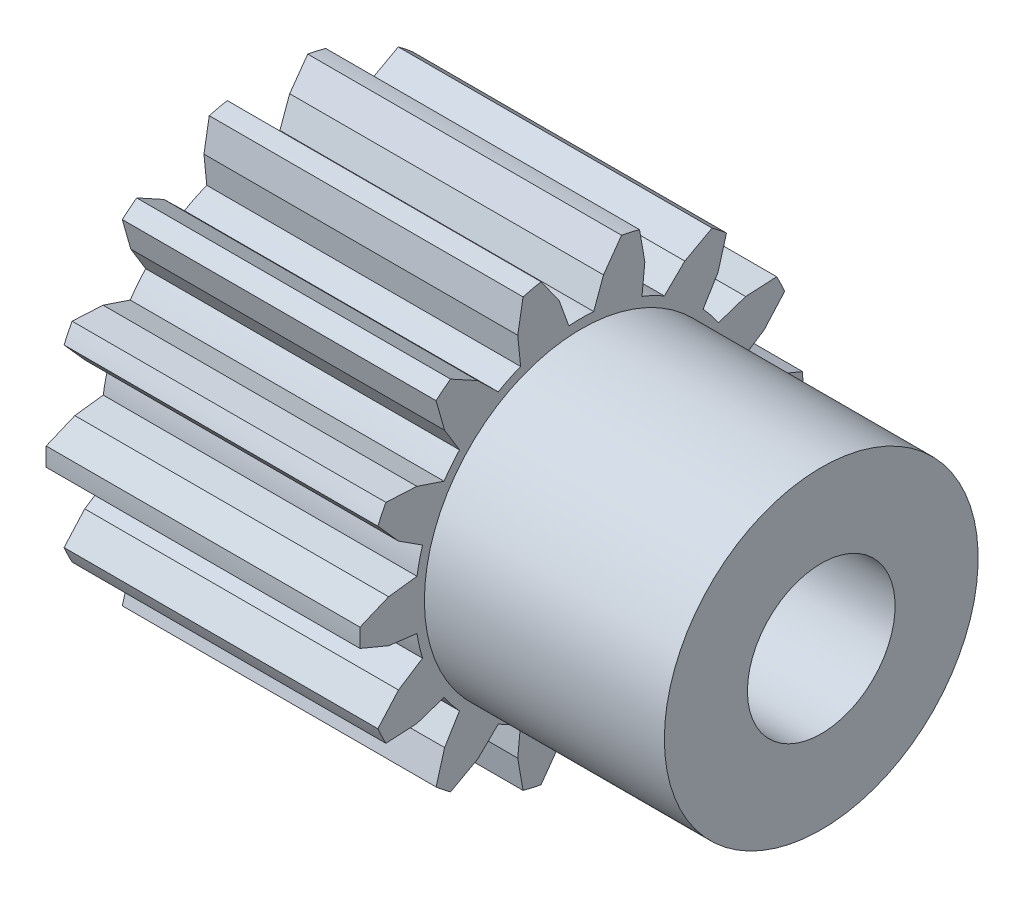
ISO-10303-21;
HEADER;
FILE_DESCRIPTION(('STEP AP214'),'2;1');
FILE_NAME('part.step','',(''),(''),'','','');
FILE_SCHEMA(('AUTOMOTIVE_DESIGN { 1 0 10303 214 1 1 1 1 }'));
ENDSEC;
DATA;
#1=APPLICATION_CONTEXT('core data for automotive mechanical design processes');
#2=APPLICATION_PROTOCOL_DEFINITION('international standard','automotive_design',2000,#1);
#3=PRODUCT_CONTEXT('',#1,'mechanical');
#4=PRODUCT('Part','Part','',(#3));
#5=PRODUCT_RELATED_PRODUCT_CATEGORY('part','',(#4));
#6=PRODUCT_DEFINITION_FORMATION('','',#4);
#7=PRODUCT_DEFINITION_CONTEXT('part definition',#1,'design');
#8=PRODUCT_DEFINITION('design','',#6,#7);
#9=PRODUCT_DEFINITION_SHAPE('','',#8);
#10=(LENGTH_UNIT() NAMED_UNIT(*) SI_UNIT(.MILLI.,.METRE.));
#11=(NAMED_UNIT(*) PLANE_ANGLE_UNIT() SI_UNIT($,.RADIAN.));
#12=(NAMED_UNIT(*) SI_UNIT($,.STERADIAN.) SOLID_ANGLE_UNIT());
#13=UNCERTAINTY_MEASURE_WITH_UNIT(LENGTH_MEASURE(1.E-05),#10,'distance_accuracy_value','');
#14=(GEOMETRIC_REPRESENTATION_CONTEXT(3) GLOBAL_UNCERTAINTY_ASSIGNED_CONTEXT((#13)) GLOBAL_UNIT_ASSIGNED_CONTEXT((#10,
#11,#12)) REPRESENTATION_CONTEXT('',''));
#15=CARTESIAN_POINT('',(0.,0.,0.));
#16=DIRECTION('',(0.,0.,1.));
#17=DIRECTION('',(1.,0.,0.));
#18=AXIS2_PLACEMENT_3D('',#15,#16,#17);
#19=CARTESIAN_POINT('',(8.5,-0.5,-11.9895788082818));
#20=DIRECTION('',(0.,-0.922699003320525,-0.385521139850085));
#21=DIRECTION('',(0.,-0.385521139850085,0.922699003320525));
#22=AXIS2_PLACEMENT_3D('',#19,#20,#21);
#23=PLANE('',#22);
#24=DIRECTION('',(0.,-0.385521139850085,0.922699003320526));
#25=VECTOR('',#24,1.);
#26=CARTESIAN_POINT('',(8.5,-0.82435340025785,-11.2132775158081));
#27=LINE('',#26,#25);
#28=CARTESIAN_POINT('',(8.5,-0.5,-11.9895788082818));
#29=VERTEX_POINT('',#28);
#30=CARTESIAN_POINT('',(8.5,-1.1487068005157,-10.4369762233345));
#31=VERTEX_POINT('',#30);
#32=EDGE_CURVE('E552',#29,#31,#27,.T.);
#33=ORIENTED_EDGE('',*,*,#32,.T.);
#34=DIRECTION('',(-1.,0.,0.));
#35=VECTOR('',#34,1.);
#36=CARTESIAN_POINT('',(8.5,-1.1487068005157,-10.4369762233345));
#37=LINE('',#36,#35);
#38=CARTESIAN_POINT('',(-8.5,-1.1487068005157,-10.4369762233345));
#39=VERTEX_POINT('',#38);
#40=EDGE_CURVE('E550',#39,#31,#37,.F.);
#41=ORIENTED_EDGE('',*,*,#40,.F.);
#42=DIRECTION('',(0.,0.385521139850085,-0.922699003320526));
#43=VECTOR('',#42,1.);
#44=CARTESIAN_POINT('',(-8.5,-0.82435340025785,-11.2132775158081));
#45=LINE('',#44,#43);
#46=CARTESIAN_POINT('',(-8.5,-0.5,-11.9895788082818));
#47=VERTEX_POINT('',#46);
#48=EDGE_CURVE('E535',#39,#47,#45,.T.);
#49=ORIENTED_EDGE('',*,*,#48,.T.);
#50=DIRECTION('',(-1.,0.,0.));
#51=VECTOR('',#50,1.);
#52=CARTESIAN_POINT('',(0.,-0.5,-11.9895788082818));
#53=LINE('',#52,#51);
#54=EDGE_CURVE('E547',#29,#47,#53,.T.);
#55=ORIENTED_EDGE('',*,*,#54,.F.);
#56=EDGE_LOOP('',(#33,#41,#49,#55));
#57=FACE_BOUND('',#56,.T.);
#58=ADVANCED_FACE('F15',(#57),#23,.T.);
#59=CARTESIAN_POINT('',(8.5,-1.1487068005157,-10.4369762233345));
#60=DIRECTION('',(0.,-0.992239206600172,-0.124343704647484));
#61=DIRECTION('',(0.,-0.124343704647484,0.992239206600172));
#62=AXIS2_PLACEMENT_3D('',#59,#60,#61);
#63=PLANE('',#62);
#64=DIRECTION('',(0.,-0.124343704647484,0.992239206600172));
#65=VECTOR('',#64,1.);
#66=CARTESIAN_POINT('',(8.5,-1.24504359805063,-9.66822682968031));
#67=LINE('',#66,#65);
#68=CARTESIAN_POINT('',(8.5,-1.34138039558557,-8.89947743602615));
#69=VERTEX_POINT('',#68);
#70=EDGE_CURVE('E544',#31,#69,#67,.T.);
#71=ORIENTED_EDGE('',*,*,#70,.T.);
#72=DIRECTION('',(1.,0.,0.));
#73=VECTOR('',#72,1.);
#74=CARTESIAN_POINT('',(0.,-1.34138039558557,-8.89947743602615));
#75=LINE('',#74,#73);
#76=CARTESIAN_POINT('',(-8.5,-1.34138039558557,-8.89947743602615));
#77=VERTEX_POINT('',#76);
#78=EDGE_CURVE('E558',#77,#69,#75,.T.);
#79=ORIENTED_EDGE('',*,*,#78,.F.);
#80=DIRECTION('',(0.,0.124343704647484,-0.992239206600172));
#81=VECTOR('',#80,1.);
#82=CARTESIAN_POINT('',(-8.5,-1.24504359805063,-9.66822682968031));
#83=LINE('',#82,#81);
#84=EDGE_CURVE('E565',#77,#39,#83,.T.);
#85=ORIENTED_EDGE('',*,*,#84,.T.);
#86=ORIENTED_EDGE('',*,*,#40,.T.);
#87=EDGE_LOOP('',(#71,#79,#85,#86));
#88=FACE_BOUND('',#87,.T.);
#89=ADVANCED_FACE('F714',(#88),#63,.T.);
#90=CARTESIAN_POINT('',(-8.5,0.,-1.20996962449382E-12));
#91=DIRECTION('',(-1.,0.,0.));
#92=DIRECTION('',(0.,0.,1.));
#93=AXIS2_PLACEMENT_3D('',#90,#91,#92);
#94=CYLINDRICAL_SURFACE('',#93,11.9999999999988);
#95=CARTESIAN_POINT('',(8.5,0.,-1.20996962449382E-12));
#96=DIRECTION('',(-1.,0.,0.));
#97=DIRECTION('',(0.,0.,1.));
#98=AXIS2_PLACEMENT_3D('',#95,#96,#97);
#99=CIRCLE('',#98,11.9999999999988);
#100=CARTESIAN_POINT('',(8.5,0.499999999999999,-11.9895788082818));
#101=VERTEX_POINT('',#100);
#102=EDGE_CURVE('E543',#101,#29,#99,.T.);
#103=ORIENTED_EDGE('',*,*,#102,.T.);
#104=ORIENTED_EDGE('',*,*,#54,.T.);
#105=CARTESIAN_POINT('',(-8.5,0.,-1.20996962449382E-12));
#106=DIRECTION('',(-1.,0.,0.));
#107=DIRECTION('',(0.,0.,1.));
#108=AXIS2_PLACEMENT_3D('',#105,#106,#107);
#109=CIRCLE('',#108,11.9999999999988);
#110=CARTESIAN_POINT('',(-8.5,0.499999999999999,-11.9895788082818));
#111=VERTEX_POINT('',#110);
#112=EDGE_CURVE('E18',#47,#111,#109,.F.);
#113=ORIENTED_EDGE('',*,*,#112,.T.);
#114=DIRECTION('',(-1.,0.,0.));
#115=VECTOR('',#114,1.);
#116=CARTESIAN_POINT('',(8.5,0.5,-11.9895788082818));
#117=LINE('',#116,#115);
#118=EDGE_CURVE('E709',#101,#111,#117,.T.);
#119=ORIENTED_EDGE('',*,*,#118,.F.);
#120=EDGE_LOOP('',(#103,#104,#113,#119));
#121=FACE_BOUND('',#120,.T.);
#122=ADVANCED_FACE('F554',(#121),#94,.T.);
#123=CARTESIAN_POINT('',(-8.5,0.,-3.99853761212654E-13));
#124=DIRECTION('',(-1.,0.,0.));
#125=DIRECTION('',(0.,0.,1.));
#126=AXIS2_PLACEMENT_3D('',#123,#124,#125);
#127=CYLINDRICAL_SURFACE('',#126,8.99999999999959);
#128=CARTESIAN_POINT('',(8.5,0.,-3.99853761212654E-13));
#129=DIRECTION('',(-1.,0.,0.));
#130=DIRECTION('',(0.,0.,1.));
#131=AXIS2_PLACEMENT_3D('',#128,#129,#130);
#132=CIRCLE('',#131,8.99999999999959);
#133=CARTESIAN_POINT('',(8.5,-2.65279656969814,-8.60015525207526));
#134=VERTEX_POINT('',#133);
#135=EDGE_CURVE('E697',#69,#134,#132,.T.);
#136=ORIENTED_EDGE('',*,*,#135,.T.);
#137=DIRECTION('',(-1.,0.,0.));
#138=VECTOR('',#137,1.);
#139=CARTESIAN_POINT('',(8.5,-2.65279656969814,-8.60015525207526));
#140=LINE('',#139,#138);
#141=CARTESIAN_POINT('',(-8.5,-2.65279656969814,-8.60015525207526));
#142=VERTEX_POINT('',#141);
#143=EDGE_CURVE('E719',#142,#134,#140,.F.);
#144=ORIENTED_EDGE('',*,*,#143,.F.);
#145=CARTESIAN_POINT('',(-8.5,0.,-3.99853761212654E-13));
#146=DIRECTION('',(-1.,0.,0.));
#147=DIRECTION('',(0.,0.,1.));
#148=AXIS2_PLACEMENT_3D('',#145,#146,#147);
#149=CIRCLE('',#148,8.99999999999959);
#150=EDGE_CURVE('E555',#142,#77,#149,.F.);
#151=ORIENTED_EDGE('',*,*,#150,.T.);
#152=ORIENTED_EDGE('',*,*,#78,.T.);
#153=EDGE_LOOP('',(#136,#144,#151,#152));
#154=FACE_BOUND('',#153,.T.);
#155=ADVANCED_FACE('F720',(#154),#127,.T.);
#156=CARTESIAN_POINT('',(8.5,1.1487068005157,-10.4369762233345));
#157=DIRECTION('',(0.,0.922699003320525,-0.385521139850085));
#158=DIRECTION('',(0.,-0.385521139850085,-0.922699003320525));
#159=AXIS2_PLACEMENT_3D('',#156,#157,#158);
#160=PLANE('',#159);
#161=DIRECTION('',(0.,-0.385521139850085,-0.922699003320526));
#162=VECTOR('',#161,1.);
#163=CARTESIAN_POINT('',(8.5,0.82435340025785,-11.2132775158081));
#164=LINE('',#163,#162);
#165=CARTESIAN_POINT('',(8.5,1.14870680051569,-10.4369762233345));
#166=VERTEX_POINT('',#165);
#167=EDGE_CURVE('E703',#166,#101,#164,.T.);
#168=ORIENTED_EDGE('',*,*,#167,.T.);
#169=ORIENTED_EDGE('',*,*,#118,.T.);
#170=DIRECTION('',(0.,0.385521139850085,0.922699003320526));
#171=VECTOR('',#170,1.);
#172=CARTESIAN_POINT('',(-8.5,0.82435340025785,-11.2132775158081));
#173=LINE('',#172,#171);
#174=CARTESIAN_POINT('',(-8.5,1.14870680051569,-10.4369762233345));
#175=VERTEX_POINT('',#174);
#176=EDGE_CURVE('E538',#111,#175,#173,.T.);
#177=ORIENTED_EDGE('',*,*,#176,.T.);
#178=DIRECTION('',(-1.,0.,0.));
#179=VECTOR('',#178,1.);
#180=CARTESIAN_POINT('',(8.5,1.14870680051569,-10.4369762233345));
#181=LINE('',#180,#179);
#182=EDGE_CURVE('E734',#166,#175,#181,.T.);
#183=ORIENTED_EDGE('',*,*,#182,.F.);
#184=EDGE_LOOP('',(#168,#169,#177,#183));
#185=FACE_BOUND('',#184,.T.);
#186=ADVANCED_FACE('F748',(#185),#160,.T.);
#187=CARTESIAN_POINT('',(8.5,-2.65279656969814,-8.60015525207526));
#188=DIRECTION('',(0.,0.840025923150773,-0.542546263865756));
#189=DIRECTION('',(0.,-0.542546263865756,-0.840025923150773));
#190=AXIS2_PLACEMENT_3D('',#187,#188,#189);
#191=PLANE('',#190);
#192=DIRECTION('',(0.,-0.542546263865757,-0.840025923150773));
#193=VECTOR('',#192,1.);
#194=CARTESIAN_POINT('',(8.5,-3.07314088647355,-9.25097555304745));
#195=LINE('',#194,#193);
#196=CARTESIAN_POINT('',(8.5,-3.49348520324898,-9.90179585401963));
#197=VERTEX_POINT('',#196);
#198=EDGE_CURVE('E722',#134,#197,#195,.T.);
#199=ORIENTED_EDGE('',*,*,#198,.T.);
#200=DIRECTION('',(-1.,0.,0.));
#201=VECTOR('',#200,1.);
#202=CARTESIAN_POINT('',(8.5,-3.49348520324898,-9.90179585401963));
#203=LINE('',#202,#201);
#204=CARTESIAN_POINT('',(-8.5,-3.49348520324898,-9.90179585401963));
#205=VERTEX_POINT('',#204);
#206=EDGE_CURVE('E725',#205,#197,#203,.F.);
#207=ORIENTED_EDGE('',*,*,#206,.F.);
#208=DIRECTION('',(0.,0.542546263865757,0.840025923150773));
#209=VECTOR('',#208,1.);
#210=CARTESIAN_POINT('',(-8.5,-3.07314088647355,-9.25097555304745));
#211=LINE('',#210,#209);
#212=EDGE_CURVE('E716',#205,#142,#211,.T.);
#213=ORIENTED_EDGE('',*,*,#212,.T.);
#214=ORIENTED_EDGE('',*,*,#143,.T.);
#215=EDGE_LOOP('',(#199,#207,#213,#214));
#216=FACE_BOUND('',#215,.T.);
#217=ADVANCED_FACE('F723',(#216),#191,.T.);
#218=CARTESIAN_POINT('',(8.5,1.34138039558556,-8.89947743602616));
#219=DIRECTION('',(0.,0.992239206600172,-0.124343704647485));
#220=DIRECTION('',(0.,-0.124343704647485,-0.992239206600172));
#221=AXIS2_PLACEMENT_3D('',#218,#219,#220);
#222=PLANE('',#221);
#223=DIRECTION('',(0.,-0.124343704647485,-0.992239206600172));
#224=VECTOR('',#223,1.);
#225=CARTESIAN_POINT('',(8.5,1.24504359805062,-9.66822682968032));
#226=LINE('',#225,#224);
#227=CARTESIAN_POINT('',(8.5,1.34138039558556,-8.89947743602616));
#228=VERTEX_POINT('',#227);
#229=EDGE_CURVE('E738',#228,#166,#226,.T.);
#230=ORIENTED_EDGE('',*,*,#229,.T.);
#231=ORIENTED_EDGE('',*,*,#182,.T.);
#232=DIRECTION('',(0.,0.124343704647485,0.992239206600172));
#233=VECTOR('',#232,1.);
#234=CARTESIAN_POINT('',(-8.5,1.24504359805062,-9.66822682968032));
#235=LINE('',#234,#233);
#236=CARTESIAN_POINT('',(-8.5,1.34138039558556,-8.89947743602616));
#237=VERTEX_POINT('',#236);
#238=EDGE_CURVE('E755',#175,#237,#235,.T.);
#239=ORIENTED_EDGE('',*,*,#238,.T.);
#240=DIRECTION('',(-1.,0.,0.));
#241=VECTOR('',#240,1.);
#242=CARTESIAN_POINT('',(0.,1.34138039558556,-8.89947743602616));
#243=LINE('',#242,#241);
#244=EDGE_CURVE('E692',#228,#237,#243,.T.);
#245=ORIENTED_EDGE('',*,*,#244,.F.);
#246=EDGE_LOOP('',(#230,#231,#239,#245));
#247=FACE_BOUND('',#246,.T.);
#248=ADVANCED_FACE('F2327',(#247),#222,.T.);
#249=CARTESIAN_POINT('',(8.5,-3.49348520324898,-9.90179585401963));
#250=DIRECTION('',(0.,0.664051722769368,-0.747686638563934));
#251=DIRECTION('',(0.,-0.747686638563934,-0.664051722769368));
#252=AXIS2_PLACEMENT_3D('',#249,#250,#251);
#253=PLANE('',#252);
#254=DIRECTION('',(0.,-0.747686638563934,-0.664051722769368));
#255=VECTOR('',#254,1.);
#256=CARTESIAN_POINT('',(8.5,-4.12254202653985,-10.4604874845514));
#257=LINE('',#256,#255);
#258=CARTESIAN_POINT('',(8.5,-4.75159884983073,-11.0191791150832));
#259=VERTEX_POINT('',#258);
#260=EDGE_CURVE('E696',#197,#259,#257,.T.);
#261=ORIENTED_EDGE('',*,*,#260,.T.);
#262=DIRECTION('',(1.,0.,0.));
#263=VECTOR('',#262,1.);
#264=CARTESIAN_POINT('',(0.,-4.75159884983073,-11.0191791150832));
#265=LINE('',#264,#263);
#266=CARTESIAN_POINT('',(-8.5,-4.75159884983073,-11.0191791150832));
#267=VERTEX_POINT('',#266);
#268=EDGE_CURVE('E778',#267,#259,#265,.T.);
#269=ORIENTED_EDGE('',*,*,#268,.F.);
#270=DIRECTION('',(0.,0.747686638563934,0.664051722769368));
#271=VECTOR('',#270,1.);
#272=CARTESIAN_POINT('',(-8.5,-4.12254202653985,-10.4604874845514));
#273=LINE('',#272,#271);
#274=EDGE_CURVE('E737',#267,#205,#273,.T.);
#275=ORIENTED_EDGE('',*,*,#274,.T.);
#276=ORIENTED_EDGE('',*,*,#206,.T.);
#277=EDGE_LOOP('',(#261,#269,#275,#276));
#278=FACE_BOUND('',#277,.T.);
#279=ADVANCED_FACE('F2319',(#278),#253,.T.);
#280=CARTESIAN_POINT('',(-8.5,0.,0.));
#281=DIRECTION('',(-1.,0.,0.));
#282=DIRECTION('',(0.,0.,1.));
#283=AXIS2_PLACEMENT_3D('',#280,#281,#282);
#284=CYLINDRICAL_SURFACE('',#283,8.99999999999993);
#285=CARTESIAN_POINT('',(8.5,0.,0.));
#286=DIRECTION('',(-1.,0.,0.));
#287=DIRECTION('',(0.,0.,1.));
#288=AXIS2_PLACEMENT_3D('',#285,#286,#287);
#289=CIRCLE('',#288,8.99999999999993);
#290=CARTESIAN_POINT('',(8.5,2.65279656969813,-8.60015525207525));
#291=VERTEX_POINT('',#290);
#292=EDGE_CURVE('E689',#291,#228,#289,.T.);
#293=ORIENTED_EDGE('',*,*,#292,.T.);
#294=ORIENTED_EDGE('',*,*,#244,.T.);
#295=CARTESIAN_POINT('',(-8.5,0.,0.));
#296=DIRECTION('',(-1.,0.,0.));
#297=DIRECTION('',(0.,0.,1.));
#298=AXIS2_PLACEMENT_3D('',#295,#296,#297);
#299=CIRCLE('',#298,8.99999999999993);
#300=CARTESIAN_POINT('',(-8.5,2.65279656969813,-8.60015525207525));
#301=VERTEX_POINT('',#300);
#302=EDGE_CURVE('E693',#237,#301,#299,.F.);
#303=ORIENTED_EDGE('',*,*,#302,.T.);
#304=DIRECTION('',(-1.,0.,0.));
#305=VECTOR('',#304,1.);
#306=CARTESIAN_POINT('',(8.5,2.65279656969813,-8.60015525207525));
#307=LINE('',#306,#305);
#308=EDGE_CURVE('E782',#291,#301,#307,.T.);
#309=ORIENTED_EDGE('',*,*,#308,.F.);
#310=EDGE_LOOP('',(#293,#294,#303,#309));
#311=FACE_BOUND('',#310,.T.);
#312=ADVANCED_FACE('F2311',(#311),#284,.T.);
#313=CARTESIAN_POINT('',(-8.5,0.,5.20417042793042E-13));
#314=DIRECTION('',(-1.,0.,0.));
#315=DIRECTION('',(0.,0.,1.));
#316=AXIS2_PLACEMENT_3D('',#313,#314,#315);
#317=CYLINDRICAL_SURFACE('',#316,12.0000000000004);
#318=CARTESIAN_POINT('',(8.5,0.,5.2E-13));
#319=DIRECTION('',(-1.,0.,0.));
#320=DIRECTION('',(0.,-0.471047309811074,-0.882107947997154));
#321=AXIS2_PLACEMENT_3D('',#318,#319,#320);
#322=CIRCLE('',#321,12.0000000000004);
#323=CARTESIAN_POINT('',(8.5,-5.65256771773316,-10.5852953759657));
#324=VERTEX_POINT('',#323);
#325=EDGE_CURVE('E781',#259,#324,#322,.T.);
#326=ORIENTED_EDGE('',*,*,#325,.T.);
#327=DIRECTION('',(-1.,0.,0.));
#328=VECTOR('',#327,1.);
#329=CARTESIAN_POINT('',(8.5,-5.65256771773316,-10.5852953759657));
#330=LINE('',#329,#328);
#331=CARTESIAN_POINT('',(-8.5,-5.65256771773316,-10.5852953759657));
#332=VERTEX_POINT('',#331);
#333=EDGE_CURVE('E797',#332,#324,#330,.F.);
#334=ORIENTED_EDGE('',*,*,#333,.F.);
#335=CARTESIAN_POINT('',(-8.5,0.,5.2E-13));
#336=DIRECTION('',(-1.,0.,0.));
#337=DIRECTION('',(0.,-0.471047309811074,-0.882107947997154));
#338=AXIS2_PLACEMENT_3D('',#335,#336,#337);
#339=CIRCLE('',#338,12.0000000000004);
#340=EDGE_CURVE('E769',#332,#267,#339,.F.);
#341=ORIENTED_EDGE('',*,*,#340,.T.);
#342=ORIENTED_EDGE('',*,*,#268,.T.);
#343=EDGE_LOOP('',(#326,#334,#341,#342));
#344=FACE_BOUND('',#343,.T.);
#345=ADVANCED_FACE('F2303',(#344),#317,.T.);
#346=CARTESIAN_POINT('',(8.5,3.49348520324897,-9.90179585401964));
#347=DIRECTION('',(0.,-0.840025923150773,-0.542546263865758));
#348=DIRECTION('',(0.,-0.542546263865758,0.840025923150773));
#349=AXIS2_PLACEMENT_3D('',#346,#347,#348);
#350=PLANE('',#349);
#351=DIRECTION('',(0.,-0.542546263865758,0.840025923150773));
#352=VECTOR('',#351,1.);
#353=CARTESIAN_POINT('',(8.5,3.07314088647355,-9.25097555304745));
#354=LINE('',#353,#352);
#355=CARTESIAN_POINT('',(8.5,3.49348520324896,-9.90179585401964));
#356=VERTEX_POINT('',#355);
#357=EDGE_CURVE('E786',#356,#291,#354,.T.);
#358=ORIENTED_EDGE('',*,*,#357,.T.);
#359=ORIENTED_EDGE('',*,*,#308,.T.);
#360=DIRECTION('',(0.,0.542546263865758,-0.840025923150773));
#361=VECTOR('',#360,1.);
#362=CARTESIAN_POINT('',(-8.5,3.07314088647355,-9.25097555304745));
#363=LINE('',#362,#361);
#364=CARTESIAN_POINT('',(-8.5,3.49348520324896,-9.90179585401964));
#365=VERTEX_POINT('',#364);
#366=EDGE_CURVE('E794',#301,#365,#363,.T.);
#367=ORIENTED_EDGE('',*,*,#366,.T.);
#368=DIRECTION('',(-1.,0.,0.));
#369=VECTOR('',#368,1.);
#370=CARTESIAN_POINT('',(8.5,3.49348520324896,-9.90179585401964));
#371=LINE('',#370,#369);
#372=EDGE_CURVE('E811',#356,#365,#371,.T.);
#373=ORIENTED_EDGE('',*,*,#372,.F.);
#374=EDGE_LOOP('',(#358,#359,#367,#373));
#375=FACE_BOUND('',#374,.T.);
#376=ADVANCED_FACE('F2295',(#375),#350,.T.);
#377=CARTESIAN_POINT('',(8.5,-5.65256771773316,-10.5852953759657));
#378=DIRECTION('',(0.,-0.998594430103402,0.0530015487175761));
#379=DIRECTION('',(0.,0.0530015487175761,0.998594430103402));
#380=AXIS2_PLACEMENT_3D('',#377,#378,#379);
#381=PLANE('',#380);
#382=DIRECTION('',(0.,0.0530015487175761,0.998594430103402));
#383=VECTOR('',#382,1.);
#384=CARTESIAN_POINT('',(8.5,-5.60797552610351,-9.74514041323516));
#385=LINE('',#384,#383);
#386=CARTESIAN_POINT('',(8.5,-5.56338333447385,-8.9049854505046));
#387=VERTEX_POINT('',#386);
#388=EDGE_CURVE('E800',#324,#387,#385,.T.);
#389=ORIENTED_EDGE('',*,*,#388,.T.);
#390=DIRECTION('',(-1.,0.,0.));
#391=VECTOR('',#390,1.);
#392=CARTESIAN_POINT('',(8.5,-5.56338333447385,-8.9049854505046));
#393=LINE('',#392,#391);
#394=CARTESIAN_POINT('',(-8.5,-5.56338333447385,-8.9049854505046));
#395=VERTEX_POINT('',#394);
#396=EDGE_CURVE('E826',#395,#387,#393,.F.);
#397=ORIENTED_EDGE('',*,*,#396,.F.);
#398=DIRECTION('',(0.,-0.0530015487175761,-0.998594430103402));
#399=VECTOR('',#398,1.);
#400=CARTESIAN_POINT('',(-8.5,-5.60797552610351,-9.74514041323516));
#401=LINE('',#400,#399);
#402=EDGE_CURVE('E785',#395,#332,#401,.T.);
#403=ORIENTED_EDGE('',*,*,#402,.T.);
#404=ORIENTED_EDGE('',*,*,#333,.T.);
#405=EDGE_LOOP('',(#389,#397,#403,#404));
#406=FACE_BOUND('',#405,.T.);
#407=ADVANCED_FACE('F2287',(#406),#381,.T.);
#408=CARTESIAN_POINT('',(8.5,4.75159884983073,-11.0191791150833));
#409=DIRECTION('',(0.,-0.664051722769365,-0.747686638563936));
#410=DIRECTION('',(0.,-0.747686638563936,0.664051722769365));
#411=AXIS2_PLACEMENT_3D('',#408,#409,#410);
#412=PLANE('',#411);
#413=DIRECTION('',(0.,-0.747686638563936,0.664051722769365));
#414=VECTOR('',#413,1.);
#415=CARTESIAN_POINT('',(8.5,4.12254202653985,-10.4604874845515));
#416=LINE('',#415,#414);
#417=CARTESIAN_POINT('',(8.5,4.75159884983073,-11.0191791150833));
#418=VERTEX_POINT('',#417);
#419=EDGE_CURVE('E815',#418,#356,#416,.T.);
#420=ORIENTED_EDGE('',*,*,#419,.T.);
#421=ORIENTED_EDGE('',*,*,#372,.T.);
#422=DIRECTION('',(0.,0.747686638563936,-0.664051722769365));
#423=VECTOR('',#422,1.);
#424=CARTESIAN_POINT('',(-8.5,4.12254202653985,-10.4604874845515));
#425=LINE('',#424,#423);
#426=CARTESIAN_POINT('',(-8.5,4.75159884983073,-11.0191791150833));
#427=VERTEX_POINT('',#426);
#428=EDGE_CURVE('E823',#365,#427,#425,.T.);
#429=ORIENTED_EDGE('',*,*,#428,.T.);
#430=DIRECTION('',(-1.,0.,0.));
#431=VECTOR('',#430,1.);
#432=CARTESIAN_POINT('',(0.,4.75159884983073,-11.0191791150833));
#433=LINE('',#432,#431);
#434=EDGE_CURVE('E688',#418,#427,#433,.T.);
#435=ORIENTED_EDGE('',*,*,#434,.F.);
#436=EDGE_LOOP('',(#420,#421,#429,#435));
#437=FACE_BOUND('',#436,.T.);
#438=ADVANCED_FACE('F2279',(#437),#412,.T.);
#439=CARTESIAN_POINT('',(8.5,-5.56338333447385,-8.9049854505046));
#440=DIRECTION('',(0.,-0.947927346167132,0.318486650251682));
#441=DIRECTION('',(0.,0.318486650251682,0.947927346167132));
#442=AXIS2_PLACEMENT_3D('',#439,#440,#441);
#443=PLANE('',#442);
#444=DIRECTION('',(0.,0.318486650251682,0.947927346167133));
#445=VECTOR('',#444,1.);
#446=CARTESIAN_POINT('',(8.5,-5.31663192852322,-8.17056720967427));
#447=LINE('',#446,#445);
#448=CARTESIAN_POINT('',(8.5,-5.0698805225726,-7.43614896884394));
#449=VERTEX_POINT('',#448);
#450=EDGE_CURVE('E829',#387,#449,#447,.T.);
#451=ORIENTED_EDGE('',*,*,#450,.T.);
#452=DIRECTION('',(1.,0.,0.));
#453=VECTOR('',#452,1.);
#454=CARTESIAN_POINT('',(0.,-5.0698805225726,-7.43614896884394));
#455=LINE('',#454,#453);
#456=CARTESIAN_POINT('',(-8.5,-5.0698805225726,-7.43614896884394));
#457=VERTEX_POINT('',#456);
#458=EDGE_CURVE('E684',#457,#449,#455,.T.);
#459=ORIENTED_EDGE('',*,*,#458,.F.);
#460=DIRECTION('',(0.,-0.318486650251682,-0.947927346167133));
#461=VECTOR('',#460,1.);
#462=CARTESIAN_POINT('',(-8.5,-5.31663192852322,-8.17056720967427));
#463=LINE('',#462,#461);
#464=EDGE_CURVE('E814',#457,#395,#463,.T.);
#465=ORIENTED_EDGE('',*,*,#464,.T.);
#466=ORIENTED_EDGE('',*,*,#396,.T.);
#467=EDGE_LOOP('',(#451,#459,#465,#466));
#468=FACE_BOUND('',#467,.T.);
#469=ADVANCED_FACE('F2271',(#468),#443,.T.);
#470=CARTESIAN_POINT('',(-8.5,-1.20129600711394E-13,1.70002900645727E-13));
#471=DIRECTION('',(-1.,0.,0.));
#472=DIRECTION('',(0.,0.,1.));
#473=AXIS2_PLACEMENT_3D('',#470,#471,#472);
#474=CYLINDRICAL_SURFACE('',#473,12.0000000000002);
#475=CARTESIAN_POINT('',(8.5,-1.2E-13,1.7E-13));
#476=DIRECTION('',(-1.,0.,0.));
#477=DIRECTION('',(0.,0.395966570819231,-0.918264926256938));
#478=AXIS2_PLACEMENT_3D('',#475,#476,#477);
#479=CIRCLE('',#478,12.0000000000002);
#480=CARTESIAN_POINT('',(8.5,5.65256771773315,-10.5852953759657));
#481=VERTEX_POINT('',#480);
#482=EDGE_CURVE('E842',#481,#418,#479,.T.);
#483=ORIENTED_EDGE('',*,*,#482,.T.);
#484=ORIENTED_EDGE('',*,*,#434,.T.);
#485=CARTESIAN_POINT('',(-8.5,-1.2E-13,1.7E-13));
#486=DIRECTION('',(-1.,0.,0.));
#487=DIRECTION('',(0.,0.395966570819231,-0.918264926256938));
#488=AXIS2_PLACEMENT_3D('',#485,#486,#487);
#489=CIRCLE('',#488,12.0000000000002);
#490=CARTESIAN_POINT('',(-8.5,5.65256771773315,-10.5852953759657));
#491=VERTEX_POINT('',#490);
#492=EDGE_CURVE('E850',#427,#491,#489,.F.);
#493=ORIENTED_EDGE('',*,*,#492,.T.);
#494=DIRECTION('',(-1.,0.,0.));
#495=VECTOR('',#494,1.);
#496=CARTESIAN_POINT('',(8.5,5.65256771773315,-10.5852953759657));
#497=LINE('',#496,#495);
#498=EDGE_CURVE('E863',#481,#491,#497,.T.);
#499=ORIENTED_EDGE('',*,*,#498,.F.);
#500=EDGE_LOOP('',(#483,#484,#493,#499));
#501=FACE_BOUND('',#500,.T.);
#502=ADVANCED_FACE('F2263',(#501),#474,.T.);
#503=CARTESIAN_POINT('',(-8.5,-2.60208521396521E-13,-2.4980018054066E-13));
#504=DIRECTION('',(-1.,0.,0.));
#505=DIRECTION('',(0.,0.,1.));
#506=AXIS2_PLACEMENT_3D('',#503,#504,#505);
#507=CYLINDRICAL_SURFACE('',#506,8.99999999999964);
#508=CARTESIAN_POINT('',(8.5,-2.60208521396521E-13,-2.4980018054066E-13));
#509=DIRECTION('',(-1.,0.,0.));
#510=DIRECTION('',(0.,0.,1.));
#511=AXIS2_PLACEMENT_3D('',#508,#509,#510);
#512=CIRCLE('',#511,8.99999999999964);
#513=CARTESIAN_POINT('',(8.5,-6.12155463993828,-6.59746684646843));
#514=VERTEX_POINT('',#513);
#515=EDGE_CURVE('E681',#449,#514,#512,.T.);
#516=ORIENTED_EDGE('',*,*,#515,.T.);
#517=DIRECTION('',(-1.,0.,0.));
#518=VECTOR('',#517,1.);
#519=CARTESIAN_POINT('',(8.5,-6.12155463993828,-6.59746684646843));
#520=LINE('',#519,#518);
#521=CARTESIAN_POINT('',(-8.5,-6.12155463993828,-6.59746684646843));
#522=VERTEX_POINT('',#521);
#523=EDGE_CURVE('E868',#522,#514,#520,.F.);
#524=ORIENTED_EDGE('',*,*,#523,.F.);
#525=CARTESIAN_POINT('',(-8.5,-2.60208521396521E-13,-2.4980018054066E-13));
#526=DIRECTION('',(-1.,0.,0.));
#527=DIRECTION('',(0.,0.,1.));
#528=AXIS2_PLACEMENT_3D('',#525,#526,#527);
#529=CIRCLE('',#528,8.99999999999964);
#530=EDGE_CURVE('E685',#522,#457,#529,.F.);
#531=ORIENTED_EDGE('',*,*,#530,.T.);
#532=ORIENTED_EDGE('',*,*,#458,.T.);
#533=EDGE_LOOP('',(#516,#524,#531,#532));
#534=FACE_BOUND('',#533,.T.);
#535=ADVANCED_FACE('F2255',(#534),#507,.T.);
#536=CARTESIAN_POINT('',(8.5,5.56338333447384,-8.90498545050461));
#537=DIRECTION('',(0.,0.998594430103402,0.0530015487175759));
#538=DIRECTION('',(0.,0.0530015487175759,-0.998594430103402));
#539=AXIS2_PLACEMENT_3D('',#536,#537,#538);
#540=PLANE('',#539);
#541=DIRECTION('',(0.,0.0530015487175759,-0.998594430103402));
#542=VECTOR('',#541,1.);
#543=CARTESIAN_POINT('',(8.5,5.6079755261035,-9.74514041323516));
#544=LINE('',#543,#542);
#545=CARTESIAN_POINT('',(8.5,5.56338333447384,-8.90498545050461));
#546=VERTEX_POINT('',#545);
#547=EDGE_CURVE('E867',#546,#481,#544,.T.);
#548=ORIENTED_EDGE('',*,*,#547,.T.);
#549=ORIENTED_EDGE('',*,*,#498,.T.);
#550=DIRECTION('',(0.,-0.0530015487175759,0.998594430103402));
#551=VECTOR('',#550,1.);
#552=CARTESIAN_POINT('',(-8.5,5.6079755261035,-9.74514041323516));
#553=LINE('',#552,#551);
#554=CARTESIAN_POINT('',(-8.5,5.56338333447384,-8.90498545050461));
#555=VERTEX_POINT('',#554);
#556=EDGE_CURVE('E683',#491,#555,#553,.T.);
#557=ORIENTED_EDGE('',*,*,#556,.T.);
#558=DIRECTION('',(-1.,0.,0.));
#559=VECTOR('',#558,1.);
#560=CARTESIAN_POINT('',(8.5,5.56338333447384,-8.90498545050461));
#561=LINE('',#560,#559);
#562=EDGE_CURVE('E882',#546,#555,#561,.T.);
#563=ORIENTED_EDGE('',*,*,#562,.F.);
#564=EDGE_LOOP('',(#548,#549,#557,#563));
#565=FACE_BOUND('',#564,.T.);
#566=ADVANCED_FACE('F2247',(#565),#540,.T.);
#567=CARTESIAN_POINT('',(8.5,-6.12155463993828,-6.59746684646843));
#568=DIRECTION('',(0.,0.521435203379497,-0.853290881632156));
#569=DIRECTION('',(0.,-0.853290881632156,-0.521435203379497));
#570=AXIS2_PLACEMENT_3D('',#567,#568,#569);
#571=PLANE('',#570);
#572=DIRECTION('',(0.,-0.853290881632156,-0.521435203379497));
#573=VECTOR('',#572,1.);
#574=CARTESIAN_POINT('',(8.5,-6.78265212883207,-7.00145511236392));
#575=LINE('',#574,#573);
#576=CARTESIAN_POINT('',(8.5,-7.44374961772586,-7.40544337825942));
#577=VERTEX_POINT('',#576);
#578=EDGE_CURVE('E871',#514,#577,#575,.T.);
#579=ORIENTED_EDGE('',*,*,#578,.T.);
#580=DIRECTION('',(-1.,0.,0.));
#581=VECTOR('',#580,1.);
#582=CARTESIAN_POINT('',(8.5,-7.44374961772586,-7.40544337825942));
#583=LINE('',#582,#581);
#584=CARTESIAN_POINT('',(-8.5,-7.44374961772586,-7.40544337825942));
#585=VERTEX_POINT('',#584);
#586=EDGE_CURVE('E897',#585,#577,#583,.F.);
#587=ORIENTED_EDGE('',*,*,#586,.F.);
#588=DIRECTION('',(0.,0.853290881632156,0.521435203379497));
#589=VECTOR('',#588,1.);
#590=CARTESIAN_POINT('',(-8.5,-6.78265212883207,-7.00145511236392));
#591=LINE('',#590,#589);
#592=EDGE_CURVE('E866',#585,#522,#591,.T.);
#593=ORIENTED_EDGE('',*,*,#592,.T.);
#594=ORIENTED_EDGE('',*,*,#523,.T.);
#595=EDGE_LOOP('',(#579,#587,#593,#594));
#596=FACE_BOUND('',#595,.T.);
#597=ADVANCED_FACE('F2239',(#596),#571,.T.);
#598=CARTESIAN_POINT('',(8.5,5.06988052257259,-7.43614896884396));
#599=DIRECTION('',(0.,0.947927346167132,0.318486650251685));
#600=DIRECTION('',(0.,0.318486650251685,-0.947927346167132));
#601=AXIS2_PLACEMENT_3D('',#598,#599,#600);
#602=PLANE('',#601);
#603=DIRECTION('',(0.,0.318486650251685,-0.947927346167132));
#604=VECTOR('',#603,1.);
#605=CARTESIAN_POINT('',(8.5,5.31663192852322,-8.17056720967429));
#606=LINE('',#605,#604);
#607=CARTESIAN_POINT('',(8.5,5.06988052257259,-7.43614896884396));
#608=VERTEX_POINT('',#607);
#609=EDGE_CURVE('E886',#608,#546,#606,.T.);
#610=ORIENTED_EDGE('',*,*,#609,.T.);
#611=ORIENTED_EDGE('',*,*,#562,.T.);
#612=DIRECTION('',(0.,-0.318486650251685,0.947927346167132));
#613=VECTOR('',#612,1.);
#614=CARTESIAN_POINT('',(-8.5,5.31663192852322,-8.17056720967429));
#615=LINE('',#614,#613);
#616=CARTESIAN_POINT('',(-8.5,5.06988052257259,-7.43614896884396));
#617=VERTEX_POINT('',#616);
#618=EDGE_CURVE('E894',#555,#617,#615,.T.);
#619=ORIENTED_EDGE('',*,*,#618,.T.);
#620=DIRECTION('',(-1.,0.,0.));
#621=VECTOR('',#620,1.);
#622=CARTESIAN_POINT('',(0.,5.06988052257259,-7.43614896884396));
#623=LINE('',#622,#621);
#624=EDGE_CURVE('E676',#608,#617,#623,.T.);
#625=ORIENTED_EDGE('',*,*,#624,.F.);
#626=EDGE_LOOP('',(#610,#611,#619,#625));
#627=FACE_BOUND('',#626,.T.);
#628=ADVANCED_FACE('F2231',(#627),#602,.T.);
#629=CARTESIAN_POINT('',(8.5,-7.44374961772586,-7.40544337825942));
#630=DIRECTION('',(0.,0.273880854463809,-0.961763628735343));
#631=DIRECTION('',(0.,-0.961763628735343,-0.273880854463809));
#632=AXIS2_PLACEMENT_3D('',#629,#630,#631);
#633=PLANE('',#632);
#634=DIRECTION('',(0.,-0.961763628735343,-0.273880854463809));
#635=VECTOR('',#634,1.);
#636=CARTESIAN_POINT('',(8.5,-8.25291744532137,-7.63586961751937));
#637=LINE('',#636,#635);
#638=CARTESIAN_POINT('',(8.5,-9.06208527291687,-7.86629585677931));
#639=VERTEX_POINT('',#638);
#640=EDGE_CURVE('E680',#577,#639,#637,.T.);
#641=ORIENTED_EDGE('',*,*,#640,.T.);
#642=DIRECTION('',(1.,0.,0.));
#643=VECTOR('',#642,1.);
#644=CARTESIAN_POINT('',(0.,-9.06208527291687,-7.86629585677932));
#645=LINE('',#644,#643);
#646=CARTESIAN_POINT('',(-8.5,-9.06208527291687,-7.86629585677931));
#647=VERTEX_POINT('',#646);
#648=EDGE_CURVE('E920',#647,#639,#645,.T.);
#649=ORIENTED_EDGE('',*,*,#648,.F.);
#650=DIRECTION('',(0.,0.961763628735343,0.273880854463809));
#651=VECTOR('',#650,1.);
#652=CARTESIAN_POINT('',(-8.5,-8.25291744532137,-7.63586961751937));
#653=LINE('',#652,#651);
#654=EDGE_CURVE('E885',#647,#585,#653,.T.);
#655=ORIENTED_EDGE('',*,*,#654,.T.);
#656=ORIENTED_EDGE('',*,*,#586,.T.);
#657=EDGE_LOOP('',(#641,#649,#655,#656));
#658=FACE_BOUND('',#657,.T.);
#659=ADVANCED_FACE('F2223',(#658),#633,.T.);
#660=CARTESIAN_POINT('',(-8.5,3.69929781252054E-13,-4.90059381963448E-13));
#661=DIRECTION('',(-1.,0.,0.));
#662=DIRECTION('',(0.,0.,1.));
#663=AXIS2_PLACEMENT_3D('',#660,#661,#662);
#664=CYLINDRICAL_SURFACE('',#663,8.99999999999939);
#665=CARTESIAN_POINT('',(8.5,3.69929781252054E-13,-4.90059381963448E-13));
#666=DIRECTION('',(-1.,0.,0.));
#667=DIRECTION('',(0.,0.,1.));
#668=AXIS2_PLACEMENT_3D('',#665,#666,#667);
#669=CIRCLE('',#668,8.99999999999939);
#670=CARTESIAN_POINT('',(8.5,6.12155463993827,-6.59746684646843));
#671=VERTEX_POINT('',#670);
#672=EDGE_CURVE('E673',#671,#608,#669,.T.);
#673=ORIENTED_EDGE('',*,*,#672,.T.);
#674=ORIENTED_EDGE('',*,*,#624,.T.);
#675=CARTESIAN_POINT('',(-8.5,3.69929781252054E-13,-4.90059381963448E-13));
#676=DIRECTION('',(-1.,0.,0.));
#677=DIRECTION('',(0.,0.,1.));
#678=AXIS2_PLACEMENT_3D('',#675,#676,#677);
#679=CIRCLE('',#678,8.99999999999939);
#680=CARTESIAN_POINT('',(-8.5,6.12155463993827,-6.59746684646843));
#681=VERTEX_POINT('',#680);
#682=EDGE_CURVE('E677',#617,#681,#679,.F.);
#683=ORIENTED_EDGE('',*,*,#682,.T.);
#684=DIRECTION('',(-1.,0.,0.));
#685=VECTOR('',#684,1.);
#686=CARTESIAN_POINT('',(8.5,6.12155463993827,-6.59746684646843));
#687=LINE('',#686,#685);
#688=EDGE_CURVE('E924',#671,#681,#687,.T.);
#689=ORIENTED_EDGE('',*,*,#688,.F.);
#690=EDGE_LOOP('',(#673,#674,#683,#689));
#691=FACE_BOUND('',#690,.T.);
#692=ADVANCED_FACE('F2215',(#691),#664,.T.);
#693=CARTESIAN_POINT('',(-8.5,3.70363462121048E-13,1.79977560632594E-13));
#694=DIRECTION('',(-1.,0.,0.));
#695=DIRECTION('',(0.,0.,1.));
#696=AXIS2_PLACEMENT_3D('',#693,#694,#695);
#697=CYLINDRICAL_SURFACE('',#696,12.0000000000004);
#698=CARTESIAN_POINT('',(8.5,3.7E-13,1.8E-13));
#699=DIRECTION('',(-1.,0.,0.));
#700=DIRECTION('',(0.,-0.807131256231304,-0.590372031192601));
#701=AXIS2_PLACEMENT_3D('',#698,#699,#700);
#702=CIRCLE('',#701,12.0000000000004);
#703=CARTESIAN_POINT('',(8.5,-9.6855750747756,-7.08446437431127));
#704=VERTEX_POINT('',#703);
#705=EDGE_CURVE('E923',#639,#704,#702,.T.);
#706=ORIENTED_EDGE('',*,*,#705,.T.);
#707=DIRECTION('',(-1.,0.,0.));
#708=VECTOR('',#707,1.);
#709=CARTESIAN_POINT('',(8.5,-9.6855750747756,-7.08446437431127));
#710=LINE('',#709,#708);
#711=CARTESIAN_POINT('',(-8.5,-9.6855750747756,-7.08446437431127));
#712=VERTEX_POINT('',#711);
#713=EDGE_CURVE('E939',#712,#704,#710,.F.);
#714=ORIENTED_EDGE('',*,*,#713,.F.);
#715=CARTESIAN_POINT('',(-8.5,3.7E-13,1.8E-13));
#716=DIRECTION('',(-1.,0.,0.));
#717=DIRECTION('',(0.,-0.807131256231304,-0.590372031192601));
#718=AXIS2_PLACEMENT_3D('',#715,#716,#717);
#719=CIRCLE('',#718,12.0000000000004);
#720=EDGE_CURVE('E910',#712,#647,#719,.F.);
#721=ORIENTED_EDGE('',*,*,#720,.T.);
#722=ORIENTED_EDGE('',*,*,#648,.T.);
#723=EDGE_LOOP('',(#706,#714,#721,#722));
#724=FACE_BOUND('',#723,.T.);
#725=ADVANCED_FACE('F2207',(#724),#697,.T.);
#726=CARTESIAN_POINT('',(8.5,7.44374961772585,-7.40544337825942));
#727=DIRECTION('',(0.,-0.521435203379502,-0.853290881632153));
#728=DIRECTION('',(0.,-0.853290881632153,0.521435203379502));
#729=AXIS2_PLACEMENT_3D('',#726,#727,#728);
#730=PLANE('',#729);
#731=DIRECTION('',(0.,-0.853290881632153,0.521435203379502));
#732=VECTOR('',#731,1.);
#733=CARTESIAN_POINT('',(8.5,6.78265212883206,-7.00145511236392));
#734=LINE('',#733,#732);
#735=CARTESIAN_POINT('',(8.5,7.44374961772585,-7.40544337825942));
#736=VERTEX_POINT('',#735);
#737=EDGE_CURVE('E928',#736,#671,#734,.T.);
#738=ORIENTED_EDGE('',*,*,#737,.T.);
#739=ORIENTED_EDGE('',*,*,#688,.T.);
#740=DIRECTION('',(0.,0.853290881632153,-0.521435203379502));
#741=VECTOR('',#740,1.);
#742=CARTESIAN_POINT('',(-8.5,6.78265212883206,-7.00145511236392));
#743=LINE('',#742,#741);
#744=CARTESIAN_POINT('',(-8.5,7.44374961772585,-7.40544337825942));
#745=VERTEX_POINT('',#744);
#746=EDGE_CURVE('E936',#681,#745,#743,.T.);
#747=ORIENTED_EDGE('',*,*,#746,.T.);
#748=DIRECTION('',(-1.,0.,0.));
#749=VECTOR('',#748,1.);
#750=CARTESIAN_POINT('',(8.5,7.44374961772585,-7.40544337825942));
#751=LINE('',#750,#749);
#752=EDGE_CURVE('E953',#736,#745,#751,.T.);
#753=ORIENTED_EDGE('',*,*,#752,.F.);
#754=EDGE_LOOP('',(#738,#739,#747,#753));
#755=FACE_BOUND('',#754,.T.);
#756=ADVANCED_FACE('F2199',(#755),#730,.T.);
#757=CARTESIAN_POINT('',(8.5,-9.6855750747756,-7.08446437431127));
#758=DIRECTION('',(0.,-0.876705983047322,0.481026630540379));
#759=DIRECTION('',(0.,0.481026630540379,0.876705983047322));
#760=AXIS2_PLACEMENT_3D('',#757,#758,#759);
#761=PLANE('',#760);
#762=DIRECTION('',(0.,0.481026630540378,0.876705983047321));
#763=VECTOR('',#762,1.);
#764=CARTESIAN_POINT('',(8.5,-9.28086932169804,-6.34685873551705));
#765=LINE('',#764,#763);
#766=CARTESIAN_POINT('',(8.5,-8.87616356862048,-5.60925309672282));
#767=VERTEX_POINT('',#766);
#768=EDGE_CURVE('E942',#704,#767,#765,.T.);
#769=ORIENTED_EDGE('',*,*,#768,.T.);
#770=DIRECTION('',(-1.,0.,0.));
#771=VECTOR('',#770,1.);
#772=CARTESIAN_POINT('',(8.5,-8.87616356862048,-5.60925309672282));
#773=LINE('',#772,#771);
#774=CARTESIAN_POINT('',(-8.5,-8.87616356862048,-5.60925309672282));
#775=VERTEX_POINT('',#774);
#776=EDGE_CURVE('E968',#775,#767,#773,.F.);
#777=ORIENTED_EDGE('',*,*,#776,.F.);
#778=DIRECTION('',(0.,-0.481026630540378,-0.876705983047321));
#779=VECTOR('',#778,1.);
#780=CARTESIAN_POINT('',(-8.5,-9.28086932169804,-6.34685873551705));
#781=LINE('',#780,#779);
#782=EDGE_CURVE('E927',#775,#712,#781,.T.);
#783=ORIENTED_EDGE('',*,*,#782,.T.);
#784=ORIENTED_EDGE('',*,*,#713,.T.);
#785=EDGE_LOOP('',(#769,#777,#783,#784));
#786=FACE_BOUND('',#785,.T.);
#787=ADVANCED_FACE('F2191',(#786),#761,.T.);
#788=CARTESIAN_POINT('',(8.5,9.06208527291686,-7.86629585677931));
#789=DIRECTION('',(0.,-0.27388085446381,-0.961763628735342));
#790=DIRECTION('',(0.,-0.961763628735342,0.27388085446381));
#791=AXIS2_PLACEMENT_3D('',#788,#789,#790);
#792=PLANE('',#791);
#793=DIRECTION('',(0.,-0.961763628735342,0.27388085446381));
#794=VECTOR('',#793,1.);
#795=CARTESIAN_POINT('',(8.5,8.25291744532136,-7.63586961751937));
#796=LINE('',#795,#794);
#797=CARTESIAN_POINT('',(8.5,9.06208527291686,-7.86629585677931));
#798=VERTEX_POINT('',#797);
#799=EDGE_CURVE('E957',#798,#736,#796,.T.);
#800=ORIENTED_EDGE('',*,*,#799,.T.);
#801=ORIENTED_EDGE('',*,*,#752,.T.);
#802=DIRECTION('',(0.,0.961763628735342,-0.27388085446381));
#803=VECTOR('',#802,1.);
#804=CARTESIAN_POINT('',(-8.5,8.25291744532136,-7.63586961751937));
#805=LINE('',#804,#803);
#806=CARTESIAN_POINT('',(-8.5,9.06208527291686,-7.86629585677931));
#807=VERTEX_POINT('',#806);
#808=EDGE_CURVE('E965',#745,#807,#805,.T.);
#809=ORIENTED_EDGE('',*,*,#808,.T.);
#810=DIRECTION('',(-1.,0.,0.));
#811=VECTOR('',#810,1.);
#812=CARTESIAN_POINT('',(0.,9.06208527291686,-7.86629585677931));
#813=LINE('',#812,#811);
#814=EDGE_CURVE('E672',#798,#807,#813,.T.);
#815=ORIENTED_EDGE('',*,*,#814,.F.);
#816=EDGE_LOOP('',(#800,#801,#809,#815));
#817=FACE_BOUND('',#816,.T.);
#818=ADVANCED_FACE('F2183',(#817),#792,.T.);
#819=CARTESIAN_POINT('',(8.5,-8.87616356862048,-5.60925309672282));
#820=DIRECTION('',(0.,-0.715866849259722,0.69823681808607));
#821=DIRECTION('',(0.,0.69823681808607,0.715866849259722));
#822=AXIS2_PLACEMENT_3D('',#819,#820,#821);
#823=PLANE('',#822);
#824=DIRECTION('',(0.,0.69823681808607,0.715866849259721));
#825=VECTOR('',#824,1.);
#826=CARTESIAN_POINT('',(8.5,-8.33519610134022,-5.05462654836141));
#827=LINE('',#826,#825);
#828=CARTESIAN_POINT('',(8.5,-7.79422863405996,-4.5));
#829=VERTEX_POINT('',#828);
#830=EDGE_CURVE('E971',#767,#829,#827,.T.);
#831=ORIENTED_EDGE('',*,*,#830,.T.);
#832=DIRECTION('',(1.,0.,0.));
#833=VECTOR('',#832,1.);
#834=CARTESIAN_POINT('',(0.,-7.79422863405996,-4.5));
#835=LINE('',#834,#833);
#836=CARTESIAN_POINT('',(-8.5,-7.79422863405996,-4.5));
#837=VERTEX_POINT('',#836);
#838=EDGE_CURVE('E668',#837,#829,#835,.T.);
#839=ORIENTED_EDGE('',*,*,#838,.F.);
#840=DIRECTION('',(0.,-0.69823681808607,-0.715866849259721));
#841=VECTOR('',#840,1.);
#842=CARTESIAN_POINT('',(-8.5,-8.33519610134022,-5.05462654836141));
#843=LINE('',#842,#841);
#844=EDGE_CURVE('E956',#837,#775,#843,.T.);
#845=ORIENTED_EDGE('',*,*,#844,.T.);
#846=ORIENTED_EDGE('',*,*,#776,.T.);
#847=EDGE_LOOP('',(#831,#839,#845,#846));
#848=FACE_BOUND('',#847,.T.);
#849=ADVANCED_FACE('F2175',(#848),#823,.T.);
#850=CARTESIAN_POINT('',(-8.5,-9.09862463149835E-13,8.89913143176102E-13));
#851=DIRECTION('',(-1.,0.,0.));
#852=DIRECTION('',(0.,0.,1.));
#853=AXIS2_PLACEMENT_3D('',#850,#851,#852);
#854=CYLINDRICAL_SURFACE('',#853,12.0000000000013);
#855=CARTESIAN_POINT('',(8.5,-9.10000000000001E-13,8.90000000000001E-13));
#856=DIRECTION('',(-1.,0.,0.));
#857=DIRECTION('',(0.,0.755173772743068,-0.655524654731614));
#858=AXIS2_PLACEMENT_3D('',#855,#856,#857);
#859=CIRCLE('',#858,12.0000000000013);
#860=CARTESIAN_POINT('',(8.5,9.68557507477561,-7.08446437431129));
#861=VERTEX_POINT('',#860);
#862=EDGE_CURVE('E984',#861,#798,#859,.T.);
#863=ORIENTED_EDGE('',*,*,#862,.T.);
#864=ORIENTED_EDGE('',*,*,#814,.T.);
#865=CARTESIAN_POINT('',(-8.5,-9.10000000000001E-13,8.90000000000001E-13));
#866=DIRECTION('',(-1.,0.,0.));
#867=DIRECTION('',(0.,0.755173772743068,-0.655524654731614));
#868=AXIS2_PLACEMENT_3D('',#865,#866,#867);
#869=CIRCLE('',#868,12.0000000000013);
#870=CARTESIAN_POINT('',(-8.5,9.68557507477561,-7.08446437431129));
#871=VERTEX_POINT('',#870);
#872=EDGE_CURVE('E992',#807,#871,#869,.F.);
#873=ORIENTED_EDGE('',*,*,#872,.T.);
#874=DIRECTION('',(-1.,0.,0.));
#875=VECTOR('',#874,1.);
#876=CARTESIAN_POINT('',(8.5,9.68557507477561,-7.08446437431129));
#877=LINE('',#876,#875);
#878=EDGE_CURVE('E1005',#861,#871,#877,.T.);
#879=ORIENTED_EDGE('',*,*,#878,.F.);
#880=EDGE_LOOP('',(#863,#864,#873,#879));
#881=FACE_BOUND('',#880,.T.);
#882=ADVANCED_FACE('F2167',(#881),#854,.T.);
#883=CARTESIAN_POINT('',(-8.5,0.,0.));
#884=DIRECTION('',(-1.,0.,0.));
#885=DIRECTION('',(0.,0.,1.));
#886=AXIS2_PLACEMENT_3D('',#883,#884,#885);
#887=CYLINDRICAL_SURFACE('',#886,9.00000000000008);
#888=CARTESIAN_POINT('',(8.5,0.,0.));
#889=DIRECTION('',(-1.,0.,0.));
#890=DIRECTION('',(0.,0.,1.));
#891=AXIS2_PLACEMENT_3D('',#888,#889,#890);
#892=CIRCLE('',#891,9.00000000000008);
#893=CARTESIAN_POINT('',(8.5,-8.37786373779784,-3.28806921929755));
#894=VERTEX_POINT('',#893);
#895=EDGE_CURVE('E665',#829,#894,#892,.T.);
#896=ORIENTED_EDGE('',*,*,#895,.T.);
#897=DIRECTION('',(-1.,0.,0.));
#898=VECTOR('',#897,1.);
#899=CARTESIAN_POINT('',(8.5,-8.37786373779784,-3.28806921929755));
#900=LINE('',#899,#898);
#901=CARTESIAN_POINT('',(-8.5,-8.37786373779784,-3.28806921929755));
#902=VERTEX_POINT('',#901);
#903=EDGE_CURVE('E1010',#902,#894,#900,.F.);
#904=ORIENTED_EDGE('',*,*,#903,.F.);
#905=CARTESIAN_POINT('',(-8.5,0.,0.));
#906=DIRECTION('',(-1.,0.,0.));
#907=DIRECTION('',(0.,0.,1.));
#908=AXIS2_PLACEMENT_3D('',#905,#906,#907);
#909=CIRCLE('',#908,9.00000000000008);
#910=EDGE_CURVE('E669',#902,#837,#909,.F.);
#911=ORIENTED_EDGE('',*,*,#910,.T.);
#912=ORIENTED_EDGE('',*,*,#838,.T.);
#913=EDGE_LOOP('',(#896,#904,#911,#912));
#914=FACE_BOUND('',#913,.T.);
#915=ADVANCED_FACE('F2159',(#914),#887,.T.);
#916=CARTESIAN_POINT('',(8.5,8.87616356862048,-5.60925309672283));
#917=DIRECTION('',(0.,0.87670598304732,0.481026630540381));
#918=DIRECTION('',(0.,0.481026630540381,-0.87670598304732));
#919=AXIS2_PLACEMENT_3D('',#916,#917,#918);
#920=PLANE('',#919);
#921=DIRECTION('',(0.,0.481026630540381,-0.87670598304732));
#922=VECTOR('',#921,1.);
#923=CARTESIAN_POINT('',(8.5,9.28086932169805,-6.34685873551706));
#924=LINE('',#923,#922);
#925=CARTESIAN_POINT('',(8.5,8.87616356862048,-5.60925309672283));
#926=VERTEX_POINT('',#925);
#927=EDGE_CURVE('E1009',#926,#861,#924,.T.);
#928=ORIENTED_EDGE('',*,*,#927,.T.);
#929=ORIENTED_EDGE('',*,*,#878,.T.);
#930=DIRECTION('',(0.,-0.481026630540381,0.87670598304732));
#931=VECTOR('',#930,1.);
#932=CARTESIAN_POINT('',(-8.5,9.28086932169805,-6.34685873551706));
#933=LINE('',#932,#931);
#934=CARTESIAN_POINT('',(-8.5,8.87616356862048,-5.60925309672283));
#935=VERTEX_POINT('',#934);
#936=EDGE_CURVE('E667',#871,#935,#933,.T.);
#937=ORIENTED_EDGE('',*,*,#936,.T.);
#938=DIRECTION('',(-1.,0.,0.));
#939=VECTOR('',#938,1.);
#940=CARTESIAN_POINT('',(8.5,8.87616356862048,-5.60925309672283));
#941=LINE('',#940,#939);
#942=EDGE_CURVE('E1024',#926,#935,#941,.T.);
#943=ORIENTED_EDGE('',*,*,#942,.F.);
#944=EDGE_LOOP('',(#928,#929,#937,#943));
#945=FACE_BOUND('',#944,.T.);
#946=ADVANCED_FACE('F2151',(#945),#920,.T.);
#947=CARTESIAN_POINT('',(8.5,-8.37786373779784,-3.28806921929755));
#948=DIRECTION('',(0.,0.0995678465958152,-0.995030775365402));
#949=DIRECTION('',(0.,-0.995030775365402,-0.0995678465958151));
#950=AXIS2_PLACEMENT_3D('',#947,#948,#949);
#951=PLANE('',#950);
#952=DIRECTION('',(0.,-0.995030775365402,-0.0995678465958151));
#953=VECTOR('',#952,1.);
#954=CARTESIAN_POINT('',(8.5,-9.14877593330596,-3.36521061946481));
#955=LINE('',#954,#953);
#956=CARTESIAN_POINT('',(8.5,-9.91968812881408,-3.44235201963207));
#957=VERTEX_POINT('',#956);
#958=EDGE_CURVE('E1013',#894,#957,#955,.T.);
#959=ORIENTED_EDGE('',*,*,#958,.T.);
#960=DIRECTION('',(-1.,0.,0.));
#961=VECTOR('',#960,1.);
#962=CARTESIAN_POINT('',(8.5,-9.91968812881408,-3.44235201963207));
#963=LINE('',#962,#961);
#964=CARTESIAN_POINT('',(-8.5,-9.91968812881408,-3.44235201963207));
#965=VERTEX_POINT('',#964);
#966=EDGE_CURVE('E1039',#965,#957,#963,.F.);
#967=ORIENTED_EDGE('',*,*,#966,.F.);
#968=DIRECTION('',(0.,0.995030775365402,0.0995678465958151));
#969=VECTOR('',#968,1.);
#970=CARTESIAN_POINT('',(-8.5,-9.14877593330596,-3.36521061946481));
#971=LINE('',#970,#969);
#972=EDGE_CURVE('E1008',#965,#902,#971,.T.);
#973=ORIENTED_EDGE('',*,*,#972,.T.);
#974=ORIENTED_EDGE('',*,*,#903,.T.);
#975=EDGE_LOOP('',(#959,#967,#973,#974));
#976=FACE_BOUND('',#975,.T.);
#977=ADVANCED_FACE('F2143',(#976),#951,.T.);
#978=CARTESIAN_POINT('',(8.5,7.79422863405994,-4.50000000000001));
#979=DIRECTION('',(0.,0.715866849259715,0.698236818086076));
#980=DIRECTION('',(0.,0.698236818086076,-0.715866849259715));
#981=AXIS2_PLACEMENT_3D('',#978,#979,#980);
#982=PLANE('',#981);
#983=DIRECTION('',(0.,0.698236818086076,-0.715866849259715));
#984=VECTOR('',#983,1.);
#985=CARTESIAN_POINT('',(8.5,8.33519610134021,-5.05462654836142));
#986=LINE('',#985,#984);
#987=CARTESIAN_POINT('',(8.5,7.79422863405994,-4.50000000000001));
#988=VERTEX_POINT('',#987);
#989=EDGE_CURVE('E1028',#988,#926,#986,.T.);
#990=ORIENTED_EDGE('',*,*,#989,.T.);
#991=ORIENTED_EDGE('',*,*,#942,.T.);
#992=DIRECTION('',(0.,-0.698236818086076,0.715866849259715));
#993=VECTOR('',#992,1.);
#994=CARTESIAN_POINT('',(-8.5,8.33519610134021,-5.05462654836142));
#995=LINE('',#994,#993);
#996=CARTESIAN_POINT('',(-8.5,7.79422863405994,-4.50000000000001));
#997=VERTEX_POINT('',#996);
#998=EDGE_CURVE('E1036',#935,#997,#995,.T.);
#999=ORIENTED_EDGE('',*,*,#998,.T.);
#1000=DIRECTION('',(-1.,0.,0.));
#1001=VECTOR('',#1000,1.);
#1002=CARTESIAN_POINT('',(0.,7.79422863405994,-4.50000000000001));
#1003=LINE('',#1002,#1001);
#1004=EDGE_CURVE('E660',#988,#997,#1003,.T.);
#1005=ORIENTED_EDGE('',*,*,#1004,.F.);
#1006=EDGE_LOOP('',(#990,#991,#999,#1005));
#1007=FACE_BOUND('',#1006,.T.);
#1008=ADVANCED_FACE('F2135',(#1007),#982,.T.);
#1009=CARTESIAN_POINT('',(8.5,-9.91968812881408,-3.44235201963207));
#1010=DIRECTION('',(0.,-0.170535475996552,-0.985351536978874));
#1011=DIRECTION('',(0.,-0.985351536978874,0.170535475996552));
#1012=AXIS2_PLACEMENT_3D('',#1009,#1010,#1011);
#1013=PLANE('',#1012);
#1014=DIRECTION('',(0.,-0.985351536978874,0.170535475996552));
#1015=VECTOR('',#1014,1.);
#1016=CARTESIAN_POINT('',(8.5,-10.7487013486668,-3.29887412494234));
#1017=LINE('',#1016,#1015);
#1018=CARTESIAN_POINT('',(8.5,-11.5777145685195,-3.15539623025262));
#1019=VERTEX_POINT('',#1018);
#1020=EDGE_CURVE('E664',#957,#1019,#1017,.T.);
#1021=ORIENTED_EDGE('',*,*,#1020,.T.);
#1022=DIRECTION('',(1.,0.,0.));
#1023=VECTOR('',#1022,1.);
#1024=CARTESIAN_POINT('',(0.,-11.5777145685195,-3.15539623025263));
#1025=LINE('',#1024,#1023);
#1026=CARTESIAN_POINT('',(-8.5,-11.5777145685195,-3.15539623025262));
#1027=VERTEX_POINT('',#1026);
#1028=EDGE_CURVE('E1062',#1027,#1019,#1025,.T.);
#1029=ORIENTED_EDGE('',*,*,#1028,.F.);
#1030=DIRECTION('',(0.,0.985351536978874,-0.170535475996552));
#1031=VECTOR('',#1030,1.);
#1032=CARTESIAN_POINT('',(-8.5,-10.7487013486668,-3.29887412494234));
#1033=LINE('',#1032,#1031);
#1034=EDGE_CURVE('E1027',#1027,#965,#1033,.T.);
#1035=ORIENTED_EDGE('',*,*,#1034,.T.);
#1036=ORIENTED_EDGE('',*,*,#966,.T.);
#1037=EDGE_LOOP('',(#1021,#1029,#1035,#1036));
#1038=FACE_BOUND('',#1037,.T.);
#1039=ADVANCED_FACE('F2127',(#1038),#1013,.T.);
#1040=CARTESIAN_POINT('',(-8.5,0.,0.));
#1041=DIRECTION('',(-1.,0.,0.));
#1042=DIRECTION('',(0.,0.,1.));
#1043=AXIS2_PLACEMENT_3D('',#1040,#1041,#1042);
#1044=CYLINDRICAL_SURFACE('',#1043,9.00000000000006);
#1045=CARTESIAN_POINT('',(8.5,0.,0.));
#1046=DIRECTION('',(-1.,0.,0.));
#1047=DIRECTION('',(0.,0.,1.));
#1048=AXIS2_PLACEMENT_3D('',#1045,#1046,#1047);
#1049=CIRCLE('',#1048,9.00000000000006);
#1050=CARTESIAN_POINT('',(8.5,8.37786373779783,-3.28806921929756));
#1051=VERTEX_POINT('',#1050);
#1052=EDGE_CURVE('E657',#1051,#988,#1049,.T.);
#1053=ORIENTED_EDGE('',*,*,#1052,.T.);
#1054=ORIENTED_EDGE('',*,*,#1004,.T.);
#1055=CARTESIAN_POINT('',(-8.5,0.,0.));
#1056=DIRECTION('',(-1.,0.,0.));
#1057=DIRECTION('',(0.,0.,1.));
#1058=AXIS2_PLACEMENT_3D('',#1055,#1056,#1057);
#1059=CIRCLE('',#1058,9.00000000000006);
#1060=CARTESIAN_POINT('',(-8.5,8.37786373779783,-3.28806921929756));
#1061=VERTEX_POINT('',#1060);
#1062=EDGE_CURVE('E661',#997,#1061,#1059,.F.);
#1063=ORIENTED_EDGE('',*,*,#1062,.T.);
#1064=DIRECTION('',(-1.,0.,0.));
#1065=VECTOR('',#1064,1.);
#1066=CARTESIAN_POINT('',(8.5,8.37786373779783,-3.28806921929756));
#1067=LINE('',#1066,#1065);
#1068=EDGE_CURVE('E1066',#1051,#1061,#1067,.T.);
#1069=ORIENTED_EDGE('',*,*,#1068,.F.);
#1070=EDGE_LOOP('',(#1053,#1054,#1063,#1069));
#1071=FACE_BOUND('',#1070,.T.);
#1072=ADVANCED_FACE('F2119',(#1071),#1044,.T.);
#1073=CARTESIAN_POINT('',(-8.5,7.39859562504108E-13,0.));
#1074=DIRECTION('',(-1.,0.,0.));
#1075=DIRECTION('',(0.,0.,1.));
#1076=AXIS2_PLACEMENT_3D('',#1073,#1074,#1075);
#1077=CYLINDRICAL_SURFACE('',#1076,12.0000000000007);
#1078=CARTESIAN_POINT('',(8.5,7.4E-13,0.));
#1079=DIRECTION('',(-1.,0.,0.));
#1080=DIRECTION('',(0.,-0.98335295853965,-0.181705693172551));
#1081=AXIS2_PLACEMENT_3D('',#1078,#1079,#1080);
#1082=CIRCLE('',#1081,12.0000000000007);
#1083=CARTESIAN_POINT('',(8.5,-11.8002355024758,-2.18046831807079));
#1084=VERTEX_POINT('',#1083);
#1085=EDGE_CURVE('E1065',#1019,#1084,#1082,.T.);
#1086=ORIENTED_EDGE('',*,*,#1085,.T.);
#1087=DIRECTION('',(-1.,0.,0.));
#1088=VECTOR('',#1087,1.);
#1089=CARTESIAN_POINT('',(8.5,-11.8002355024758,-2.18046831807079));
#1090=LINE('',#1089,#1088);
#1091=CARTESIAN_POINT('',(-8.5,-11.8002355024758,-2.18046831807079));
#1092=VERTEX_POINT('',#1091);
#1093=EDGE_CURVE('E1081',#1092,#1084,#1090,.F.);
#1094=ORIENTED_EDGE('',*,*,#1093,.F.);
#1095=CARTESIAN_POINT('',(-8.5,7.4E-13,0.));
#1096=DIRECTION('',(-1.,0.,0.));
#1097=DIRECTION('',(0.,-0.98335295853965,-0.181705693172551));
#1098=AXIS2_PLACEMENT_3D('',#1095,#1096,#1097);
#1099=CIRCLE('',#1098,12.0000000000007);
#1100=EDGE_CURVE('E1052',#1092,#1027,#1099,.F.);
#1101=ORIENTED_EDGE('',*,*,#1100,.T.);
#1102=ORIENTED_EDGE('',*,*,#1028,.T.);
#1103=EDGE_LOOP('',(#1086,#1094,#1101,#1102));
#1104=FACE_BOUND('',#1103,.T.);
#1105=ADVANCED_FACE('F2111',(#1104),#1077,.T.);
#1106=CARTESIAN_POINT('',(8.5,9.91968812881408,-3.44235201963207));
#1107=DIRECTION('',(0.,-0.0995678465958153,-0.995030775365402));
#1108=DIRECTION('',(0.,-0.995030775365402,0.0995678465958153));
#1109=AXIS2_PLACEMENT_3D('',#1106,#1107,#1108);
#1110=PLANE('',#1109);
#1111=DIRECTION('',(0.,-0.995030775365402,0.0995678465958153));
#1112=VECTOR('',#1111,1.);
#1113=CARTESIAN_POINT('',(8.5,9.14877593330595,-3.36521061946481));
#1114=LINE('',#1113,#1112);
#1115=CARTESIAN_POINT('',(8.5,9.91968812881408,-3.44235201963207));
#1116=VERTEX_POINT('',#1115);
#1117=EDGE_CURVE('E1070',#1116,#1051,#1114,.T.);
#1118=ORIENTED_EDGE('',*,*,#1117,.T.);
#1119=ORIENTED_EDGE('',*,*,#1068,.T.);
#1120=DIRECTION('',(0.,0.995030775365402,-0.0995678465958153));
#1121=VECTOR('',#1120,1.);
#1122=CARTESIAN_POINT('',(-8.5,9.14877593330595,-3.36521061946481));
#1123=LINE('',#1122,#1121);
#1124=CARTESIAN_POINT('',(-8.5,9.91968812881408,-3.44235201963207));
#1125=VERTEX_POINT('',#1124);
#1126=EDGE_CURVE('E1078',#1061,#1125,#1123,.T.);
#1127=ORIENTED_EDGE('',*,*,#1126,.T.);
#1128=DIRECTION('',(-1.,0.,0.));
#1129=VECTOR('',#1128,1.);
#1130=CARTESIAN_POINT('',(8.5,9.91968812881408,-3.44235201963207));
#1131=LINE('',#1130,#1129);
#1132=EDGE_CURVE('E1095',#1116,#1125,#1131,.T.);
#1133=ORIENTED_EDGE('',*,*,#1132,.F.);
#1134=EDGE_LOOP('',(#1118,#1119,#1127,#1133));
#1135=FACE_BOUND('',#1134,.T.);
#1136=ADVANCED_FACE('F2103',(#1135),#1110,.T.);
#1137=CARTESIAN_POINT('',(8.5,-11.8002355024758,-2.18046831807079));
#1138=DIRECTION('',(0.,-0.581175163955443,0.813778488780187));
#1139=DIRECTION('',(0.,0.813778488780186,0.581175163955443));
#1140=AXIS2_PLACEMENT_3D('',#1137,#1138,#1139);
#1141=PLANE('',#1140);
#1142=DIRECTION('',(0.,0.813778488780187,0.581175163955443));
#1143=VECTOR('',#1142,1.);
#1144=CARTESIAN_POINT('',(8.5,-11.1155731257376,-1.69150384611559));
#1145=LINE('',#1144,#1143);
#1146=CARTESIAN_POINT('',(8.5,-10.4309107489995,-1.2025393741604));
#1147=VERTEX_POINT('',#1146);
#1148=EDGE_CURVE('E1084',#1084,#1147,#1145,.T.);
#1149=ORIENTED_EDGE('',*,*,#1148,.T.);
#1150=DIRECTION('',(-1.,0.,0.));
#1151=VECTOR('',#1150,1.);
#1152=CARTESIAN_POINT('',(8.5,-10.4309107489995,-1.2025393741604));
#1153=LINE('',#1152,#1151);
#1154=CARTESIAN_POINT('',(-8.5,-10.4309107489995,-1.2025393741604));
#1155=VERTEX_POINT('',#1154);
#1156=EDGE_CURVE('E1110',#1155,#1147,#1153,.F.);
#1157=ORIENTED_EDGE('',*,*,#1156,.F.);
#1158=DIRECTION('',(0.,-0.813778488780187,-0.581175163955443));
#1159=VECTOR('',#1158,1.);
#1160=CARTESIAN_POINT('',(-8.5,-11.1155731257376,-1.69150384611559));
#1161=LINE('',#1160,#1159);
#1162=EDGE_CURVE('E1069',#1155,#1092,#1161,.T.);
#1163=ORIENTED_EDGE('',*,*,#1162,.T.);
#1164=ORIENTED_EDGE('',*,*,#1093,.T.);
#1165=EDGE_LOOP('',(#1149,#1157,#1163,#1164));
#1166=FACE_BOUND('',#1165,.T.);
#1167=ADVANCED_FACE('F2095',(#1166),#1141,.T.);
#1168=CARTESIAN_POINT('',(8.5,11.5777145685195,-3.15539623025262));
#1169=DIRECTION('',(0.,0.170535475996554,-0.985351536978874));
#1170=DIRECTION('',(0.,-0.985351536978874,-0.170535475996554));
#1171=AXIS2_PLACEMENT_3D('',#1168,#1169,#1170);
#1172=PLANE('',#1171);
#1173=DIRECTION('',(0.,-0.985351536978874,-0.170535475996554));
#1174=VECTOR('',#1173,1.);
#1175=CARTESIAN_POINT('',(8.5,10.7487013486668,-3.29887412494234));
#1176=LINE('',#1175,#1174);
#1177=CARTESIAN_POINT('',(8.5,11.5777145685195,-3.15539623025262));
#1178=VERTEX_POINT('',#1177);
#1179=EDGE_CURVE('E1099',#1178,#1116,#1176,.T.);
#1180=ORIENTED_EDGE('',*,*,#1179,.T.);
#1181=ORIENTED_EDGE('',*,*,#1132,.T.);
#1182=DIRECTION('',(0.,0.985351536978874,0.170535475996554));
#1183=VECTOR('',#1182,1.);
#1184=CARTESIAN_POINT('',(-8.5,10.7487013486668,-3.29887412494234));
#1185=LINE('',#1184,#1183);
#1186=CARTESIAN_POINT('',(-8.5,11.5777145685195,-3.15539623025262));
#1187=VERTEX_POINT('',#1186);
#1188=EDGE_CURVE('E1107',#1125,#1187,#1185,.T.);
#1189=ORIENTED_EDGE('',*,*,#1188,.T.);
#1190=DIRECTION('',(-1.,0.,0.));
#1191=VECTOR('',#1190,1.);
#1192=CARTESIAN_POINT('',(0.,11.5777145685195,-3.15539623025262));
#1193=LINE('',#1192,#1191);
#1194=EDGE_CURVE('E656',#1178,#1187,#1193,.T.);
#1195=ORIENTED_EDGE('',*,*,#1194,.F.);
#1196=EDGE_LOOP('',(#1180,#1181,#1189,#1195));
#1197=FACE_BOUND('',#1196,.T.);
#1198=ADVANCED_FACE('F2087',(#1197),#1172,.T.);
#1199=CARTESIAN_POINT('',(8.5,-10.4309107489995,-1.2025393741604));
#1200=DIRECTION('',(0.,-0.342020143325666,0.939692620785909));
#1201=DIRECTION('',(0.,0.939692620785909,0.342020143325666));
#1202=AXIS2_PLACEMENT_3D('',#1199,#1200,#1201);
#1203=PLANE('',#1202);
#1204=DIRECTION('',(0.,0.939692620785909,0.342020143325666));
#1205=VECTOR('',#1204,1.);
#1206=CARTESIAN_POINT('',(8.5,-9.70287246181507,-0.93755510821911));
#1207=LINE('',#1206,#1205);
#1208=CARTESIAN_POINT('',(8.5,-8.97483417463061,-0.672570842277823));
#1209=VERTEX_POINT('',#1208);
#1210=EDGE_CURVE('E1113',#1147,#1209,#1207,.T.);
#1211=ORIENTED_EDGE('',*,*,#1210,.T.);
#1212=DIRECTION('',(1.,0.,0.));
#1213=VECTOR('',#1212,1.);
#1214=CARTESIAN_POINT('',(0.,-8.97483417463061,-0.672570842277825));
#1215=LINE('',#1214,#1213);
#1216=CARTESIAN_POINT('',(-8.5,-8.97483417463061,-0.672570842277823));
#1217=VERTEX_POINT('',#1216);
#1218=EDGE_CURVE('E652',#1217,#1209,#1215,.T.);
#1219=ORIENTED_EDGE('',*,*,#1218,.F.);
#1220=DIRECTION('',(0.,-0.939692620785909,-0.342020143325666));
#1221=VECTOR('',#1220,1.);
#1222=CARTESIAN_POINT('',(-8.5,-9.70287246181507,-0.93755510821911));
#1223=LINE('',#1222,#1221);
#1224=EDGE_CURVE('E1098',#1217,#1155,#1223,.T.);
#1225=ORIENTED_EDGE('',*,*,#1224,.T.);
#1226=ORIENTED_EDGE('',*,*,#1156,.T.);
#1227=EDGE_LOOP('',(#1211,#1219,#1225,#1226));
#1228=FACE_BOUND('',#1227,.T.);
#1229=ADVANCED_FACE('F2079',(#1228),#1203,.T.);
#1230=CARTESIAN_POINT('',(-8.5,4.10262102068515E-13,-2.09901540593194E-13));
#1231=DIRECTION('',(-1.,0.,0.));
#1232=DIRECTION('',(0.,0.,1.));
#1233=AXIS2_PLACEMENT_3D('',#1230,#1231,#1232);
#1234=CYLINDRICAL_SURFACE('',#1233,11.9999999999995);
#1235=CARTESIAN_POINT('',(8.5,4.1E-13,-2.1E-13));
#1236=DIRECTION('',(-1.,0.,0.));
#1237=DIRECTION('',(0.,0.964809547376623,-0.262949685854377));
#1238=AXIS2_PLACEMENT_3D('',#1235,#1236,#1237);
#1239=CIRCLE('',#1238,11.9999999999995);
#1240=CARTESIAN_POINT('',(8.5,11.8002355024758,-2.18046831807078));
#1241=VERTEX_POINT('',#1240);
#1242=EDGE_CURVE('E1126',#1241,#1178,#1239,.T.);
#1243=ORIENTED_EDGE('',*,*,#1242,.T.);
#1244=ORIENTED_EDGE('',*,*,#1194,.T.);
#1245=CARTESIAN_POINT('',(-8.5,4.1E-13,-2.1E-13));
#1246=DIRECTION('',(-1.,0.,0.));
#1247=DIRECTION('',(0.,0.964809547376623,-0.262949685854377));
#1248=AXIS2_PLACEMENT_3D('',#1245,#1246,#1247);
#1249=CIRCLE('',#1248,11.9999999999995);
#1250=CARTESIAN_POINT('',(-8.5,11.8002355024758,-2.18046831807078));
#1251=VERTEX_POINT('',#1250);
#1252=EDGE_CURVE('E1134',#1187,#1251,#1249,.F.);
#1253=ORIENTED_EDGE('',*,*,#1252,.T.);
#1254=DIRECTION('',(-1.,0.,0.));
#1255=VECTOR('',#1254,1.);
#1256=CARTESIAN_POINT('',(8.5,11.8002355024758,-2.18046831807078));
#1257=LINE('',#1256,#1255);
#1258=EDGE_CURVE('E1147',#1241,#1251,#1257,.T.);
#1259=ORIENTED_EDGE('',*,*,#1258,.F.);
#1260=EDGE_LOOP('',(#1243,#1244,#1253,#1259));
#1261=FACE_BOUND('',#1260,.T.);
#1262=ADVANCED_FACE('F2071',(#1261),#1234,.T.);
#1263=CARTESIAN_POINT('',(-8.5,4.39752401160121E-13,0.));
#1264=DIRECTION('',(-1.,0.,0.));
#1265=DIRECTION('',(0.,0.,1.));
#1266=AXIS2_PLACEMENT_3D('',#1263,#1264,#1265);
#1267=CYLINDRICAL_SURFACE('',#1266,9.00000000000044);
#1268=CARTESIAN_POINT('',(8.5,4.39752401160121E-13,0.));
#1269=DIRECTION('',(-1.,0.,0.));
#1270=DIRECTION('',(0.,0.,1.));
#1271=AXIS2_PLACEMENT_3D('',#1268,#1269,#1270);
#1272=CIRCLE('',#1271,9.00000000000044);
#1273=CARTESIAN_POINT('',(8.5,-8.97483417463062,0.67257084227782));
#1274=VERTEX_POINT('',#1273);
#1275=EDGE_CURVE('E649',#1209,#1274,#1272,.T.);
#1276=ORIENTED_EDGE('',*,*,#1275,.T.);
#1277=DIRECTION('',(-1.,0.,0.));
#1278=VECTOR('',#1277,1.);
#1279=CARTESIAN_POINT('',(8.5,-8.97483417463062,0.67257084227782));
#1280=LINE('',#1279,#1278);
#1281=CARTESIAN_POINT('',(-8.5,-8.97483417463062,0.67257084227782));
#1282=VERTEX_POINT('',#1281);
#1283=EDGE_CURVE('E1152',#1282,#1274,#1280,.F.);
#1284=ORIENTED_EDGE('',*,*,#1283,.F.);
#1285=CARTESIAN_POINT('',(-8.5,4.39752401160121E-13,0.));
#1286=DIRECTION('',(-1.,0.,0.));
#1287=DIRECTION('',(0.,0.,1.));
#1288=AXIS2_PLACEMENT_3D('',#1285,#1286,#1287);
#1289=CIRCLE('',#1288,9.00000000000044);
#1290=EDGE_CURVE('E653',#1282,#1217,#1289,.F.);
#1291=ORIENTED_EDGE('',*,*,#1290,.T.);
#1292=ORIENTED_EDGE('',*,*,#1218,.T.);
#1293=EDGE_LOOP('',(#1276,#1284,#1291,#1292));
#1294=FACE_BOUND('',#1293,.T.);
#1295=ADVANCED_FACE('F2063',(#1294),#1267,.T.);
#1296=CARTESIAN_POINT('',(8.5,10.4309107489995,-1.2025393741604));
#1297=DIRECTION('',(0.,0.581175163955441,0.813778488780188));
#1298=DIRECTION('',(0.,0.813778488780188,-0.581175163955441));
#1299=AXIS2_PLACEMENT_3D('',#1296,#1297,#1298);
#1300=PLANE('',#1299);
#1301=DIRECTION('',(0.,0.813778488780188,-0.581175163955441));
#1302=VECTOR('',#1301,1.);
#1303=CARTESIAN_POINT('',(8.5,11.1155731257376,-1.69150384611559));
#1304=LINE('',#1303,#1302);
#1305=CARTESIAN_POINT('',(8.5,10.4309107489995,-1.2025393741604));
#1306=VERTEX_POINT('',#1305);
#1307=EDGE_CURVE('E1151',#1306,#1241,#1304,.T.);
#1308=ORIENTED_EDGE('',*,*,#1307,.T.);
#1309=ORIENTED_EDGE('',*,*,#1258,.T.);
#1310=DIRECTION('',(0.,-0.813778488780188,0.581175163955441));
#1311=VECTOR('',#1310,1.);
#1312=CARTESIAN_POINT('',(-8.5,11.1155731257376,-1.69150384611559));
#1313=LINE('',#1312,#1311);
#1314=CARTESIAN_POINT('',(-8.5,10.4309107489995,-1.2025393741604));
#1315=VERTEX_POINT('',#1314);
#1316=EDGE_CURVE('E651',#1251,#1315,#1313,.T.);
#1317=ORIENTED_EDGE('',*,*,#1316,.T.);
#1318=DIRECTION('',(-1.,0.,0.));
#1319=VECTOR('',#1318,1.);
#1320=CARTESIAN_POINT('',(8.5,10.4309107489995,-1.2025393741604));
#1321=LINE('',#1320,#1319);
#1322=EDGE_CURVE('E1166',#1306,#1315,#1321,.T.);
#1323=ORIENTED_EDGE('',*,*,#1322,.F.);
#1324=EDGE_LOOP('',(#1308,#1309,#1317,#1323));
#1325=FACE_BOUND('',#1324,.T.);
#1326=ADVANCED_FACE('F2055',(#1325),#1300,.T.);
#1327=CARTESIAN_POINT('',(8.5,-8.97483417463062,0.67257084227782));
#1328=DIRECTION('',(0.,-0.342020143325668,-0.939692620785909));
#1329=DIRECTION('',(0.,-0.939692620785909,0.342020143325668));
#1330=AXIS2_PLACEMENT_3D('',#1327,#1328,#1329);
#1331=PLANE('',#1330);
#1332=DIRECTION('',(0.,-0.939692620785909,0.342020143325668));
#1333=VECTOR('',#1332,1.);
#1334=CARTESIAN_POINT('',(8.5,-9.70287246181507,0.93755510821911));
#1335=LINE('',#1334,#1333);
#1336=CARTESIAN_POINT('',(8.5,-10.4309107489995,1.2025393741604));
#1337=VERTEX_POINT('',#1336);
#1338=EDGE_CURVE('E1155',#1274,#1337,#1335,.T.);
#1339=ORIENTED_EDGE('',*,*,#1338,.T.);
#1340=DIRECTION('',(-1.,0.,0.));
#1341=VECTOR('',#1340,1.);
#1342=CARTESIAN_POINT('',(8.5,-10.4309107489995,1.2025393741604));
#1343=LINE('',#1342,#1341);
#1344=CARTESIAN_POINT('',(-8.5,-10.4309107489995,1.2025393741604));
#1345=VERTEX_POINT('',#1344);
#1346=EDGE_CURVE('E1181',#1345,#1337,#1343,.F.);
#1347=ORIENTED_EDGE('',*,*,#1346,.F.);
#1348=DIRECTION('',(0.,0.939692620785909,-0.342020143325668));
#1349=VECTOR('',#1348,1.);
#1350=CARTESIAN_POINT('',(-8.5,-9.70287246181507,0.93755510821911));
#1351=LINE('',#1350,#1349);
#1352=EDGE_CURVE('E1150',#1345,#1282,#1351,.T.);
#1353=ORIENTED_EDGE('',*,*,#1352,.T.);
#1354=ORIENTED_EDGE('',*,*,#1283,.T.);
#1355=EDGE_LOOP('',(#1339,#1347,#1353,#1354));
#1356=FACE_BOUND('',#1355,.T.);
#1357=ADVANCED_FACE('F2047',(#1356),#1331,.T.);
#1358=CARTESIAN_POINT('',(8.5,8.97483417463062,-0.67257084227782));
#1359=DIRECTION('',(0.,0.342020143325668,0.939692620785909));
#1360=DIRECTION('',(0.,0.939692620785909,-0.342020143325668));
#1361=AXIS2_PLACEMENT_3D('',#1358,#1359,#1360);
#1362=PLANE('',#1361);
#1363=DIRECTION('',(0.,0.939692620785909,-0.342020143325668));
#1364=VECTOR('',#1363,1.);
#1365=CARTESIAN_POINT('',(8.5,9.70287246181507,-0.93755510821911));
#1366=LINE('',#1365,#1364);
#1367=CARTESIAN_POINT('',(8.5,8.97483417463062,-0.67257084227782));
#1368=VERTEX_POINT('',#1367);
#1369=EDGE_CURVE('E1170',#1368,#1306,#1366,.T.);
#1370=ORIENTED_EDGE('',*,*,#1369,.T.);
#1371=ORIENTED_EDGE('',*,*,#1322,.T.);
#1372=DIRECTION('',(0.,-0.939692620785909,0.342020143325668));
#1373=VECTOR('',#1372,1.);
#1374=CARTESIAN_POINT('',(-8.5,9.70287246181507,-0.93755510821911));
#1375=LINE('',#1374,#1373);
#1376=CARTESIAN_POINT('',(-8.5,8.97483417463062,-0.67257084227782));
#1377=VERTEX_POINT('',#1376);
#1378=EDGE_CURVE('E1178',#1315,#1377,#1375,.T.);
#1379=ORIENTED_EDGE('',*,*,#1378,.T.);
#1380=DIRECTION('',(-1.,0.,0.));
#1381=VECTOR('',#1380,1.);
#1382=CARTESIAN_POINT('',(0.,8.97483417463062,-0.67257084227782));
#1383=LINE('',#1382,#1381);
#1384=EDGE_CURVE('E644',#1368,#1377,#1383,.T.);
#1385=ORIENTED_EDGE('',*,*,#1384,.F.);
#1386=EDGE_LOOP('',(#1370,#1371,#1379,#1385));
#1387=FACE_BOUND('',#1386,.T.);
#1388=ADVANCED_FACE('F2039',(#1387),#1362,.T.);
#1389=CARTESIAN_POINT('',(8.5,-10.4309107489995,1.2025393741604));
#1390=DIRECTION('',(0.,-0.581175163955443,-0.813778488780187));
#1391=DIRECTION('',(0.,-0.813778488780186,0.581175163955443));
#1392=AXIS2_PLACEMENT_3D('',#1389,#1390,#1391);
#1393=PLANE('',#1392);
#1394=DIRECTION('',(0.,-0.813778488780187,0.581175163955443));
#1395=VECTOR('',#1394,1.);
#1396=CARTESIAN_POINT('',(8.5,-11.1155731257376,1.69150384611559));
#1397=LINE('',#1396,#1395);
#1398=CARTESIAN_POINT('',(8.5,-11.8002355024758,2.18046831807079));
#1399=VERTEX_POINT('',#1398);
#1400=EDGE_CURVE('E648',#1337,#1399,#1397,.T.);
#1401=ORIENTED_EDGE('',*,*,#1400,.T.);
#1402=DIRECTION('',(1.,0.,0.));
#1403=VECTOR('',#1402,1.);
#1404=CARTESIAN_POINT('',(0.,-11.8002355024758,2.18046831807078));
#1405=LINE('',#1404,#1403);
#1406=CARTESIAN_POINT('',(-8.5,-11.8002355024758,2.18046831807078));
#1407=VERTEX_POINT('',#1406);
#1408=EDGE_CURVE('E1204',#1407,#1399,#1405,.T.);
#1409=ORIENTED_EDGE('',*,*,#1408,.F.);
#1410=DIRECTION('',(0.,0.813778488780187,-0.581175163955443));
#1411=VECTOR('',#1410,1.);
#1412=CARTESIAN_POINT('',(-8.5,-11.1155731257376,1.69150384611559));
#1413=LINE('',#1412,#1411);
#1414=EDGE_CURVE('E1169',#1407,#1345,#1413,.T.);
#1415=ORIENTED_EDGE('',*,*,#1414,.T.);
#1416=ORIENTED_EDGE('',*,*,#1346,.T.);
#1417=EDGE_LOOP('',(#1401,#1409,#1415,#1416));
#1418=FACE_BOUND('',#1417,.T.);
#1419=ADVANCED_FACE('F2031',(#1418),#1393,.T.);
#1420=CARTESIAN_POINT('',(-8.5,2.09901540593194E-13,0.));
#1421=DIRECTION('',(-1.,0.,0.));
#1422=DIRECTION('',(0.,0.,1.));
#1423=AXIS2_PLACEMENT_3D('',#1420,#1421,#1422);
#1424=CYLINDRICAL_SURFACE('',#1423,8.99999999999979);
#1425=CARTESIAN_POINT('',(8.5,2.09901540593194E-13,0.));
#1426=DIRECTION('',(-1.,0.,0.));
#1427=DIRECTION('',(0.,0.,1.));
#1428=AXIS2_PLACEMENT_3D('',#1425,#1426,#1427);
#1429=CIRCLE('',#1428,8.99999999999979);
#1430=CARTESIAN_POINT('',(8.5,8.97483417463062,0.67257084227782));
#1431=VERTEX_POINT('',#1430);
#1432=EDGE_CURVE('E641',#1431,#1368,#1429,.T.);
#1433=ORIENTED_EDGE('',*,*,#1432,.T.);
#1434=ORIENTED_EDGE('',*,*,#1384,.T.);
#1435=CARTESIAN_POINT('',(-8.5,2.09901540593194E-13,0.));
#1436=DIRECTION('',(-1.,0.,0.));
#1437=DIRECTION('',(0.,0.,1.));
#1438=AXIS2_PLACEMENT_3D('',#1435,#1436,#1437);
#1439=CIRCLE('',#1438,8.99999999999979);
#1440=CARTESIAN_POINT('',(-8.5,8.97483417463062,0.67257084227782));
#1441=VERTEX_POINT('',#1440);
#1442=EDGE_CURVE('E645',#1377,#1441,#1439,.F.);
#1443=ORIENTED_EDGE('',*,*,#1442,.T.);
#1444=DIRECTION('',(-1.,0.,0.));
#1445=VECTOR('',#1444,1.);
#1446=CARTESIAN_POINT('',(8.5,8.97483417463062,0.67257084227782));
#1447=LINE('',#1446,#1445);
#1448=EDGE_CURVE('E1208',#1431,#1441,#1447,.T.);
#1449=ORIENTED_EDGE('',*,*,#1448,.F.);
#1450=EDGE_LOOP('',(#1433,#1434,#1443,#1449));
#1451=FACE_BOUND('',#1450,.T.);
#1452=ADVANCED_FACE('F2023',(#1451),#1424,.T.);
#1453=CARTESIAN_POINT('',(-8.5,-1.09027370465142E-12,2.30067701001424E-13));
#1454=DIRECTION('',(-1.,0.,0.));
#1455=DIRECTION('',(0.,0.,1.));
#1456=AXIS2_PLACEMENT_3D('',#1453,#1454,#1455);
#1457=CYLINDRICAL_SURFACE('',#1456,11.9999999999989);
#1458=CARTESIAN_POINT('',(8.5,-1.09E-12,2.3E-13));
#1459=DIRECTION('',(-1.,0.,0.));
#1460=DIRECTION('',(0.,-0.96480954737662,0.26294968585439));
#1461=AXIS2_PLACEMENT_3D('',#1458,#1459,#1460);
#1462=CIRCLE('',#1461,11.9999999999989);
#1463=CARTESIAN_POINT('',(8.5,-11.5777145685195,3.15539623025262));
#1464=VERTEX_POINT('',#1463);
#1465=EDGE_CURVE('E1207',#1399,#1464,#1462,.T.);
#1466=ORIENTED_EDGE('',*,*,#1465,.T.);
#1467=DIRECTION('',(-1.,0.,0.));
#1468=VECTOR('',#1467,1.);
#1469=CARTESIAN_POINT('',(8.5,-11.5777145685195,3.15539623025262));
#1470=LINE('',#1469,#1468);
#1471=CARTESIAN_POINT('',(-8.5,-11.5777145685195,3.15539623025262));
#1472=VERTEX_POINT('',#1471);
#1473=EDGE_CURVE('E1223',#1472,#1464,#1470,.F.);
#1474=ORIENTED_EDGE('',*,*,#1473,.F.);
#1475=CARTESIAN_POINT('',(-8.5,-1.09E-12,2.3E-13));
#1476=DIRECTION('',(-1.,0.,0.));
#1477=DIRECTION('',(0.,-0.96480954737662,0.26294968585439));
#1478=AXIS2_PLACEMENT_3D('',#1475,#1476,#1477);
#1479=CIRCLE('',#1478,11.9999999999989);
#1480=EDGE_CURVE('E1194',#1472,#1407,#1479,.F.);
#1481=ORIENTED_EDGE('',*,*,#1480,.T.);
#1482=ORIENTED_EDGE('',*,*,#1408,.T.);
#1483=EDGE_LOOP('',(#1466,#1474,#1481,#1482));
#1484=FACE_BOUND('',#1483,.T.);
#1485=ADVANCED_FACE('F2015',(#1484),#1457,.T.);
#1486=CARTESIAN_POINT('',(8.5,10.4309107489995,1.2025393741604));
#1487=DIRECTION('',(0.,0.342020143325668,-0.939692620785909));
#1488=DIRECTION('',(0.,-0.939692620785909,-0.342020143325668));
#1489=AXIS2_PLACEMENT_3D('',#1486,#1487,#1488);
#1490=PLANE('',#1489);
#1491=DIRECTION('',(0.,-0.939692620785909,-0.342020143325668));
#1492=VECTOR('',#1491,1.);
#1493=CARTESIAN_POINT('',(8.5,9.70287246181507,0.93755510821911));
#1494=LINE('',#1493,#1492);
#1495=CARTESIAN_POINT('',(8.5,10.4309107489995,1.2025393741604));
#1496=VERTEX_POINT('',#1495);
#1497=EDGE_CURVE('E1212',#1496,#1431,#1494,.T.);
#1498=ORIENTED_EDGE('',*,*,#1497,.T.);
#1499=ORIENTED_EDGE('',*,*,#1448,.T.);
#1500=DIRECTION('',(0.,0.939692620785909,0.342020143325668));
#1501=VECTOR('',#1500,1.);
#1502=CARTESIAN_POINT('',(-8.5,9.70287246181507,0.93755510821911));
#1503=LINE('',#1502,#1501);
#1504=CARTESIAN_POINT('',(-8.5,10.4309107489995,1.2025393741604));
#1505=VERTEX_POINT('',#1504);
#1506=EDGE_CURVE('E1220',#1441,#1505,#1503,.T.);
#1507=ORIENTED_EDGE('',*,*,#1506,.T.);
#1508=DIRECTION('',(-1.,0.,0.));
#1509=VECTOR('',#1508,1.);
#1510=CARTESIAN_POINT('',(8.5,10.4309107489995,1.2025393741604));
#1511=LINE('',#1510,#1509);
#1512=EDGE_CURVE('E1237',#1496,#1505,#1511,.T.);
#1513=ORIENTED_EDGE('',*,*,#1512,.F.);
#1514=EDGE_LOOP('',(#1498,#1499,#1507,#1513));
#1515=FACE_BOUND('',#1514,.T.);
#1516=ADVANCED_FACE('F2007',(#1515),#1490,.T.);
#1517=CARTESIAN_POINT('',(8.5,-11.5777145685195,3.15539623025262));
#1518=DIRECTION('',(0.,-0.170535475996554,0.985351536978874));
#1519=DIRECTION('',(0.,0.985351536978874,0.170535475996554));
#1520=AXIS2_PLACEMENT_3D('',#1517,#1518,#1519);
#1521=PLANE('',#1520);
#1522=DIRECTION('',(0.,0.985351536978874,0.170535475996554));
#1523=VECTOR('',#1522,1.);
#1524=CARTESIAN_POINT('',(8.5,-10.7487013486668,3.29887412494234));
#1525=LINE('',#1524,#1523);
#1526=CARTESIAN_POINT('',(8.5,-9.91968812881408,3.44235201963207));
#1527=VERTEX_POINT('',#1526);
#1528=EDGE_CURVE('E1226',#1464,#1527,#1525,.T.);
#1529=ORIENTED_EDGE('',*,*,#1528,.T.);
#1530=DIRECTION('',(-1.,0.,0.));
#1531=VECTOR('',#1530,1.);
#1532=CARTESIAN_POINT('',(8.5,-9.91968812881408,3.44235201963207));
#1533=LINE('',#1532,#1531);
#1534=CARTESIAN_POINT('',(-8.5,-9.91968812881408,3.44235201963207));
#1535=VERTEX_POINT('',#1534);
#1536=EDGE_CURVE('E1252',#1535,#1527,#1533,.F.);
#1537=ORIENTED_EDGE('',*,*,#1536,.F.);
#1538=DIRECTION('',(0.,-0.985351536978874,-0.170535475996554));
#1539=VECTOR('',#1538,1.);
#1540=CARTESIAN_POINT('',(-8.5,-10.7487013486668,3.29887412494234));
#1541=LINE('',#1540,#1539);
#1542=EDGE_CURVE('E1211',#1535,#1472,#1541,.T.);
#1543=ORIENTED_EDGE('',*,*,#1542,.T.);
#1544=ORIENTED_EDGE('',*,*,#1473,.T.);
#1545=EDGE_LOOP('',(#1529,#1537,#1543,#1544));
#1546=FACE_BOUND('',#1545,.T.);
#1547=ADVANCED_FACE('F1999',(#1546),#1521,.T.);
#1548=CARTESIAN_POINT('',(8.5,11.8002355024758,2.18046831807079));
#1549=DIRECTION('',(0.,0.581175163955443,-0.813778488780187));
#1550=DIRECTION('',(0.,-0.813778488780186,-0.581175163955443));
#1551=AXIS2_PLACEMENT_3D('',#1548,#1549,#1550);
#1552=PLANE('',#1551);
#1553=DIRECTION('',(0.,-0.813778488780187,-0.581175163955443));
#1554=VECTOR('',#1553,1.);
#1555=CARTESIAN_POINT('',(8.5,11.1155731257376,1.69150384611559));
#1556=LINE('',#1555,#1554);
#1557=CARTESIAN_POINT('',(8.5,11.8002355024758,2.18046831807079));
#1558=VERTEX_POINT('',#1557);
#1559=EDGE_CURVE('E1241',#1558,#1496,#1556,.T.);
#1560=ORIENTED_EDGE('',*,*,#1559,.T.);
#1561=ORIENTED_EDGE('',*,*,#1512,.T.);
#1562=DIRECTION('',(0.,0.813778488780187,0.581175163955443));
#1563=VECTOR('',#1562,1.);
#1564=CARTESIAN_POINT('',(-8.5,11.1155731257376,1.69150384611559));
#1565=LINE('',#1564,#1563);
#1566=CARTESIAN_POINT('',(-8.5,11.8002355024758,2.18046831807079));
#1567=VERTEX_POINT('',#1566);
#1568=EDGE_CURVE('E1249',#1505,#1567,#1565,.T.);
#1569=ORIENTED_EDGE('',*,*,#1568,.T.);
#1570=DIRECTION('',(-1.,0.,0.));
#1571=VECTOR('',#1570,1.);
#1572=CARTESIAN_POINT('',(0.,11.8002355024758,2.18046831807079));
#1573=LINE('',#1572,#1571);
#1574=EDGE_CURVE('E640',#1558,#1567,#1573,.T.);
#1575=ORIENTED_EDGE('',*,*,#1574,.F.);
#1576=EDGE_LOOP('',(#1560,#1561,#1569,#1575));
#1577=FACE_BOUND('',#1576,.T.);
#1578=ADVANCED_FACE('F1991',(#1577),#1552,.T.);
#1579=CARTESIAN_POINT('',(8.5,-9.91968812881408,3.44235201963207));
#1580=DIRECTION('',(0.,0.0995678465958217,0.995030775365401));
#1581=DIRECTION('',(0.,0.995030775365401,-0.0995678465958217));
#1582=AXIS2_PLACEMENT_3D('',#1579,#1580,#1581);
#1583=PLANE('',#1582);
#1584=DIRECTION('',(0.,0.995030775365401,-0.0995678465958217));
#1585=VECTOR('',#1584,1.);
#1586=CARTESIAN_POINT('',(8.5,-9.14877593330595,3.36521061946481));
#1587=LINE('',#1586,#1585);
#1588=CARTESIAN_POINT('',(8.5,-8.37786373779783,3.28806921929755));
#1589=VERTEX_POINT('',#1588);
#1590=EDGE_CURVE('E1255',#1527,#1589,#1587,.T.);
#1591=ORIENTED_EDGE('',*,*,#1590,.T.);
#1592=DIRECTION('',(1.,0.,0.));
#1593=VECTOR('',#1592,1.);
#1594=CARTESIAN_POINT('',(0.,-8.37786373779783,3.28806921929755));
#1595=LINE('',#1594,#1593);
#1596=CARTESIAN_POINT('',(-8.5,-8.37786373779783,3.28806921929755));
#1597=VERTEX_POINT('',#1596);
#1598=EDGE_CURVE('E636',#1597,#1589,#1595,.T.);
#1599=ORIENTED_EDGE('',*,*,#1598,.F.);
#1600=DIRECTION('',(0.,-0.995030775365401,0.0995678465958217));
#1601=VECTOR('',#1600,1.);
#1602=CARTESIAN_POINT('',(-8.5,-9.14877593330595,3.36521061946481));
#1603=LINE('',#1602,#1601);
#1604=EDGE_CURVE('E1240',#1597,#1535,#1603,.T.);
#1605=ORIENTED_EDGE('',*,*,#1604,.T.);
#1606=ORIENTED_EDGE('',*,*,#1536,.T.);
#1607=EDGE_LOOP('',(#1591,#1599,#1605,#1606));
#1608=FACE_BOUND('',#1607,.T.);
#1609=ADVANCED_FACE('F1983',(#1608),#1583,.T.);
#1610=CARTESIAN_POINT('',(-8.5,0.,-1.0993810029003E-13));
#1611=DIRECTION('',(-1.,0.,0.));
#1612=DIRECTION('',(0.,0.,1.));
#1613=AXIS2_PLACEMENT_3D('',#1610,#1611,#1612);
#1614=CYLINDRICAL_SURFACE('',#1613,12.0000000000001);
#1615=CARTESIAN_POINT('',(8.5,-1.E-13,-1.1E-13));
#1616=DIRECTION('',(-1.,0.,0.));
#1617=DIRECTION('',(0.,0.983352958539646,0.181705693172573));
#1618=AXIS2_PLACEMENT_3D('',#1615,#1616,#1617);
#1619=CIRCLE('',#1618,12.0000000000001);
#1620=CARTESIAN_POINT('',(8.5,11.5777145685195,3.15539623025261));
#1621=VERTEX_POINT('',#1620);
#1622=EDGE_CURVE('E1268',#1621,#1558,#1619,.T.);
#1623=ORIENTED_EDGE('',*,*,#1622,.T.);
#1624=ORIENTED_EDGE('',*,*,#1574,.T.);
#1625=CARTESIAN_POINT('',(-8.5,-1.E-13,-1.1E-13));
#1626=DIRECTION('',(-1.,0.,0.));
#1627=DIRECTION('',(0.,0.983352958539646,0.181705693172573));
#1628=AXIS2_PLACEMENT_3D('',#1625,#1626,#1627);
#1629=CIRCLE('',#1628,12.0000000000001);
#1630=CARTESIAN_POINT('',(-8.5,11.5777145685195,3.15539623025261));
#1631=VERTEX_POINT('',#1630);
#1632=EDGE_CURVE('E1276',#1567,#1631,#1629,.F.);
#1633=ORIENTED_EDGE('',*,*,#1632,.T.);
#1634=DIRECTION('',(-1.,0.,0.));
#1635=VECTOR('',#1634,1.);
#1636=CARTESIAN_POINT('',(8.5,11.5777145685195,3.15539623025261));
#1637=LINE('',#1636,#1635);
#1638=EDGE_CURVE('E1289',#1621,#1631,#1637,.T.);
#1639=ORIENTED_EDGE('',*,*,#1638,.F.);
#1640=EDGE_LOOP('',(#1623,#1624,#1633,#1639));
#1641=FACE_BOUND('',#1640,.T.);
#1642=ADVANCED_FACE('F1975',(#1641),#1614,.T.);
#1643=CARTESIAN_POINT('',(-8.5,-1.20129600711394E-13,0.));
#1644=DIRECTION('',(-1.,0.,0.));
#1645=DIRECTION('',(0.,0.,1.));
#1646=AXIS2_PLACEMENT_3D('',#1643,#1644,#1645);
#1647=CYLINDRICAL_SURFACE('',#1646,8.99999999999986);
#1648=CARTESIAN_POINT('',(8.5,-1.20129600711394E-13,0.));
#1649=DIRECTION('',(-1.,0.,0.));
#1650=DIRECTION('',(0.,0.,1.));
#1651=AXIS2_PLACEMENT_3D('',#1648,#1649,#1650);
#1652=CIRCLE('',#1651,8.99999999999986);
#1653=CARTESIAN_POINT('',(8.5,-7.79422863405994,4.5));
#1654=VERTEX_POINT('',#1653);
#1655=EDGE_CURVE('E633',#1589,#1654,#1652,.T.);
#1656=ORIENTED_EDGE('',*,*,#1655,.T.);
#1657=DIRECTION('',(-1.,0.,0.));
#1658=VECTOR('',#1657,1.);
#1659=CARTESIAN_POINT('',(8.5,-7.79422863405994,4.5));
#1660=LINE('',#1659,#1658);
#1661=CARTESIAN_POINT('',(-8.5,-7.79422863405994,4.5));
#1662=VERTEX_POINT('',#1661);
#1663=EDGE_CURVE('E1294',#1662,#1654,#1660,.F.);
#1664=ORIENTED_EDGE('',*,*,#1663,.F.);
#1665=CARTESIAN_POINT('',(-8.5,-1.20129600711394E-13,0.));
#1666=DIRECTION('',(-1.,0.,0.));
#1667=DIRECTION('',(0.,0.,1.));
#1668=AXIS2_PLACEMENT_3D('',#1665,#1666,#1667);
#1669=CIRCLE('',#1668,8.99999999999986);
#1670=EDGE_CURVE('E637',#1662,#1597,#1669,.F.);
#1671=ORIENTED_EDGE('',*,*,#1670,.T.);
#1672=ORIENTED_EDGE('',*,*,#1598,.T.);
#1673=EDGE_LOOP('',(#1656,#1664,#1671,#1672));
#1674=FACE_BOUND('',#1673,.T.);
#1675=ADVANCED_FACE('F1967',(#1674),#1647,.T.);
#1676=CARTESIAN_POINT('',(8.5,9.91968812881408,3.44235201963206));
#1677=DIRECTION('',(0.,0.170535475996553,0.985351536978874));
#1678=DIRECTION('',(0.,0.985351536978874,-0.170535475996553));
#1679=AXIS2_PLACEMENT_3D('',#1676,#1677,#1678);
#1680=PLANE('',#1679);
#1681=DIRECTION('',(0.,0.985351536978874,-0.170535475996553));
#1682=VECTOR('',#1681,1.);
#1683=CARTESIAN_POINT('',(8.5,10.7487013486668,3.29887412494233));
#1684=LINE('',#1683,#1682);
#1685=CARTESIAN_POINT('',(8.5,9.91968812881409,3.44235201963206));
#1686=VERTEX_POINT('',#1685);
#1687=EDGE_CURVE('E1293',#1686,#1621,#1684,.T.);
#1688=ORIENTED_EDGE('',*,*,#1687,.T.);
#1689=ORIENTED_EDGE('',*,*,#1638,.T.);
#1690=DIRECTION('',(0.,-0.985351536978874,0.170535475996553));
#1691=VECTOR('',#1690,1.);
#1692=CARTESIAN_POINT('',(-8.5,10.7487013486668,3.29887412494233));
#1693=LINE('',#1692,#1691);
#1694=CARTESIAN_POINT('',(-8.5,9.91968812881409,3.44235201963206));
#1695=VERTEX_POINT('',#1694);
#1696=EDGE_CURVE('E635',#1631,#1695,#1693,.T.);
#1697=ORIENTED_EDGE('',*,*,#1696,.T.);
#1698=DIRECTION('',(-1.,0.,0.));
#1699=VECTOR('',#1698,1.);
#1700=CARTESIAN_POINT('',(8.5,9.91968812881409,3.44235201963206));
#1701=LINE('',#1700,#1699);
#1702=EDGE_CURVE('E1308',#1686,#1695,#1701,.T.);
#1703=ORIENTED_EDGE('',*,*,#1702,.F.);
#1704=EDGE_LOOP('',(#1688,#1689,#1697,#1703));
#1705=FACE_BOUND('',#1704,.T.);
#1706=ADVANCED_FACE('F1959',(#1705),#1680,.T.);
#1707=CARTESIAN_POINT('',(8.5,-7.79422863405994,4.5));
#1708=DIRECTION('',(0.,-0.715866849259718,-0.698236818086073));
#1709=DIRECTION('',(0.,-0.698236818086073,0.715866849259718));
#1710=AXIS2_PLACEMENT_3D('',#1707,#1708,#1709);
#1711=PLANE('',#1710);
#1712=DIRECTION('',(0.,-0.698236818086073,0.715866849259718));
#1713=VECTOR('',#1712,1.);
#1714=CARTESIAN_POINT('',(8.5,-8.33519610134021,5.05462654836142));
#1715=LINE('',#1714,#1713);
#1716=CARTESIAN_POINT('',(8.5,-8.87616356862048,5.60925309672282));
#1717=VERTEX_POINT('',#1716);
#1718=EDGE_CURVE('E1297',#1654,#1717,#1715,.T.);
#1719=ORIENTED_EDGE('',*,*,#1718,.T.);
#1720=DIRECTION('',(-1.,0.,0.));
#1721=VECTOR('',#1720,1.);
#1722=CARTESIAN_POINT('',(8.5,-8.87616356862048,5.60925309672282));
#1723=LINE('',#1722,#1721);
#1724=CARTESIAN_POINT('',(-8.5,-8.87616356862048,5.60925309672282));
#1725=VERTEX_POINT('',#1724);
#1726=EDGE_CURVE('E1323',#1725,#1717,#1723,.F.);
#1727=ORIENTED_EDGE('',*,*,#1726,.F.);
#1728=DIRECTION('',(0.,0.698236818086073,-0.715866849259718));
#1729=VECTOR('',#1728,1.);
#1730=CARTESIAN_POINT('',(-8.5,-8.33519610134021,5.05462654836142));
#1731=LINE('',#1730,#1729);
#1732=EDGE_CURVE('E1292',#1725,#1662,#1731,.T.);
#1733=ORIENTED_EDGE('',*,*,#1732,.T.);
#1734=ORIENTED_EDGE('',*,*,#1663,.T.);
#1735=EDGE_LOOP('',(#1719,#1727,#1733,#1734));
#1736=FACE_BOUND('',#1735,.T.);
#1737=ADVANCED_FACE('F1951',(#1736),#1711,.T.);
#1738=CARTESIAN_POINT('',(8.5,8.37786373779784,3.28806921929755));
#1739=DIRECTION('',(0.,-0.0995678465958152,0.995030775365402));
#1740=DIRECTION('',(0.,0.995030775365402,0.0995678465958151));
#1741=AXIS2_PLACEMENT_3D('',#1738,#1739,#1740);
#1742=PLANE('',#1741);
#1743=DIRECTION('',(0.,0.995030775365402,0.0995678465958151));
#1744=VECTOR('',#1743,1.);
#1745=CARTESIAN_POINT('',(8.5,9.14877593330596,3.36521061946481));
#1746=LINE('',#1745,#1744);
#1747=CARTESIAN_POINT('',(8.5,8.37786373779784,3.28806921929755));
#1748=VERTEX_POINT('',#1747);
#1749=EDGE_CURVE('E1312',#1748,#1686,#1746,.T.);
#1750=ORIENTED_EDGE('',*,*,#1749,.T.);
#1751=ORIENTED_EDGE('',*,*,#1702,.T.);
#1752=DIRECTION('',(0.,-0.995030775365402,-0.0995678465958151));
#1753=VECTOR('',#1752,1.);
#1754=CARTESIAN_POINT('',(-8.5,9.14877593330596,3.36521061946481));
#1755=LINE('',#1754,#1753);
#1756=CARTESIAN_POINT('',(-8.5,8.37786373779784,3.28806921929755));
#1757=VERTEX_POINT('',#1756);
#1758=EDGE_CURVE('E1320',#1695,#1757,#1755,.T.);
#1759=ORIENTED_EDGE('',*,*,#1758,.T.);
#1760=DIRECTION('',(-1.,0.,0.));
#1761=VECTOR('',#1760,1.);
#1762=CARTESIAN_POINT('',(0.,8.37786373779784,3.28806921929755));
#1763=LINE('',#1762,#1761);
#1764=EDGE_CURVE('E628',#1748,#1757,#1763,.T.);
#1765=ORIENTED_EDGE('',*,*,#1764,.F.);
#1766=EDGE_LOOP('',(#1750,#1751,#1759,#1765));
#1767=FACE_BOUND('',#1766,.T.);
#1768=ADVANCED_FACE('F1943',(#1767),#1742,.T.);
#1769=CARTESIAN_POINT('',(8.5,-8.87616356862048,5.60925309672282));
#1770=DIRECTION('',(0.,-0.876705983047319,-0.481026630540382));
#1771=DIRECTION('',(0.,-0.481026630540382,0.876705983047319));
#1772=AXIS2_PLACEMENT_3D('',#1769,#1770,#1771);
#1773=PLANE('',#1772);
#1774=DIRECTION('',(0.,-0.481026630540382,0.876705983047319));
#1775=VECTOR('',#1774,1.);
#1776=CARTESIAN_POINT('',(8.5,-9.28086932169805,6.34685873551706));
#1777=LINE('',#1776,#1775);
#1778=CARTESIAN_POINT('',(8.5,-9.68557507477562,7.08446437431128));
#1779=VERTEX_POINT('',#1778);
#1780=EDGE_CURVE('E632',#1717,#1779,#1777,.T.);
#1781=ORIENTED_EDGE('',*,*,#1780,.T.);
#1782=DIRECTION('',(1.,0.,0.));
#1783=VECTOR('',#1782,1.);
#1784=CARTESIAN_POINT('',(0.,-9.68557507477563,7.08446437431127));
#1785=LINE('',#1784,#1783);
#1786=CARTESIAN_POINT('',(-8.5,-9.68557507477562,7.08446437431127));
#1787=VERTEX_POINT('',#1786);
#1788=EDGE_CURVE('E1346',#1787,#1779,#1785,.T.);
#1789=ORIENTED_EDGE('',*,*,#1788,.F.);
#1790=DIRECTION('',(0.,0.481026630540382,-0.876705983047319));
#1791=VECTOR('',#1790,1.);
#1792=CARTESIAN_POINT('',(-8.5,-9.28086932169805,6.34685873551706));
#1793=LINE('',#1792,#1791);
#1794=EDGE_CURVE('E1311',#1787,#1725,#1793,.T.);
#1795=ORIENTED_EDGE('',*,*,#1794,.T.);
#1796=ORIENTED_EDGE('',*,*,#1726,.T.);
#1797=EDGE_LOOP('',(#1781,#1789,#1795,#1796));
#1798=FACE_BOUND('',#1797,.T.);
#1799=ADVANCED_FACE('F1935',(#1798),#1773,.T.);
#1800=CARTESIAN_POINT('',(-8.5,0.,0.));
#1801=DIRECTION('',(-1.,0.,0.));
#1802=DIRECTION('',(0.,0.,1.));
#1803=AXIS2_PLACEMENT_3D('',#1800,#1801,#1802);
#1804=CYLINDRICAL_SURFACE('',#1803,8.99999999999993);
#1805=CARTESIAN_POINT('',(8.5,0.,0.));
#1806=DIRECTION('',(-1.,0.,0.));
#1807=DIRECTION('',(0.,0.,1.));
#1808=AXIS2_PLACEMENT_3D('',#1805,#1806,#1807);
#1809=CIRCLE('',#1808,8.99999999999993);
#1810=CARTESIAN_POINT('',(8.5,7.79422863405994,4.5));
#1811=VERTEX_POINT('',#1810);
#1812=EDGE_CURVE('E625',#1811,#1748,#1809,.T.);
#1813=ORIENTED_EDGE('',*,*,#1812,.T.);
#1814=ORIENTED_EDGE('',*,*,#1764,.T.);
#1815=CARTESIAN_POINT('',(-8.5,0.,0.));
#1816=DIRECTION('',(-1.,0.,0.));
#1817=DIRECTION('',(0.,0.,1.));
#1818=AXIS2_PLACEMENT_3D('',#1815,#1816,#1817);
#1819=CIRCLE('',#1818,8.99999999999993);
#1820=CARTESIAN_POINT('',(-8.5,7.79422863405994,4.5));
#1821=VERTEX_POINT('',#1820);
#1822=EDGE_CURVE('E629',#1757,#1821,#1819,.F.);
#1823=ORIENTED_EDGE('',*,*,#1822,.T.);
#1824=DIRECTION('',(-1.,0.,0.));
#1825=VECTOR('',#1824,1.);
#1826=CARTESIAN_POINT('',(8.5,7.79422863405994,4.5));
#1827=LINE('',#1826,#1825);
#1828=EDGE_CURVE('E1350',#1811,#1821,#1827,.T.);
#1829=ORIENTED_EDGE('',*,*,#1828,.F.);
#1830=EDGE_LOOP('',(#1813,#1814,#1823,#1829));
#1831=FACE_BOUND('',#1830,.T.);
#1832=ADVANCED_FACE('F1927',(#1831),#1804,.T.);
#1833=CARTESIAN_POINT('',(-8.5,-1.15012166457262E-12,6.20163642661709E-13));
#1834=DIRECTION('',(-1.,0.,0.));
#1835=DIRECTION('',(0.,0.,1.));
#1836=AXIS2_PLACEMENT_3D('',#1833,#1834,#1835);
#1837=CYLINDRICAL_SURFACE('',#1836,11.9999999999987);
#1838=CARTESIAN_POINT('',(8.5,-1.15E-12,6.2E-13));
#1839=DIRECTION('',(-1.,0.,0.));
#1840=DIRECTION('',(0.,-0.755173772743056,0.655524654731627));
#1841=AXIS2_PLACEMENT_3D('',#1838,#1839,#1840);
#1842=CIRCLE('',#1841,11.9999999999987);
#1843=CARTESIAN_POINT('',(8.5,-9.06208527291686,7.86629585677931));
#1844=VERTEX_POINT('',#1843);
#1845=EDGE_CURVE('E1349',#1779,#1844,#1842,.T.);
#1846=ORIENTED_EDGE('',*,*,#1845,.T.);
#1847=DIRECTION('',(-1.,0.,0.));
#1848=VECTOR('',#1847,1.);
#1849=CARTESIAN_POINT('',(8.5,-9.06208527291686,7.86629585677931));
#1850=LINE('',#1849,#1848);
#1851=CARTESIAN_POINT('',(-8.5,-9.06208527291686,7.86629585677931));
#1852=VERTEX_POINT('',#1851);
#1853=EDGE_CURVE('E1365',#1852,#1844,#1850,.F.);
#1854=ORIENTED_EDGE('',*,*,#1853,.F.);
#1855=CARTESIAN_POINT('',(-8.5,-1.15E-12,6.2E-13));
#1856=DIRECTION('',(-1.,0.,0.));
#1857=DIRECTION('',(0.,-0.755173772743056,0.655524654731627));
#1858=AXIS2_PLACEMENT_3D('',#1855,#1856,#1857);
#1859=CIRCLE('',#1858,11.9999999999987);
#1860=EDGE_CURVE('E1336',#1852,#1787,#1859,.F.);
#1861=ORIENTED_EDGE('',*,*,#1860,.T.);
#1862=ORIENTED_EDGE('',*,*,#1788,.T.);
#1863=EDGE_LOOP('',(#1846,#1854,#1861,#1862));
#1864=FACE_BOUND('',#1863,.T.);
#1865=ADVANCED_FACE('F1919',(#1864),#1837,.T.);
#1866=CARTESIAN_POINT('',(8.5,8.87616356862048,5.60925309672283));
#1867=DIRECTION('',(0.,0.715866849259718,-0.698236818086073));
#1868=DIRECTION('',(0.,-0.698236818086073,-0.715866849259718));
#1869=AXIS2_PLACEMENT_3D('',#1866,#1867,#1868);
#1870=PLANE('',#1869);
#1871=DIRECTION('',(0.,-0.698236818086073,-0.715866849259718));
#1872=VECTOR('',#1871,1.);
#1873=CARTESIAN_POINT('',(8.5,8.33519610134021,5.05462654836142));
#1874=LINE('',#1873,#1872);
#1875=CARTESIAN_POINT('',(8.5,8.87616356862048,5.60925309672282));
#1876=VERTEX_POINT('',#1875);
#1877=EDGE_CURVE('E1354',#1876,#1811,#1874,.T.);
#1878=ORIENTED_EDGE('',*,*,#1877,.T.);
#1879=ORIENTED_EDGE('',*,*,#1828,.T.);
#1880=DIRECTION('',(0.,0.698236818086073,0.715866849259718));
#1881=VECTOR('',#1880,1.);
#1882=CARTESIAN_POINT('',(-8.5,8.33519610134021,5.05462654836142));
#1883=LINE('',#1882,#1881);
#1884=CARTESIAN_POINT('',(-8.5,8.87616356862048,5.60925309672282));
#1885=VERTEX_POINT('',#1884);
#1886=EDGE_CURVE('E1362',#1821,#1885,#1883,.T.);
#1887=ORIENTED_EDGE('',*,*,#1886,.T.);
#1888=DIRECTION('',(-1.,0.,0.));
#1889=VECTOR('',#1888,1.);
#1890=CARTESIAN_POINT('',(8.5,8.87616356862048,5.60925309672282));
#1891=LINE('',#1890,#1889);
#1892=EDGE_CURVE('E1379',#1876,#1885,#1891,.T.);
#1893=ORIENTED_EDGE('',*,*,#1892,.F.);
#1894=EDGE_LOOP('',(#1878,#1879,#1887,#1893));
#1895=FACE_BOUND('',#1894,.T.);
#1896=ADVANCED_FACE('F1911',(#1895),#1870,.T.);
#1897=CARTESIAN_POINT('',(8.5,-9.06208527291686,7.86629585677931));
#1898=DIRECTION('',(0.,0.27388085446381,0.961763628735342));
#1899=DIRECTION('',(0.,0.961763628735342,-0.27388085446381));
#1900=AXIS2_PLACEMENT_3D('',#1897,#1898,#1899);
#1901=PLANE('',#1900);
#1902=DIRECTION('',(0.,0.961763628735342,-0.27388085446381));
#1903=VECTOR('',#1902,1.);
#1904=CARTESIAN_POINT('',(8.5,-8.25291744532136,7.63586961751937));
#1905=LINE('',#1904,#1903);
#1906=CARTESIAN_POINT('',(8.5,-7.44374961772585,7.40544337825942));
#1907=VERTEX_POINT('',#1906);
#1908=EDGE_CURVE('E1368',#1844,#1907,#1905,.T.);
#1909=ORIENTED_EDGE('',*,*,#1908,.T.);
#1910=DIRECTION('',(-1.,0.,0.));
#1911=VECTOR('',#1910,1.);
#1912=CARTESIAN_POINT('',(8.5,-7.44374961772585,7.40544337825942));
#1913=LINE('',#1912,#1911);
#1914=CARTESIAN_POINT('',(-8.5,-7.44374961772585,7.40544337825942));
#1915=VERTEX_POINT('',#1914);
#1916=EDGE_CURVE('E1394',#1915,#1907,#1913,.F.);
#1917=ORIENTED_EDGE('',*,*,#1916,.F.);
#1918=DIRECTION('',(0.,-0.961763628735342,0.27388085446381));
#1919=VECTOR('',#1918,1.);
#1920=CARTESIAN_POINT('',(-8.5,-8.25291744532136,7.63586961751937));
#1921=LINE('',#1920,#1919);
#1922=EDGE_CURVE('E1353',#1915,#1852,#1921,.T.);
#1923=ORIENTED_EDGE('',*,*,#1922,.T.);
#1924=ORIENTED_EDGE('',*,*,#1853,.T.);
#1925=EDGE_LOOP('',(#1909,#1917,#1923,#1924));
#1926=FACE_BOUND('',#1925,.T.);
#1927=ADVANCED_FACE('F1903',(#1926),#1901,.T.);
#1928=CARTESIAN_POINT('',(8.5,9.6855750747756,7.08446437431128));
#1929=DIRECTION('',(0.,0.876705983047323,-0.481026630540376));
#1930=DIRECTION('',(0.,-0.481026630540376,-0.876705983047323));
#1931=AXIS2_PLACEMENT_3D('',#1928,#1929,#1930);
#1932=PLANE('',#1931);
#1933=DIRECTION('',(0.,-0.481026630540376,-0.876705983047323));
#1934=VECTOR('',#1933,1.);
#1935=CARTESIAN_POINT('',(8.5,9.28086932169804,6.34685873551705));
#1936=LINE('',#1935,#1934);
#1937=CARTESIAN_POINT('',(8.5,9.6855750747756,7.08446437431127));
#1938=VERTEX_POINT('',#1937);
#1939=EDGE_CURVE('E1383',#1938,#1876,#1936,.T.);
#1940=ORIENTED_EDGE('',*,*,#1939,.T.);
#1941=ORIENTED_EDGE('',*,*,#1892,.T.);
#1942=DIRECTION('',(0.,0.481026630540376,0.876705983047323));
#1943=VECTOR('',#1942,1.);
#1944=CARTESIAN_POINT('',(-8.5,9.28086932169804,6.34685873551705));
#1945=LINE('',#1944,#1943);
#1946=CARTESIAN_POINT('',(-8.5,9.6855750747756,7.08446437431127));
#1947=VERTEX_POINT('',#1946);
#1948=EDGE_CURVE('E1391',#1885,#1947,#1945,.T.);
#1949=ORIENTED_EDGE('',*,*,#1948,.T.);
#1950=DIRECTION('',(-1.,0.,0.));
#1951=VECTOR('',#1950,1.);
#1952=CARTESIAN_POINT('',(0.,9.6855750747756,7.08446437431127));
#1953=LINE('',#1952,#1951);
#1954=EDGE_CURVE('E624',#1938,#1947,#1953,.T.);
#1955=ORIENTED_EDGE('',*,*,#1954,.F.);
#1956=EDGE_LOOP('',(#1940,#1941,#1949,#1955));
#1957=FACE_BOUND('',#1956,.T.);
#1958=ADVANCED_FACE('F1895',(#1957),#1932,.T.);
#1959=CARTESIAN_POINT('',(8.5,-7.44374961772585,7.40544337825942));
#1960=DIRECTION('',(0.,0.521435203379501,0.853290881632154));
#1961=DIRECTION('',(0.,0.853290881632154,-0.521435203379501));
#1962=AXIS2_PLACEMENT_3D('',#1959,#1960,#1961);
#1963=PLANE('',#1962);
#1964=DIRECTION('',(0.,0.853290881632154,-0.521435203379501));
#1965=VECTOR('',#1964,1.);
#1966=CARTESIAN_POINT('',(8.5,-6.78265212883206,7.00145511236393));
#1967=LINE('',#1966,#1965);
#1968=CARTESIAN_POINT('',(8.5,-6.12155463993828,6.59746684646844));
#1969=VERTEX_POINT('',#1968);
#1970=EDGE_CURVE('E1397',#1907,#1969,#1967,.T.);
#1971=ORIENTED_EDGE('',*,*,#1970,.T.);
#1972=DIRECTION('',(1.,0.,0.));
#1973=VECTOR('',#1972,1.);
#1974=CARTESIAN_POINT('',(0.,-6.12155463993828,6.59746684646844));
#1975=LINE('',#1974,#1973);
#1976=CARTESIAN_POINT('',(-8.5,-6.12155463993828,6.59746684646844));
#1977=VERTEX_POINT('',#1976);
#1978=EDGE_CURVE('E620',#1977,#1969,#1975,.T.);
#1979=ORIENTED_EDGE('',*,*,#1978,.F.);
#1980=DIRECTION('',(0.,-0.853290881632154,0.521435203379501));
#1981=VECTOR('',#1980,1.);
#1982=CARTESIAN_POINT('',(-8.5,-6.78265212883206,7.00145511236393));
#1983=LINE('',#1982,#1981);
#1984=EDGE_CURVE('E1382',#1977,#1915,#1983,.T.);
#1985=ORIENTED_EDGE('',*,*,#1984,.T.);
#1986=ORIENTED_EDGE('',*,*,#1916,.T.);
#1987=EDGE_LOOP('',(#1971,#1979,#1985,#1986));
#1988=FACE_BOUND('',#1987,.T.);
#1989=ADVANCED_FACE('F1887',(#1988),#1963,.T.);
#1990=CARTESIAN_POINT('',(-8.5,-1.22991894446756E-12,-1.0100427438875E-12));
#1991=DIRECTION('',(-1.,0.,0.));
#1992=DIRECTION('',(0.,0.,1.));
#1993=AXIS2_PLACEMENT_3D('',#1990,#1991,#1992);
#1994=CYLINDRICAL_SURFACE('',#1993,12.0000000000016);
#1995=CARTESIAN_POINT('',(8.5,-1.23E-12,-1.01E-12));
#1996=DIRECTION('',(-1.,0.,0.));
#1997=DIRECTION('',(0.,0.807131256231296,0.590372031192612));
#1998=AXIS2_PLACEMENT_3D('',#1995,#1996,#1997);
#1999=CIRCLE('',#1998,12.0000000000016);
#2000=CARTESIAN_POINT('',(8.5,9.06208527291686,7.8662958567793));
#2001=VERTEX_POINT('',#2000);
#2002=EDGE_CURVE('E1410',#2001,#1938,#1999,.T.);
#2003=ORIENTED_EDGE('',*,*,#2002,.T.);
#2004=ORIENTED_EDGE('',*,*,#1954,.T.);
#2005=CARTESIAN_POINT('',(-8.5,-1.23E-12,-1.01E-12));
#2006=DIRECTION('',(-1.,0.,0.));
#2007=DIRECTION('',(0.,0.807131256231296,0.590372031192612));
#2008=AXIS2_PLACEMENT_3D('',#2005,#2006,#2007);
#2009=CIRCLE('',#2008,12.0000000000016);
#2010=CARTESIAN_POINT('',(-8.5,9.06208527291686,7.8662958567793));
#2011=VERTEX_POINT('',#2010);
#2012=EDGE_CURVE('E1418',#1947,#2011,#2009,.F.);
#2013=ORIENTED_EDGE('',*,*,#2012,.T.);
#2014=DIRECTION('',(-1.,0.,0.));
#2015=VECTOR('',#2014,1.);
#2016=CARTESIAN_POINT('',(8.5,9.06208527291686,7.8662958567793));
#2017=LINE('',#2016,#2015);
#2018=EDGE_CURVE('E1431',#2001,#2011,#2017,.T.);
#2019=ORIENTED_EDGE('',*,*,#2018,.F.);
#2020=EDGE_LOOP('',(#2003,#2004,#2013,#2019));
#2021=FACE_BOUND('',#2020,.T.);
#2022=ADVANCED_FACE('F1879',(#2021),#1994,.T.);
#2023=CARTESIAN_POINT('',(-8.5,1.79977560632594E-13,-2.70183181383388E-13));
#2024=DIRECTION('',(-1.,0.,0.));
#2025=DIRECTION('',(0.,0.,1.));
#2026=AXIS2_PLACEMENT_3D('',#2023,#2024,#2025);
#2027=CYLINDRICAL_SURFACE('',#2026,9.00000000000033);
#2028=CARTESIAN_POINT('',(8.5,1.79977560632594E-13,-2.70183181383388E-13));
#2029=DIRECTION('',(-1.,0.,0.));
#2030=DIRECTION('',(0.,0.,1.));
#2031=AXIS2_PLACEMENT_3D('',#2028,#2029,#2030);
#2032=CIRCLE('',#2031,9.00000000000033);
#2033=CARTESIAN_POINT('',(8.5,-5.06988052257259,7.43614896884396));
#2034=VERTEX_POINT('',#2033);
#2035=EDGE_CURVE('E617',#1969,#2034,#2032,.T.);
#2036=ORIENTED_EDGE('',*,*,#2035,.T.);
#2037=DIRECTION('',(-1.,0.,0.));
#2038=VECTOR('',#2037,1.);
#2039=CARTESIAN_POINT('',(8.5,-5.06988052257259,7.43614896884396));
#2040=LINE('',#2039,#2038);
#2041=CARTESIAN_POINT('',(-8.5,-5.06988052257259,7.43614896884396));
#2042=VERTEX_POINT('',#2041);
#2043=EDGE_CURVE('E1436',#2042,#2034,#2040,.F.);
#2044=ORIENTED_EDGE('',*,*,#2043,.F.);
#2045=CARTESIAN_POINT('',(-8.5,1.79977560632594E-13,-2.70183181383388E-13));
#2046=DIRECTION('',(-1.,0.,0.));
#2047=DIRECTION('',(0.,0.,1.));
#2048=AXIS2_PLACEMENT_3D('',#2045,#2046,#2047);
#2049=CIRCLE('',#2048,9.00000000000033);
#2050=EDGE_CURVE('E621',#2042,#1977,#2049,.F.);
#2051=ORIENTED_EDGE('',*,*,#2050,.T.);
#2052=ORIENTED_EDGE('',*,*,#1978,.T.);
#2053=EDGE_LOOP('',(#2036,#2044,#2051,#2052));
#2054=FACE_BOUND('',#2053,.T.);
#2055=ADVANCED_FACE('F1871',(#2054),#2027,.T.);
#2056=CARTESIAN_POINT('',(8.5,7.44374961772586,7.40544337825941));
#2057=DIRECTION('',(0.,-0.273880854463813,0.961763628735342));
#2058=DIRECTION('',(0.,0.961763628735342,0.273880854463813));
#2059=AXIS2_PLACEMENT_3D('',#2056,#2057,#2058);
#2060=PLANE('',#2059);
#2061=DIRECTION('',(0.,0.961763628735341,0.273880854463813));
#2062=VECTOR('',#2061,1.);
#2063=CARTESIAN_POINT('',(8.5,8.25291744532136,7.63586961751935));
#2064=LINE('',#2063,#2062);
#2065=CARTESIAN_POINT('',(8.5,7.44374961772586,7.40544337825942));
#2066=VERTEX_POINT('',#2065);
#2067=EDGE_CURVE('E1435',#2066,#2001,#2064,.T.);
#2068=ORIENTED_EDGE('',*,*,#2067,.T.);
#2069=ORIENTED_EDGE('',*,*,#2018,.T.);
#2070=DIRECTION('',(0.,-0.961763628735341,-0.273880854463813));
#2071=VECTOR('',#2070,1.);
#2072=CARTESIAN_POINT('',(-8.5,8.25291744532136,7.63586961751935));
#2073=LINE('',#2072,#2071);
#2074=CARTESIAN_POINT('',(-8.5,7.44374961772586,7.40544337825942));
#2075=VERTEX_POINT('',#2074);
#2076=EDGE_CURVE('E619',#2011,#2075,#2073,.T.);
#2077=ORIENTED_EDGE('',*,*,#2076,.T.);
#2078=DIRECTION('',(-1.,0.,0.));
#2079=VECTOR('',#2078,1.);
#2080=CARTESIAN_POINT('',(8.5,7.44374961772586,7.40544337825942));
#2081=LINE('',#2080,#2079);
#2082=EDGE_CURVE('E1450',#2066,#2075,#2081,.T.);
#2083=ORIENTED_EDGE('',*,*,#2082,.F.);
#2084=EDGE_LOOP('',(#2068,#2069,#2077,#2083));
#2085=FACE_BOUND('',#2084,.T.);
#2086=ADVANCED_FACE('F1863',(#2085),#2060,.T.);
#2087=CARTESIAN_POINT('',(8.5,-5.06988052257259,7.43614896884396));
#2088=DIRECTION('',(0.,-0.947927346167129,-0.318486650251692));
#2089=DIRECTION('',(0.,-0.318486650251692,0.947927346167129));
#2090=AXIS2_PLACEMENT_3D('',#2087,#2088,#2089);
#2091=PLANE('',#2090);
#2092=DIRECTION('',(0.,-0.318486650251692,0.947927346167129));
#2093=VECTOR('',#2092,1.);
#2094=CARTESIAN_POINT('',(8.5,-5.31663192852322,8.17056720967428));
#2095=LINE('',#2094,#2093);
#2096=CARTESIAN_POINT('',(8.5,-5.56338333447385,8.9049854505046));
#2097=VERTEX_POINT('',#2096);
#2098=EDGE_CURVE('E1439',#2034,#2097,#2095,.T.);
#2099=ORIENTED_EDGE('',*,*,#2098,.T.);
#2100=DIRECTION('',(-1.,0.,0.));
#2101=VECTOR('',#2100,1.);
#2102=CARTESIAN_POINT('',(8.5,-5.56338333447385,8.9049854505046));
#2103=LINE('',#2102,#2101);
#2104=CARTESIAN_POINT('',(-8.5,-5.56338333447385,8.9049854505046));
#2105=VERTEX_POINT('',#2104);
#2106=EDGE_CURVE('E1465',#2105,#2097,#2103,.F.);
#2107=ORIENTED_EDGE('',*,*,#2106,.F.);
#2108=DIRECTION('',(0.,0.318486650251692,-0.947927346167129));
#2109=VECTOR('',#2108,1.);
#2110=CARTESIAN_POINT('',(-8.5,-5.31663192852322,8.17056720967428));
#2111=LINE('',#2110,#2109);
#2112=EDGE_CURVE('E1434',#2105,#2042,#2111,.T.);
#2113=ORIENTED_EDGE('',*,*,#2112,.T.);
#2114=ORIENTED_EDGE('',*,*,#2043,.T.);
#2115=EDGE_LOOP('',(#2099,#2107,#2113,#2114));
#2116=FACE_BOUND('',#2115,.T.);
#2117=ADVANCED_FACE('F1855',(#2116),#2091,.T.);
#2118=CARTESIAN_POINT('',(8.5,6.12155463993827,6.59746684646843));
#2119=DIRECTION('',(0.,-0.521435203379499,0.853290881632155));
#2120=DIRECTION('',(0.,0.853290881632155,0.521435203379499));
#2121=AXIS2_PLACEMENT_3D('',#2118,#2119,#2120);
#2122=PLANE('',#2121);
#2123=DIRECTION('',(0.,0.853290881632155,0.521435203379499));
#2124=VECTOR('',#2123,1.);
#2125=CARTESIAN_POINT('',(8.5,6.78265212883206,7.00145511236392));
#2126=LINE('',#2125,#2124);
#2127=CARTESIAN_POINT('',(8.5,6.12155463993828,6.59746684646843));
#2128=VERTEX_POINT('',#2127);
#2129=EDGE_CURVE('E1454',#2128,#2066,#2126,.T.);
#2130=ORIENTED_EDGE('',*,*,#2129,.T.);
#2131=ORIENTED_EDGE('',*,*,#2082,.T.);
#2132=DIRECTION('',(0.,-0.853290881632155,-0.521435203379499));
#2133=VECTOR('',#2132,1.);
#2134=CARTESIAN_POINT('',(-8.5,6.78265212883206,7.00145511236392));
#2135=LINE('',#2134,#2133);
#2136=CARTESIAN_POINT('',(-8.5,6.12155463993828,6.59746684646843));
#2137=VERTEX_POINT('',#2136);
#2138=EDGE_CURVE('E1462',#2075,#2137,#2135,.T.);
#2139=ORIENTED_EDGE('',*,*,#2138,.T.);
#2140=DIRECTION('',(-1.,0.,0.));
#2141=VECTOR('',#2140,1.);
#2142=CARTESIAN_POINT('',(0.,6.12155463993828,6.59746684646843));
#2143=LINE('',#2142,#2141);
#2144=EDGE_CURVE('E612',#2128,#2137,#2143,.T.);
#2145=ORIENTED_EDGE('',*,*,#2144,.F.);
#2146=EDGE_LOOP('',(#2130,#2131,#2139,#2145));
#2147=FACE_BOUND('',#2146,.T.);
#2148=ADVANCED_FACE('F1847',(#2147),#2122,.T.);
#2149=CARTESIAN_POINT('',(8.5,-5.56338333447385,8.9049854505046));
#2150=DIRECTION('',(0.,-0.998594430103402,-0.0530015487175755));
#2151=DIRECTION('',(0.,-0.0530015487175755,0.998594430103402));
#2152=AXIS2_PLACEMENT_3D('',#2149,#2150,#2151);
#2153=PLANE('',#2152);
#2154=DIRECTION('',(0.,-0.0530015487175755,0.998594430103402));
#2155=VECTOR('',#2154,1.);
#2156=CARTESIAN_POINT('',(8.5,-5.60797552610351,9.74514041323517));
#2157=LINE('',#2156,#2155);
#2158=CARTESIAN_POINT('',(8.5,-5.65256771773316,10.5852953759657));
#2159=VERTEX_POINT('',#2158);
#2160=EDGE_CURVE('E616',#2097,#2159,#2157,.T.);
#2161=ORIENTED_EDGE('',*,*,#2160,.T.);
#2162=DIRECTION('',(1.,0.,0.));
#2163=VECTOR('',#2162,1.);
#2164=CARTESIAN_POINT('',(0.,-5.65256771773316,10.5852953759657));
#2165=LINE('',#2164,#2163);
#2166=CARTESIAN_POINT('',(-8.5,-5.65256771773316,10.5852953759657));
#2167=VERTEX_POINT('',#2166);
#2168=EDGE_CURVE('E1488',#2167,#2159,#2165,.T.);
#2169=ORIENTED_EDGE('',*,*,#2168,.F.);
#2170=DIRECTION('',(0.,0.0530015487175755,-0.998594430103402));
#2171=VECTOR('',#2170,1.);
#2172=CARTESIAN_POINT('',(-8.5,-5.60797552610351,9.74514041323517));
#2173=LINE('',#2172,#2171);
#2174=EDGE_CURVE('E1453',#2167,#2105,#2173,.T.);
#2175=ORIENTED_EDGE('',*,*,#2174,.T.);
#2176=ORIENTED_EDGE('',*,*,#2106,.T.);
#2177=EDGE_LOOP('',(#2161,#2169,#2175,#2176));
#2178=FACE_BOUND('',#2177,.T.);
#2179=ADVANCED_FACE('F1839',(#2178),#2153,.T.);
#2180=CARTESIAN_POINT('',(-8.5,2.4980018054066E-13,3.59955121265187E-13));
#2181=DIRECTION('',(-1.,0.,0.));
#2182=DIRECTION('',(0.,0.,1.));
#2183=AXIS2_PLACEMENT_3D('',#2180,#2181,#2182);
#2184=CYLINDRICAL_SURFACE('',#2183,8.99999999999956);
#2185=CARTESIAN_POINT('',(8.5,2.4980018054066E-13,3.59955121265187E-13));
#2186=DIRECTION('',(-1.,0.,0.));
#2187=DIRECTION('',(0.,0.,1.));
#2188=AXIS2_PLACEMENT_3D('',#2185,#2186,#2187);
#2189=CIRCLE('',#2188,8.99999999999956);
#2190=CARTESIAN_POINT('',(8.5,5.0698805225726,7.43614896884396));
#2191=VERTEX_POINT('',#2190);
#2192=EDGE_CURVE('E609',#2191,#2128,#2189,.T.);
#2193=ORIENTED_EDGE('',*,*,#2192,.T.);
#2194=ORIENTED_EDGE('',*,*,#2144,.T.);
#2195=CARTESIAN_POINT('',(-8.5,2.4980018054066E-13,3.59955121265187E-13));
#2196=DIRECTION('',(-1.,0.,0.));
#2197=DIRECTION('',(0.,0.,1.));
#2198=AXIS2_PLACEMENT_3D('',#2195,#2196,#2197);
#2199=CIRCLE('',#2198,8.99999999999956);
#2200=CARTESIAN_POINT('',(-8.5,5.0698805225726,7.43614896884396));
#2201=VERTEX_POINT('',#2200);
#2202=EDGE_CURVE('E613',#2137,#2201,#2199,.F.);
#2203=ORIENTED_EDGE('',*,*,#2202,.T.);
#2204=DIRECTION('',(-1.,0.,0.));
#2205=VECTOR('',#2204,1.);
#2206=CARTESIAN_POINT('',(8.5,5.0698805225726,7.43614896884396));
#2207=LINE('',#2206,#2205);
#2208=EDGE_CURVE('E1492',#2191,#2201,#2207,.T.);
#2209=ORIENTED_EDGE('',*,*,#2208,.F.);
#2210=EDGE_LOOP('',(#2193,#2194,#2203,#2209));
#2211=FACE_BOUND('',#2210,.T.);
#2212=ADVANCED_FACE('F1831',(#2211),#2184,.T.);
#2213=CARTESIAN_POINT('',(-8.5,3.10081821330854E-13,-1.13017234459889E-12));
#2214=DIRECTION('',(-1.,0.,0.));
#2215=DIRECTION('',(0.,0.,1.));
#2216=AXIS2_PLACEMENT_3D('',#2213,#2214,#2215);
#2217=CYLINDRICAL_SURFACE('',#2216,12.0000000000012);
#2218=CARTESIAN_POINT('',(8.5,3.1E-13,-1.13E-12));
#2219=DIRECTION('',(-1.,0.,0.));
#2220=DIRECTION('',(0.,-0.395966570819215,0.918264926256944));
#2221=AXIS2_PLACEMENT_3D('',#2218,#2219,#2220);
#2222=CIRCLE('',#2221,12.0000000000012);
#2223=CARTESIAN_POINT('',(8.5,-4.75159884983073,11.0191791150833));
#2224=VERTEX_POINT('',#2223);
#2225=EDGE_CURVE('E1491',#2159,#2224,#2222,.T.);
#2226=ORIENTED_EDGE('',*,*,#2225,.T.);
#2227=DIRECTION('',(-1.,0.,0.));
#2228=VECTOR('',#2227,1.);
#2229=CARTESIAN_POINT('',(8.5,-4.75159884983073,11.0191791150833));
#2230=LINE('',#2229,#2228);
#2231=CARTESIAN_POINT('',(-8.5,-4.75159884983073,11.0191791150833));
#2232=VERTEX_POINT('',#2231);
#2233=EDGE_CURVE('E1507',#2232,#2224,#2230,.F.);
#2234=ORIENTED_EDGE('',*,*,#2233,.F.);
#2235=CARTESIAN_POINT('',(-8.5,3.1E-13,-1.13E-12));
#2236=DIRECTION('',(-1.,0.,0.));
#2237=DIRECTION('',(0.,-0.395966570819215,0.918264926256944));
#2238=AXIS2_PLACEMENT_3D('',#2235,#2236,#2237);
#2239=CIRCLE('',#2238,12.0000000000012);
#2240=EDGE_CURVE('E1478',#2232,#2167,#2239,.F.);
#2241=ORIENTED_EDGE('',*,*,#2240,.T.);
#2242=ORIENTED_EDGE('',*,*,#2168,.T.);
#2243=EDGE_LOOP('',(#2226,#2234,#2241,#2242));
#2244=FACE_BOUND('',#2243,.T.);
#2245=ADVANCED_FACE('F1823',(#2244),#2217,.T.);
#2246=CARTESIAN_POINT('',(8.5,5.56338333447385,8.9049854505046));
#2247=DIRECTION('',(0.,0.947927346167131,-0.318486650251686));
#2248=DIRECTION('',(0.,-0.318486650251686,-0.947927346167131));
#2249=AXIS2_PLACEMENT_3D('',#2246,#2247,#2248);
#2250=PLANE('',#2249);
#2251=DIRECTION('',(0.,-0.318486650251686,-0.947927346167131));
#2252=VECTOR('',#2251,1.);
#2253=CARTESIAN_POINT('',(8.5,5.31663192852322,8.17056720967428));
#2254=LINE('',#2253,#2252);
#2255=CARTESIAN_POINT('',(8.5,5.56338333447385,8.9049854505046));
#2256=VERTEX_POINT('',#2255);
#2257=EDGE_CURVE('E1496',#2256,#2191,#2254,.T.);
#2258=ORIENTED_EDGE('',*,*,#2257,.T.);
#2259=ORIENTED_EDGE('',*,*,#2208,.T.);
#2260=DIRECTION('',(0.,0.318486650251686,0.947927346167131));
#2261=VECTOR('',#2260,1.);
#2262=CARTESIAN_POINT('',(-8.5,5.31663192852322,8.17056720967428));
#2263=LINE('',#2262,#2261);
#2264=CARTESIAN_POINT('',(-8.5,5.56338333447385,8.9049854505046));
#2265=VERTEX_POINT('',#2264);
#2266=EDGE_CURVE('E1504',#2201,#2265,#2263,.T.);
#2267=ORIENTED_EDGE('',*,*,#2266,.T.);
#2268=DIRECTION('',(-1.,0.,0.));
#2269=VECTOR('',#2268,1.);
#2270=CARTESIAN_POINT('',(8.5,5.56338333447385,8.9049854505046));
#2271=LINE('',#2270,#2269);
#2272=EDGE_CURVE('E1521',#2256,#2265,#2271,.T.);
#2273=ORIENTED_EDGE('',*,*,#2272,.F.);
#2274=EDGE_LOOP('',(#2258,#2259,#2267,#2273));
#2275=FACE_BOUND('',#2274,.T.);
#2276=ADVANCED_FACE('F1815',(#2275),#2250,.T.);
#2277=CARTESIAN_POINT('',(8.5,-4.75159884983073,11.0191791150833));
#2278=DIRECTION('',(0.,0.664051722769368,0.747686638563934));
#2279=DIRECTION('',(0.,0.747686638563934,-0.664051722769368));
#2280=AXIS2_PLACEMENT_3D('',#2277,#2278,#2279);
#2281=PLANE('',#2280);
#2282=DIRECTION('',(0.,0.747686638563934,-0.664051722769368));
#2283=VECTOR('',#2282,1.);
#2284=CARTESIAN_POINT('',(8.5,-4.12254202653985,10.4604874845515));
#2285=LINE('',#2284,#2283);
#2286=CARTESIAN_POINT('',(8.5,-3.49348520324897,9.90179585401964));
#2287=VERTEX_POINT('',#2286);
#2288=EDGE_CURVE('E1510',#2224,#2287,#2285,.T.);
#2289=ORIENTED_EDGE('',*,*,#2288,.T.);
#2290=DIRECTION('',(-1.,0.,0.));
#2291=VECTOR('',#2290,1.);
#2292=CARTESIAN_POINT('',(8.5,-3.49348520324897,9.90179585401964));
#2293=LINE('',#2292,#2291);
#2294=CARTESIAN_POINT('',(-8.5,-3.49348520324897,9.90179585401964));
#2295=VERTEX_POINT('',#2294);
#2296=EDGE_CURVE('E1536',#2295,#2287,#2293,.F.);
#2297=ORIENTED_EDGE('',*,*,#2296,.F.);
#2298=DIRECTION('',(0.,-0.747686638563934,0.664051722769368));
#2299=VECTOR('',#2298,1.);
#2300=CARTESIAN_POINT('',(-8.5,-4.12254202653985,10.4604874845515));
#2301=LINE('',#2300,#2299);
#2302=EDGE_CURVE('E1495',#2295,#2232,#2301,.T.);
#2303=ORIENTED_EDGE('',*,*,#2302,.T.);
#2304=ORIENTED_EDGE('',*,*,#2233,.T.);
#2305=EDGE_LOOP('',(#2289,#2297,#2303,#2304));
#2306=FACE_BOUND('',#2305,.T.);
#2307=ADVANCED_FACE('F1807',(#2306),#2281,.T.);
#2308=CARTESIAN_POINT('',(8.5,5.65256771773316,10.5852953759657));
#2309=DIRECTION('',(0.,0.998594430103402,-0.0530015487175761));
#2310=DIRECTION('',(0.,-0.0530015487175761,-0.998594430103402));
#2311=AXIS2_PLACEMENT_3D('',#2308,#2309,#2310);
#2312=PLANE('',#2311);
#2313=DIRECTION('',(0.,-0.0530015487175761,-0.998594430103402));
#2314=VECTOR('',#2313,1.);
#2315=CARTESIAN_POINT('',(8.5,5.60797552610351,9.74514041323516));
#2316=LINE('',#2315,#2314);
#2317=CARTESIAN_POINT('',(8.5,5.65256771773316,10.5852953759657));
#2318=VERTEX_POINT('',#2317);
#2319=EDGE_CURVE('E1525',#2318,#2256,#2316,.T.);
#2320=ORIENTED_EDGE('',*,*,#2319,.T.);
#2321=ORIENTED_EDGE('',*,*,#2272,.T.);
#2322=DIRECTION('',(0.,0.0530015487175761,0.998594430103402));
#2323=VECTOR('',#2322,1.);
#2324=CARTESIAN_POINT('',(-8.5,5.60797552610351,9.74514041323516));
#2325=LINE('',#2324,#2323);
#2326=CARTESIAN_POINT('',(-8.5,5.65256771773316,10.5852953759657));
#2327=VERTEX_POINT('',#2326);
#2328=EDGE_CURVE('E1533',#2265,#2327,#2325,.T.);
#2329=ORIENTED_EDGE('',*,*,#2328,.T.);
#2330=DIRECTION('',(-1.,0.,0.));
#2331=VECTOR('',#2330,1.);
#2332=CARTESIAN_POINT('',(0.,5.65256771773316,10.5852953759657));
#2333=LINE('',#2332,#2331);
#2334=EDGE_CURVE('E608',#2318,#2327,#2333,.T.);
#2335=ORIENTED_EDGE('',*,*,#2334,.F.);
#2336=EDGE_LOOP('',(#2320,#2321,#2329,#2335));
#2337=FACE_BOUND('',#2336,.T.);
#2338=ADVANCED_FACE('F1799',(#2337),#2312,.T.);
#2339=CARTESIAN_POINT('',(8.5,-3.49348520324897,9.90179585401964));
#2340=DIRECTION('',(0.,0.840025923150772,0.542546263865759));
#2341=DIRECTION('',(0.,0.542546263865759,-0.840025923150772));
#2342=AXIS2_PLACEMENT_3D('',#2339,#2340,#2341);
#2343=PLANE('',#2342);
#2344=DIRECTION('',(0.,0.542546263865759,-0.840025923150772));
#2345=VECTOR('',#2344,1.);
#2346=CARTESIAN_POINT('',(8.5,-3.07314088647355,9.25097555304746));
#2347=LINE('',#2346,#2345);
#2348=CARTESIAN_POINT('',(8.5,-2.65279656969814,8.60015525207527));
#2349=VERTEX_POINT('',#2348);
#2350=EDGE_CURVE('E1539',#2287,#2349,#2347,.T.);
#2351=ORIENTED_EDGE('',*,*,#2350,.T.);
#2352=DIRECTION('',(1.,0.,0.));
#2353=VECTOR('',#2352,1.);
#2354=CARTESIAN_POINT('',(0.,-2.65279656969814,8.60015525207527));
#2355=LINE('',#2354,#2353);
#2356=CARTESIAN_POINT('',(-8.5,-2.65279656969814,8.60015525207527));
#2357=VERTEX_POINT('',#2356);
#2358=EDGE_CURVE('E604',#2357,#2349,#2355,.T.);
#2359=ORIENTED_EDGE('',*,*,#2358,.F.);
#2360=DIRECTION('',(0.,-0.542546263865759,0.840025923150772));
#2361=VECTOR('',#2360,1.);
#2362=CARTESIAN_POINT('',(-8.5,-3.07314088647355,9.25097555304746));
#2363=LINE('',#2362,#2361);
#2364=EDGE_CURVE('E1524',#2357,#2295,#2363,.T.);
#2365=ORIENTED_EDGE('',*,*,#2364,.T.);
#2366=ORIENTED_EDGE('',*,*,#2296,.T.);
#2367=EDGE_LOOP('',(#2351,#2359,#2365,#2366));
#2368=FACE_BOUND('',#2367,.T.);
#2369=ADVANCED_FACE('F1791',(#2368),#2343,.T.);
#2370=CARTESIAN_POINT('',(-8.5,-1.8995222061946E-13,-5.29958021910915E-13));
#2371=DIRECTION('',(-1.,0.,0.));
#2372=DIRECTION('',(0.,0.,1.));
#2373=AXIS2_PLACEMENT_3D('',#2370,#2371,#2372);
#2374=CYLINDRICAL_SURFACE('',#2373,12.0000000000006);
#2375=CARTESIAN_POINT('',(8.5,-1.9E-13,-5.3E-13));
#2376=DIRECTION('',(-1.,0.,0.));
#2377=DIRECTION('',(0.,0.47104730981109,0.882107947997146));
#2378=AXIS2_PLACEMENT_3D('',#2375,#2376,#2377);
#2379=CIRCLE('',#2378,12.0000000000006);
#2380=CARTESIAN_POINT('',(8.5,4.75159884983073,11.0191791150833));
#2381=VERTEX_POINT('',#2380);
#2382=EDGE_CURVE('E1552',#2381,#2318,#2379,.T.);
#2383=ORIENTED_EDGE('',*,*,#2382,.T.);
#2384=ORIENTED_EDGE('',*,*,#2334,.T.);
#2385=CARTESIAN_POINT('',(-8.5,-1.9E-13,-5.3E-13));
#2386=DIRECTION('',(-1.,0.,0.));
#2387=DIRECTION('',(0.,0.47104730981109,0.882107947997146));
#2388=AXIS2_PLACEMENT_3D('',#2385,#2386,#2387);
#2389=CIRCLE('',#2388,12.0000000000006);
#2390=CARTESIAN_POINT('',(-8.5,4.75159884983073,11.0191791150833));
#2391=VERTEX_POINT('',#2390);
#2392=EDGE_CURVE('E1560',#2327,#2391,#2389,.F.);
#2393=ORIENTED_EDGE('',*,*,#2392,.T.);
#2394=DIRECTION('',(-1.,0.,0.));
#2395=VECTOR('',#2394,1.);
#2396=CARTESIAN_POINT('',(8.5,4.75159884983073,11.0191791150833));
#2397=LINE('',#2396,#2395);
#2398=EDGE_CURVE('E1573',#2381,#2391,#2397,.T.);
#2399=ORIENTED_EDGE('',*,*,#2398,.F.);
#2400=EDGE_LOOP('',(#2383,#2384,#2393,#2399));
#2401=FACE_BOUND('',#2400,.T.);
#2402=ADVANCED_FACE('F1783',(#2401),#2374,.T.);
#2403=CARTESIAN_POINT('',(-8.5,-1.29995840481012E-13,3.70363462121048E-13));
#2404=DIRECTION('',(-1.,0.,0.));
#2405=DIRECTION('',(0.,0.,1.));
#2406=AXIS2_PLACEMENT_3D('',#2403,#2404,#2405);
#2407=CYLINDRICAL_SURFACE('',#2406,8.99999999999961);
#2408=CARTESIAN_POINT('',(8.5,-1.29995840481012E-13,3.70363462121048E-13));
#2409=DIRECTION('',(-1.,0.,0.));
#2410=DIRECTION('',(0.,0.,1.));
#2411=AXIS2_PLACEMENT_3D('',#2408,#2409,#2410);
#2412=CIRCLE('',#2411,8.99999999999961);
#2413=CARTESIAN_POINT('',(8.5,-1.34138039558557,8.89947743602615));
#2414=VERTEX_POINT('',#2413);
#2415=EDGE_CURVE('E601',#2349,#2414,#2412,.T.);
#2416=ORIENTED_EDGE('',*,*,#2415,.T.);
#2417=DIRECTION('',(-1.,0.,0.));
#2418=VECTOR('',#2417,1.);
#2419=CARTESIAN_POINT('',(8.5,-1.34138039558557,8.89947743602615));
#2420=LINE('',#2419,#2418);
#2421=CARTESIAN_POINT('',(-8.5,-1.34138039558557,8.89947743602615));
#2422=VERTEX_POINT('',#2421);
#2423=EDGE_CURVE('E1578',#2422,#2414,#2420,.F.);
#2424=ORIENTED_EDGE('',*,*,#2423,.F.);
#2425=CARTESIAN_POINT('',(-8.5,-1.29995840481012E-13,3.70363462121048E-13));
#2426=DIRECTION('',(-1.,0.,0.));
#2427=DIRECTION('',(0.,0.,1.));
#2428=AXIS2_PLACEMENT_3D('',#2425,#2426,#2427);
#2429=CIRCLE('',#2428,8.99999999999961);
#2430=EDGE_CURVE('E605',#2422,#2357,#2429,.F.);
#2431=ORIENTED_EDGE('',*,*,#2430,.T.);
#2432=ORIENTED_EDGE('',*,*,#2358,.T.);
#2433=EDGE_LOOP('',(#2416,#2424,#2431,#2432));
#2434=FACE_BOUND('',#2433,.T.);
#2435=ADVANCED_FACE('F1775',(#2434),#2407,.T.);
#2436=CARTESIAN_POINT('',(8.5,3.49348520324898,9.90179585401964));
#2437=DIRECTION('',(0.,-0.664051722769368,0.747686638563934));
#2438=DIRECTION('',(0.,0.747686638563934,0.664051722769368));
#2439=AXIS2_PLACEMENT_3D('',#2436,#2437,#2438);
#2440=PLANE('',#2439);
#2441=DIRECTION('',(0.,0.747686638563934,0.664051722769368));
#2442=VECTOR('',#2441,1.);
#2443=CARTESIAN_POINT('',(8.5,4.12254202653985,10.4604874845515));
#2444=LINE('',#2443,#2442);
#2445=CARTESIAN_POINT('',(8.5,3.49348520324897,9.90179585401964));
#2446=VERTEX_POINT('',#2445);
#2447=EDGE_CURVE('E1577',#2446,#2381,#2444,.T.);
#2448=ORIENTED_EDGE('',*,*,#2447,.T.);
#2449=ORIENTED_EDGE('',*,*,#2398,.T.);
#2450=DIRECTION('',(0.,-0.747686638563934,-0.664051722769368));
#2451=VECTOR('',#2450,1.);
#2452=CARTESIAN_POINT('',(-8.5,4.12254202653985,10.4604874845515));
#2453=LINE('',#2452,#2451);
#2454=CARTESIAN_POINT('',(-8.5,3.49348520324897,9.90179585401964));
#2455=VERTEX_POINT('',#2454);
#2456=EDGE_CURVE('E603',#2391,#2455,#2453,.T.);
#2457=ORIENTED_EDGE('',*,*,#2456,.T.);
#2458=DIRECTION('',(-1.,0.,0.));
#2459=VECTOR('',#2458,1.);
#2460=CARTESIAN_POINT('',(8.5,3.49348520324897,9.90179585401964));
#2461=LINE('',#2460,#2459);
#2462=EDGE_CURVE('E1592',#2446,#2455,#2461,.T.);
#2463=ORIENTED_EDGE('',*,*,#2462,.F.);
#2464=EDGE_LOOP('',(#2448,#2449,#2457,#2463));
#2465=FACE_BOUND('',#2464,.T.);
#2466=ADVANCED_FACE('F1767',(#2465),#2440,.T.);
#2467=CARTESIAN_POINT('',(8.5,-1.34138039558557,8.89947743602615));
#2468=DIRECTION('',(0.,-0.992239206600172,0.124343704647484));
#2469=DIRECTION('',(0.,0.124343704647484,0.992239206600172));
#2470=AXIS2_PLACEMENT_3D('',#2467,#2468,#2469);
#2471=PLANE('',#2470);
#2472=DIRECTION('',(0.,0.124343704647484,0.992239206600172));
#2473=VECTOR('',#2472,1.);
#2474=CARTESIAN_POINT('',(8.5,-1.24504359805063,9.66822682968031));
#2475=LINE('',#2474,#2473);
#2476=CARTESIAN_POINT('',(8.5,-1.1487068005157,10.4369762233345));
#2477=VERTEX_POINT('',#2476);
#2478=EDGE_CURVE('E1581',#2414,#2477,#2475,.T.);
#2479=ORIENTED_EDGE('',*,*,#2478,.T.);
#2480=DIRECTION('',(-1.,0.,0.));
#2481=VECTOR('',#2480,1.);
#2482=CARTESIAN_POINT('',(8.5,-1.1487068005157,10.4369762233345));
#2483=LINE('',#2482,#2481);
#2484=CARTESIAN_POINT('',(-8.5,-1.14870656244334,10.4369767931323));
#2485=VERTEX_POINT('',#2484);
#2486=EDGE_CURVE('E1595',#2485,#2477,#2483,.F.);
#2487=ORIENTED_EDGE('',*,*,#2486,.F.);
#2488=DIRECTION('',(0.,-0.124343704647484,-0.992239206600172));
#2489=VECTOR('',#2488,1.);
#2490=CARTESIAN_POINT('',(-8.5,-1.24504359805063,9.66822682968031));
#2491=LINE('',#2490,#2489);
#2492=EDGE_CURVE('E1576',#2485,#2422,#2491,.T.);
#2493=ORIENTED_EDGE('',*,*,#2492,.T.);
#2494=ORIENTED_EDGE('',*,*,#2423,.T.);
#2495=EDGE_LOOP('',(#2479,#2487,#2493,#2494));
#2496=FACE_BOUND('',#2495,.T.);
#2497=ADVANCED_FACE('F1759',(#2496),#2471,.T.);
#2498=CARTESIAN_POINT('',(8.5,2.65279656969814,8.60015525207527));
#2499=DIRECTION('',(0.,-0.840025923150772,0.542546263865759));
#2500=DIRECTION('',(0.,0.542546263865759,0.840025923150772));
#2501=AXIS2_PLACEMENT_3D('',#2498,#2499,#2500);
#2502=PLANE('',#2501);
#2503=DIRECTION('',(0.,0.542546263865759,0.840025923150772));
#2504=VECTOR('',#2503,1.);
#2505=CARTESIAN_POINT('',(8.5,3.07314088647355,9.25097555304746));
#2506=LINE('',#2505,#2504);
#2507=CARTESIAN_POINT('',(8.5,2.65279656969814,8.60015525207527));
#2508=VERTEX_POINT('',#2507);
#2509=EDGE_CURVE('E1596',#2508,#2446,#2506,.T.);
#2510=ORIENTED_EDGE('',*,*,#2509,.T.);
#2511=ORIENTED_EDGE('',*,*,#2462,.T.);
#2512=DIRECTION('',(0.,-0.542546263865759,-0.840025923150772));
#2513=VECTOR('',#2512,1.);
#2514=CARTESIAN_POINT('',(-8.5,3.07314088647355,9.25097555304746));
#2515=LINE('',#2514,#2513);
#2516=CARTESIAN_POINT('',(-8.5,2.65279656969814,8.60015525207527));
#2517=VERTEX_POINT('',#2516);
#2518=EDGE_CURVE('E1600',#2455,#2517,#2515,.T.);
#2519=ORIENTED_EDGE('',*,*,#2518,.T.);
#2520=DIRECTION('',(-1.,0.,0.));
#2521=VECTOR('',#2520,1.);
#2522=CARTESIAN_POINT('',(0.,2.65279656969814,8.60015525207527));
#2523=LINE('',#2522,#2521);
#2524=EDGE_CURVE('E599',#2508,#2517,#2523,.T.);
#2525=ORIENTED_EDGE('',*,*,#2524,.F.);
#2526=EDGE_LOOP('',(#2510,#2511,#2519,#2525));
#2527=FACE_BOUND('',#2526,.T.);
#2528=ADVANCED_FACE('F1751',(#2527),#2502,.T.);
#2529=CARTESIAN_POINT('',(8.5,-1.1487068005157,10.4369762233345));
#2530=DIRECTION('',(0.,-0.922699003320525,0.385521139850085));
#2531=DIRECTION('',(0.,0.385521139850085,0.922699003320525));
#2532=AXIS2_PLACEMENT_3D('',#2529,#2530,#2531);
#2533=PLANE('',#2532);
#2534=DIRECTION('',(0.,0.385521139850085,0.922699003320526));
#2535=VECTOR('',#2534,1.);
#2536=CARTESIAN_POINT('',(8.5,-0.82435340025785,11.2132775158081));
#2537=LINE('',#2536,#2535);
#2538=CARTESIAN_POINT('',(8.5,-0.500000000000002,11.9895788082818));
#2539=VERTEX_POINT('',#2538);
#2540=EDGE_CURVE('E600',#2477,#2539,#2537,.T.);
#2541=ORIENTED_EDGE('',*,*,#2540,.T.);
#2542=DIRECTION('',(1.,0.,0.));
#2543=VECTOR('',#2542,1.);
#2544=CARTESIAN_POINT('',(0.,-0.500000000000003,11.9895788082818));
#2545=LINE('',#2544,#2543);
#2546=CARTESIAN_POINT('',(-8.5,-0.500000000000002,11.9895788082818));
#2547=VERTEX_POINT('',#2546);
#2548=EDGE_CURVE('E588',#2547,#2539,#2545,.T.);
#2549=ORIENTED_EDGE('',*,*,#2548,.F.);
#2550=CARTESIAN_POINT('',(-8.5,-1.1487068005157,10.4369762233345));
#2551=CARTESIAN_POINT('',(-8.5,-1.12167735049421,10.5016679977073));
#2552=CARTESIAN_POINT('',(-8.5,-1.09464790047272,10.5663597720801));
#2553=CARTESIAN_POINT('',(-8.5,-1.04058900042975,10.6957433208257));
#2554=CARTESIAN_POINT('',(-8.5,-1.01355955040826,10.7604350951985));
#2555=CARTESIAN_POINT('',(-8.5,-0.959500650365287,10.8898186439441));
#2556=CARTESIAN_POINT('',(-8.5,-0.932471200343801,10.9545104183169));
#2557=CARTESIAN_POINT('',(-8.5,-0.878412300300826,11.0838939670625));
#2558=CARTESIAN_POINT('',(-8.5,-0.851382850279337,11.1485857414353));
#2559=CARTESIAN_POINT('',(-8.5,-0.797323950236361,11.2779692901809));
#2560=CARTESIAN_POINT('',(-8.5,-0.770294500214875,11.3426610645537));
#2561=CARTESIAN_POINT('',(-8.5,-0.7162356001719,11.4720446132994));
#2562=CARTESIAN_POINT('',(-8.5,-0.689206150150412,11.5367363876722));
#2563=CARTESIAN_POINT('',(-8.5,-0.635147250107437,11.6661199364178));
#2564=CARTESIAN_POINT('',(-8.5,-0.608117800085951,11.7308117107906));
#2565=CARTESIAN_POINT('',(-8.5,-0.554058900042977,11.8601952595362));
#2566=CARTESIAN_POINT('',(-8.5,-0.52702945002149,11.924887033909));
#2567=CARTESIAN_POINT('',(-8.5,-0.5,11.9895788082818));
#2568=B_SPLINE_CURVE_WITH_KNOTS('',3,(#2550,#2551,#2552,#2553,#2554,#2555,#2556,#2557,#2558,
#2559,#2560,#2561,#2562,#2563,#2564,#2565,#2566,#2567),.UNSPECIFIED.,.F.,.F.,(4,2,2,2,2,2,2,2,
4),(0.,0.210334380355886,0.420668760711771,0.63100314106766,0.841337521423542,1.05167190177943,
1.26200628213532,1.4723406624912,1.68267504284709),.UNSPECIFIED.);
#2569=EDGE_CURVE('E595',#2485,#2547,#2568,.T.);
#2570=ORIENTED_EDGE('',*,*,#2569,.F.);
#2571=ORIENTED_EDGE('',*,*,#2486,.T.);
#2572=EDGE_LOOP('',(#2541,#2549,#2570,#2571));
#2573=FACE_BOUND('',#2572,.T.);
#2574=ADVANCED_FACE('F1744',(#2573),#2533,.T.);
#2575=CARTESIAN_POINT('',(-8.5,-2.89915660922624E-13,-9.60169443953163E-13));
#2576=DIRECTION('',(-1.,0.,0.));
#2577=DIRECTION('',(0.,0.,1.));
#2578=AXIS2_PLACEMENT_3D('',#2575,#2576,#2577);
#2579=CYLINDRICAL_SURFACE('',#2578,9.00000000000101);
#2580=CARTESIAN_POINT('',(8.5,-2.89915660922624E-13,-9.60169443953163E-13));
#2581=DIRECTION('',(-1.,0.,0.));
#2582=DIRECTION('',(0.,0.,1.));
#2583=AXIS2_PLACEMENT_3D('',#2580,#2581,#2582);
#2584=CIRCLE('',#2583,9.00000000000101);
#2585=CARTESIAN_POINT('',(8.5,1.34138039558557,8.89947743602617));
#2586=VERTEX_POINT('',#2585);
#2587=EDGE_CURVE('E596',#2586,#2508,#2584,.T.);
#2588=ORIENTED_EDGE('',*,*,#2587,.T.);
#2589=ORIENTED_EDGE('',*,*,#2524,.T.);
#2590=CARTESIAN_POINT('',(-8.5,-2.89915660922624E-13,-9.60169443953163E-13));
#2591=DIRECTION('',(-1.,0.,0.));
#2592=DIRECTION('',(0.,0.,1.));
#2593=AXIS2_PLACEMENT_3D('',#2590,#2591,#2592);
#2594=CIRCLE('',#2593,9.00000000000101);
#2595=CARTESIAN_POINT('',(-8.5,1.34138039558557,8.89947743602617));
#2596=VERTEX_POINT('',#2595);
#2597=EDGE_CURVE('E592',#2596,#2517,#2594,.T.);
#2598=ORIENTED_EDGE('',*,*,#2597,.F.);
#2599=DIRECTION('',(-1.,0.,0.));
#2600=VECTOR('',#2599,1.);
#2601=CARTESIAN_POINT('',(8.5,1.34138039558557,8.89947743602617));
#2602=LINE('',#2601,#2600);
#2603=EDGE_CURVE('E584',#2586,#2596,#2602,.T.);
#2604=ORIENTED_EDGE('',*,*,#2603,.F.);
#2605=EDGE_LOOP('',(#2588,#2589,#2598,#2604));
#2606=FACE_BOUND('',#2605,.T.);
#2607=ADVANCED_FACE('F1737',(#2606),#2579,.T.);
#2608=CARTESIAN_POINT('',(-8.5,-11.9418383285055,-12.1545342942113));
#2609=DIRECTION('',(-1.,0.,0.));
#2610=DIRECTION('',(0.,0.,1.));
#2611=AXIS2_PLACEMENT_3D('',#2608,#2609,#2610);
#2612=PLANE('',#2611);
#2613=CARTESIAN_POINT('',(-8.5,0.,0.));
#2614=DIRECTION('',(-1.,0.,0.));
#2615=DIRECTION('',(0.,0.,1.));
#2616=AXIS2_PLACEMENT_3D('',#2613,#2614,#2615);
#2617=CIRCLE('',#2616,4.);
#2618=CARTESIAN_POINT('',(-8.5,0.,4.00000000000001));
#2619=VERTEX_POINT('',#2618);
#2620=EDGE_CURVE('E580',#2619,#2619,#2617,.T.);
#2621=ORIENTED_EDGE('',*,*,#2620,.F.);
#2622=EDGE_LOOP('',(#2621));
#2623=FACE_BOUND('',#2622,.T.);
#2624=ORIENTED_EDGE('',*,*,#2430,.F.);
#2625=ORIENTED_EDGE('',*,*,#2492,.F.);
#2626=ORIENTED_EDGE('',*,*,#2569,.T.);
#2627=CARTESIAN_POINT('',(-8.5,0.,1.13017234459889E-12));
#2628=DIRECTION('',(-1.,0.,0.));
#2629=DIRECTION('',(0.,0.,1.));
#2630=AXIS2_PLACEMENT_3D('',#2627,#2628,#2629);
#2631=CIRCLE('',#2630,11.9999999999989);
#2632=CARTESIAN_POINT('',(-8.5,0.5,11.9895788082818));
#2633=VERTEX_POINT('',#2632);
#2634=EDGE_CURVE('E589',#2633,#2547,#2631,.F.);
#2635=ORIENTED_EDGE('',*,*,#2634,.F.);
#2636=DIRECTION('',(0.,-0.385521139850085,0.922699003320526));
#2637=VECTOR('',#2636,1.);
#2638=CARTESIAN_POINT('',(-8.5,0.82435340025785,11.2132775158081));
#2639=LINE('',#2638,#2637);
#2640=CARTESIAN_POINT('',(-8.5,1.14870644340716,10.4369770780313));
#2641=VERTEX_POINT('',#2640);
#2642=EDGE_CURVE('E583',#2641,#2633,#2639,.T.);
#2643=ORIENTED_EDGE('',*,*,#2642,.F.);
#2644=DIRECTION('',(0.,-0.124343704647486,0.992239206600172));
#2645=VECTOR('',#2644,1.);
#2646=CARTESIAN_POINT('',(-8.5,1.24504359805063,9.66822682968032));
#2647=LINE('',#2646,#2645);
#2648=EDGE_CURVE('E587',#2596,#2641,#2647,.T.);
#2649=ORIENTED_EDGE('',*,*,#2648,.F.);
#2650=ORIENTED_EDGE('',*,*,#2597,.T.);
#2651=ORIENTED_EDGE('',*,*,#2518,.F.);
#2652=ORIENTED_EDGE('',*,*,#2456,.F.);
#2653=ORIENTED_EDGE('',*,*,#2392,.F.);
#2654=ORIENTED_EDGE('',*,*,#2328,.F.);
#2655=ORIENTED_EDGE('',*,*,#2266,.F.);
#2656=ORIENTED_EDGE('',*,*,#2202,.F.);
#2657=ORIENTED_EDGE('',*,*,#2138,.F.);
#2658=ORIENTED_EDGE('',*,*,#2076,.F.);
#2659=ORIENTED_EDGE('',*,*,#2012,.F.);
#2660=ORIENTED_EDGE('',*,*,#1948,.F.);
#2661=ORIENTED_EDGE('',*,*,#1886,.F.);
#2662=ORIENTED_EDGE('',*,*,#1822,.F.);
#2663=ORIENTED_EDGE('',*,*,#1758,.F.);
#2664=ORIENTED_EDGE('',*,*,#1696,.F.);
#2665=ORIENTED_EDGE('',*,*,#1632,.F.);
#2666=ORIENTED_EDGE('',*,*,#1568,.F.);
#2667=ORIENTED_EDGE('',*,*,#1506,.F.);
#2668=ORIENTED_EDGE('',*,*,#1442,.F.);
#2669=ORIENTED_EDGE('',*,*,#1378,.F.);
#2670=ORIENTED_EDGE('',*,*,#1316,.F.);
#2671=ORIENTED_EDGE('',*,*,#1252,.F.);
#2672=ORIENTED_EDGE('',*,*,#1188,.F.);
#2673=ORIENTED_EDGE('',*,*,#1126,.F.);
#2674=ORIENTED_EDGE('',*,*,#1062,.F.);
#2675=ORIENTED_EDGE('',*,*,#998,.F.);
#2676=ORIENTED_EDGE('',*,*,#936,.F.);
#2677=ORIENTED_EDGE('',*,*,#872,.F.);
#2678=ORIENTED_EDGE('',*,*,#808,.F.);
#2679=ORIENTED_EDGE('',*,*,#746,.F.);
#2680=ORIENTED_EDGE('',*,*,#682,.F.);
#2681=ORIENTED_EDGE('',*,*,#618,.F.);
#2682=ORIENTED_EDGE('',*,*,#556,.F.);
#2683=ORIENTED_EDGE('',*,*,#492,.F.);
#2684=ORIENTED_EDGE('',*,*,#428,.F.);
#2685=ORIENTED_EDGE('',*,*,#366,.F.);
#2686=ORIENTED_EDGE('',*,*,#302,.F.);
#2687=ORIENTED_EDGE('',*,*,#238,.F.);
#2688=ORIENTED_EDGE('',*,*,#176,.F.);
#2689=ORIENTED_EDGE('',*,*,#112,.F.);
#2690=ORIENTED_EDGE('',*,*,#48,.F.);
#2691=ORIENTED_EDGE('',*,*,#84,.F.);
#2692=ORIENTED_EDGE('',*,*,#150,.F.);
#2693=ORIENTED_EDGE('',*,*,#212,.F.);
#2694=ORIENTED_EDGE('',*,*,#274,.F.);
#2695=ORIENTED_EDGE('',*,*,#340,.F.);
#2696=ORIENTED_EDGE('',*,*,#402,.F.);
#2697=ORIENTED_EDGE('',*,*,#464,.F.);
#2698=ORIENTED_EDGE('',*,*,#530,.F.);
#2699=ORIENTED_EDGE('',*,*,#592,.F.);
#2700=ORIENTED_EDGE('',*,*,#654,.F.);
#2701=ORIENTED_EDGE('',*,*,#720,.F.);
#2702=ORIENTED_EDGE('',*,*,#782,.F.);
#2703=ORIENTED_EDGE('',*,*,#844,.F.);
#2704=ORIENTED_EDGE('',*,*,#910,.F.);
#2705=ORIENTED_EDGE('',*,*,#972,.F.);
#2706=ORIENTED_EDGE('',*,*,#1034,.F.);
#2707=ORIENTED_EDGE('',*,*,#1100,.F.);
#2708=ORIENTED_EDGE('',*,*,#1162,.F.);
#2709=ORIENTED_EDGE('',*,*,#1224,.F.);
#2710=ORIENTED_EDGE('',*,*,#1290,.F.);
#2711=ORIENTED_EDGE('',*,*,#1352,.F.);
#2712=ORIENTED_EDGE('',*,*,#1414,.F.);
#2713=ORIENTED_EDGE('',*,*,#1480,.F.);
#2714=ORIENTED_EDGE('',*,*,#1542,.F.);
#2715=ORIENTED_EDGE('',*,*,#1604,.F.);
#2716=ORIENTED_EDGE('',*,*,#1670,.F.);
#2717=ORIENTED_EDGE('',*,*,#1732,.F.);
#2718=ORIENTED_EDGE('',*,*,#1794,.F.);
#2719=ORIENTED_EDGE('',*,*,#1860,.F.);
#2720=ORIENTED_EDGE('',*,*,#1922,.F.);
#2721=ORIENTED_EDGE('',*,*,#1984,.F.);
#2722=ORIENTED_EDGE('',*,*,#2050,.F.);
#2723=ORIENTED_EDGE('',*,*,#2112,.F.);
#2724=ORIENTED_EDGE('',*,*,#2174,.F.);
#2725=ORIENTED_EDGE('',*,*,#2240,.F.);
#2726=ORIENTED_EDGE('',*,*,#2302,.F.);
#2727=ORIENTED_EDGE('',*,*,#2364,.F.);
#2728=EDGE_LOOP('',(#2624,#2625,#2626,#2635,#2643,#2649,#2650,#2651,#2652,#2653,#2654,#2655,
#2656,#2657,#2658,#2659,#2660,#2661,#2662,#2663,#2664,#2665,#2666,#2667,#2668,#2669,#2670,#2671,
#2672,#2673,#2674,#2675,#2676,#2677,#2678,#2679,#2680,#2681,#2682,#2683,#2684,#2685,#2686,#2687,
#2688,#2689,#2690,#2691,#2692,#2693,#2694,#2695,#2696,#2697,#2698,#2699,#2700,#2701,#2702,#2703,
#2704,#2705,#2706,#2707,#2708,#2709,#2710,#2711,#2712,#2713,#2714,#2715,#2716,#2717,#2718,#2719,
#2720,#2721,#2722,#2723,#2724,#2725,#2726,#2727));
#2729=FACE_BOUND('',#2728,.T.);
#2730=ADVANCED_FACE('F534',(#2623,#2729),#2612,.T.);
#2731=CARTESIAN_POINT('',(-8.5,0.,1.13017234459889E-12));
#2732=DIRECTION('',(-1.,0.,0.));
#2733=DIRECTION('',(0.,0.,1.));
#2734=AXIS2_PLACEMENT_3D('',#2731,#2732,#2733);
#2735=CYLINDRICAL_SURFACE('',#2734,11.9999999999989);
#2736=CARTESIAN_POINT('',(8.5,0.,1.13017234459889E-12));
#2737=DIRECTION('',(-1.,0.,0.));
#2738=DIRECTION('',(0.,0.,1.));
#2739=AXIS2_PLACEMENT_3D('',#2736,#2737,#2738);
#2740=CIRCLE('',#2739,11.9999999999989);
#2741=CARTESIAN_POINT('',(8.5,0.499999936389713,11.9895788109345));
#2742=VERTEX_POINT('',#2741);
#2743=EDGE_CURVE('E585',#2539,#2742,#2740,.T.);
#2744=ORIENTED_EDGE('',*,*,#2743,.T.);
#2745=DIRECTION('',(-1.,0.,0.));
#2746=VECTOR('',#2745,1.);
#2747=CARTESIAN_POINT('',(8.5,0.5,11.9895788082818));
#2748=LINE('',#2747,#2746);
#2749=EDGE_CURVE('E1651',#2633,#2742,#2748,.F.);
#2750=ORIENTED_EDGE('',*,*,#2749,.F.);
#2751=ORIENTED_EDGE('',*,*,#2634,.T.);
#2752=ORIENTED_EDGE('',*,*,#2548,.T.);
#2753=EDGE_LOOP('',(#2744,#2750,#2751,#2752));
#2754=FACE_BOUND('',#2753,.T.);
#2755=ADVANCED_FACE('F1637',(#2754),#2735,.T.);
#2756=CARTESIAN_POINT('',(8.5,1.1487068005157,10.4369762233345));
#2757=DIRECTION('',(0.,0.992239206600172,0.124343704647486));
#2758=DIRECTION('',(0.,0.124343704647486,-0.992239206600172));
#2759=AXIS2_PLACEMENT_3D('',#2756,#2757,#2758);
#2760=PLANE('',#2759);
#2761=DIRECTION('',(0.,0.124343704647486,-0.992239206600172));
#2762=VECTOR('',#2761,1.);
#2763=CARTESIAN_POINT('',(8.5,1.24504359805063,9.66822682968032));
#2764=LINE('',#2763,#2762);
#2765=CARTESIAN_POINT('',(8.5,1.14870685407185,10.4369757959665));
#2766=VERTEX_POINT('',#2765);
#2767=EDGE_CURVE('E33',#2766,#2586,#2764,.T.);
#2768=ORIENTED_EDGE('',*,*,#2767,.T.);
#2769=ORIENTED_EDGE('',*,*,#2603,.T.);
#2770=ORIENTED_EDGE('',*,*,#2648,.T.);
#2771=DIRECTION('',(-1.,0.,0.));
#2772=VECTOR('',#2771,1.);
#2773=CARTESIAN_POINT('',(8.5,1.1487068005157,10.4369762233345));
#2774=LINE('',#2773,#2772);
#2775=EDGE_CURVE('E579',#2766,#2641,#2774,.T.);
#2776=ORIENTED_EDGE('',*,*,#2775,.F.);
#2777=EDGE_LOOP('',(#2768,#2769,#2770,#2776));
#2778=FACE_BOUND('',#2777,.T.);
#2779=ADVANCED_FACE('F1686',(#2778),#2760,.T.);
#2780=CARTESIAN_POINT('',(21.5,0.,0.));
#2781=DIRECTION('',(-1.,0.,0.));
#2782=DIRECTION('',(0.,0.,1.));
#2783=AXIS2_PLACEMENT_3D('',#2780,#2781,#2782);
#2784=CYLINDRICAL_SURFACE('',#2783,4.);
#2785=ORIENTED_EDGE('',*,*,#2620,.T.);
#2786=EDGE_LOOP('',(#2785));
#2787=FACE_BOUND('',#2786,.T.);
#2788=CARTESIAN_POINT('',(21.5,0.,0.));
#2789=DIRECTION('',(-1.,0.,0.));
#2790=DIRECTION('',(0.,0.,1.));
#2791=AXIS2_PLACEMENT_3D('',#2788,#2789,#2790);
#2792=CIRCLE('',#2791,4.);
#2793=CARTESIAN_POINT('',(21.5,0.,4.));
#2794=VERTEX_POINT('',#2793);
#2795=EDGE_CURVE('E576',#2794,#2794,#2792,.T.);
#2796=ORIENTED_EDGE('',*,*,#2795,.F.);
#2797=EDGE_LOOP('',(#2796));
#2798=FACE_BOUND('',#2797,.T.);
#2799=ADVANCED_FACE('F1683',(#2787,#2798),#2784,.F.);
#2800=CARTESIAN_POINT('',(8.5,0.5,11.9895788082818));
#2801=DIRECTION('',(0.,0.922699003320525,0.385521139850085));
#2802=DIRECTION('',(0.,0.385521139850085,-0.922699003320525));
#2803=AXIS2_PLACEMENT_3D('',#2800,#2801,#2802);
#2804=PLANE('',#2803);
#2805=CARTESIAN_POINT('',(8.5,1.1487068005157,10.4369762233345));
#2806=CARTESIAN_POINT('',(8.5,1.12167735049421,10.5016679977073));
#2807=CARTESIAN_POINT('',(8.5,1.09464790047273,10.5663597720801));
#2808=CARTESIAN_POINT('',(8.5,1.04058900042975,10.6957433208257));
#2809=CARTESIAN_POINT('',(8.5,1.01355955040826,10.7604350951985));
#2810=CARTESIAN_POINT('',(8.5,0.959500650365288,10.8898186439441));
#2811=CARTESIAN_POINT('',(8.5,0.932471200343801,10.9545104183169));
#2812=CARTESIAN_POINT('',(8.5,0.878412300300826,11.0838939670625));
#2813=CARTESIAN_POINT('',(8.5,0.851382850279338,11.1485857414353));
#2814=CARTESIAN_POINT('',(8.5,0.797323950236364,11.2779692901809));
#2815=CARTESIAN_POINT('',(8.5,0.770294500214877,11.3426610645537));
#2816=CARTESIAN_POINT('',(8.5,0.716235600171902,11.4720446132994));
#2817=CARTESIAN_POINT('',(8.5,0.689206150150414,11.5367363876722));
#2818=CARTESIAN_POINT('',(8.5,0.635147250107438,11.6661199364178));
#2819=CARTESIAN_POINT('',(8.5,0.60811780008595,11.7308117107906));
#2820=CARTESIAN_POINT('',(8.5,0.554058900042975,11.8601952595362));
#2821=CARTESIAN_POINT('',(8.5,0.527029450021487,11.924887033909));
#2822=CARTESIAN_POINT('',(8.5,0.5,11.9895788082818));
#2823=B_SPLINE_CURVE_WITH_KNOTS('',3,(#2805,#2806,#2807,#2808,#2809,#2810,#2811,#2812,#2813,
#2814,#2815,#2816,#2817,#2818,#2819,#2820,#2821,#2822),.UNSPECIFIED.,.F.,.F.,(4,2,2,2,2,2,2,2,
4),(0.,0.210334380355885,0.420668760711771,0.631003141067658,0.841337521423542,1.05167190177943,
1.26200628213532,1.4723406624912,1.68267504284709),.UNSPECIFIED.);
#2824=EDGE_CURVE('E575',#2766,#2742,#2823,.T.);
#2825=ORIENTED_EDGE('',*,*,#2824,.F.);
#2826=ORIENTED_EDGE('',*,*,#2775,.T.);
#2827=ORIENTED_EDGE('',*,*,#2642,.T.);
#2828=ORIENTED_EDGE('',*,*,#2749,.T.);
#2829=EDGE_LOOP('',(#2825,#2826,#2827,#2828));
#2830=FACE_BOUND('',#2829,.T.);
#2831=ADVANCED_FACE('F1679',(#2830),#2804,.T.);
#2832=CARTESIAN_POINT('',(21.5,8.5,8.60200210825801));
#2833=DIRECTION('',(1.,0.,0.));
#2834=DIRECTION('',(0.,-1.,0.));
#2835=AXIS2_PLACEMENT_3D('',#2832,#2833,#2834);
#2836=PLANE('',#2835);
#2837=ORIENTED_EDGE('',*,*,#2795,.T.);
#2838=EDGE_LOOP('',(#2837));
#2839=FACE_BOUND('',#2838,.T.);
#2840=CARTESIAN_POINT('',(21.5,0.,0.));
#2841=DIRECTION('',(-1.,0.,0.));
#2842=DIRECTION('',(0.,0.,1.));
#2843=AXIS2_PLACEMENT_3D('',#2840,#2841,#2842);
#2844=CIRCLE('',#2843,8.5);
#2845=CARTESIAN_POINT('',(21.5,0.,8.5));
#2846=VERTEX_POINT('',#2845);
#2847=EDGE_CURVE('E24',#2846,#2846,#2844,.T.);
#2848=ORIENTED_EDGE('',*,*,#2847,.F.);
#2849=EDGE_LOOP('',(#2848));
#2850=FACE_BOUND('',#2849,.T.);
#2851=ADVANCED_FACE('F1675',(#2839,#2850),#2836,.T.);
#2852=CARTESIAN_POINT('',(8.5,-11.9418383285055,12.));
#2853=DIRECTION('',(1.,0.,0.));
#2854=DIRECTION('',(0.,0.,-1.));
#2855=AXIS2_PLACEMENT_3D('',#2852,#2853,#2854);
#2856=PLANE('',#2855);
#2857=CARTESIAN_POINT('',(8.5,0.,0.));
#2858=DIRECTION('',(-1.,0.,0.));
#2859=DIRECTION('',(0.,0.,1.));
#2860=AXIS2_PLACEMENT_3D('',#2857,#2858,#2859);
#2861=CIRCLE('',#2860,8.5);
#2862=CARTESIAN_POINT('',(8.5,0.,8.5));
#2863=VERTEX_POINT('',#2862);
#2864=EDGE_CURVE('E9',#2863,#2863,#2861,.F.);
#2865=ORIENTED_EDGE('',*,*,#2864,.F.);
#2866=EDGE_LOOP('',(#2865));
#2867=FACE_BOUND('',#2866,.T.);
#2868=ORIENTED_EDGE('',*,*,#2767,.F.);
#2869=ORIENTED_EDGE('',*,*,#2824,.T.);
#2870=ORIENTED_EDGE('',*,*,#2743,.F.);
#2871=ORIENTED_EDGE('',*,*,#2540,.F.);
#2872=ORIENTED_EDGE('',*,*,#2478,.F.);
#2873=ORIENTED_EDGE('',*,*,#2415,.F.);
#2874=ORIENTED_EDGE('',*,*,#2350,.F.);
#2875=ORIENTED_EDGE('',*,*,#2288,.F.);
#2876=ORIENTED_EDGE('',*,*,#2225,.F.);
#2877=ORIENTED_EDGE('',*,*,#2160,.F.);
#2878=ORIENTED_EDGE('',*,*,#2098,.F.);
#2879=ORIENTED_EDGE('',*,*,#2035,.F.);
#2880=ORIENTED_EDGE('',*,*,#1970,.F.);
#2881=ORIENTED_EDGE('',*,*,#1908,.F.);
#2882=ORIENTED_EDGE('',*,*,#1845,.F.);
#2883=ORIENTED_EDGE('',*,*,#1780,.F.);
#2884=ORIENTED_EDGE('',*,*,#1718,.F.);
#2885=ORIENTED_EDGE('',*,*,#1655,.F.);
#2886=ORIENTED_EDGE('',*,*,#1590,.F.);
#2887=ORIENTED_EDGE('',*,*,#1528,.F.);
#2888=ORIENTED_EDGE('',*,*,#1465,.F.);
#2889=ORIENTED_EDGE('',*,*,#1400,.F.);
#2890=ORIENTED_EDGE('',*,*,#1338,.F.);
#2891=ORIENTED_EDGE('',*,*,#1275,.F.);
#2892=ORIENTED_EDGE('',*,*,#1210,.F.);
#2893=ORIENTED_EDGE('',*,*,#1148,.F.);
#2894=ORIENTED_EDGE('',*,*,#1085,.F.);
#2895=ORIENTED_EDGE('',*,*,#1020,.F.);
#2896=ORIENTED_EDGE('',*,*,#958,.F.);
#2897=ORIENTED_EDGE('',*,*,#895,.F.);
#2898=ORIENTED_EDGE('',*,*,#830,.F.);
#2899=ORIENTED_EDGE('',*,*,#768,.F.);
#2900=ORIENTED_EDGE('',*,*,#705,.F.);
#2901=ORIENTED_EDGE('',*,*,#640,.F.);
#2902=ORIENTED_EDGE('',*,*,#578,.F.);
#2903=ORIENTED_EDGE('',*,*,#515,.F.);
#2904=ORIENTED_EDGE('',*,*,#450,.F.);
#2905=ORIENTED_EDGE('',*,*,#388,.F.);
#2906=ORIENTED_EDGE('',*,*,#325,.F.);
#2907=ORIENTED_EDGE('',*,*,#260,.F.);
#2908=ORIENTED_EDGE('',*,*,#198,.F.);
#2909=ORIENTED_EDGE('',*,*,#135,.F.);
#2910=ORIENTED_EDGE('',*,*,#70,.F.);
#2911=ORIENTED_EDGE('',*,*,#32,.F.);
#2912=ORIENTED_EDGE('',*,*,#102,.F.);
#2913=ORIENTED_EDGE('',*,*,#167,.F.);
#2914=ORIENTED_EDGE('',*,*,#229,.F.);
#2915=ORIENTED_EDGE('',*,*,#292,.F.);
#2916=ORIENTED_EDGE('',*,*,#357,.F.);
#2917=ORIENTED_EDGE('',*,*,#419,.F.);
#2918=ORIENTED_EDGE('',*,*,#482,.F.);
#2919=ORIENTED_EDGE('',*,*,#547,.F.);
#2920=ORIENTED_EDGE('',*,*,#609,.F.);
#2921=ORIENTED_EDGE('',*,*,#672,.F.);
#2922=ORIENTED_EDGE('',*,*,#737,.F.);
#2923=ORIENTED_EDGE('',*,*,#799,.F.);
#2924=ORIENTED_EDGE('',*,*,#862,.F.);
#2925=ORIENTED_EDGE('',*,*,#927,.F.);
#2926=ORIENTED_EDGE('',*,*,#989,.F.);
#2927=ORIENTED_EDGE('',*,*,#1052,.F.);
#2928=ORIENTED_EDGE('',*,*,#1117,.F.);
#2929=ORIENTED_EDGE('',*,*,#1179,.F.);
#2930=ORIENTED_EDGE('',*,*,#1242,.F.);
#2931=ORIENTED_EDGE('',*,*,#1307,.F.);
#2932=ORIENTED_EDGE('',*,*,#1369,.F.);
#2933=ORIENTED_EDGE('',*,*,#1432,.F.);
#2934=ORIENTED_EDGE('',*,*,#1497,.F.);
#2935=ORIENTED_EDGE('',*,*,#1559,.F.);
#2936=ORIENTED_EDGE('',*,*,#1622,.F.);
#2937=ORIENTED_EDGE('',*,*,#1687,.F.);
#2938=ORIENTED_EDGE('',*,*,#1749,.F.);
#2939=ORIENTED_EDGE('',*,*,#1812,.F.);
#2940=ORIENTED_EDGE('',*,*,#1877,.F.);
#2941=ORIENTED_EDGE('',*,*,#1939,.F.);
#2942=ORIENTED_EDGE('',*,*,#2002,.F.);
#2943=ORIENTED_EDGE('',*,*,#2067,.F.);
#2944=ORIENTED_EDGE('',*,*,#2129,.F.);
#2945=ORIENTED_EDGE('',*,*,#2192,.F.);
#2946=ORIENTED_EDGE('',*,*,#2257,.F.);
#2947=ORIENTED_EDGE('',*,*,#2319,.F.);
#2948=ORIENTED_EDGE('',*,*,#2382,.F.);
#2949=ORIENTED_EDGE('',*,*,#2447,.F.);
#2950=ORIENTED_EDGE('',*,*,#2509,.F.);
#2951=ORIENTED_EDGE('',*,*,#2587,.F.);
#2952=EDGE_LOOP('',(#2868,#2869,#2870,#2871,#2872,#2873,#2874,#2875,#2876,#2877,#2878,#2879,
#2880,#2881,#2882,#2883,#2884,#2885,#2886,#2887,#2888,#2889,#2890,#2891,#2892,#2893,#2894,#2895,
#2896,#2897,#2898,#2899,#2900,#2901,#2902,#2903,#2904,#2905,#2906,#2907,#2908,#2909,#2910,#2911,
#2912,#2913,#2914,#2915,#2916,#2917,#2918,#2919,#2920,#2921,#2922,#2923,#2924,#2925,#2926,#2927,
#2928,#2929,#2930,#2931,#2932,#2933,#2934,#2935,#2936,#2937,#2938,#2939,#2940,#2941,#2942,#2943,
#2944,#2945,#2946,#2947,#2948,#2949,#2950,#2951));
#2953=FACE_BOUND('',#2952,.T.);
#2954=ADVANCED_FACE('F750',(#2867,#2953),#2856,.T.);
#2955=CARTESIAN_POINT('',(8.5,0.,0.));
#2956=DIRECTION('',(-1.,0.,0.));
#2957=DIRECTION('',(0.,0.,1.));
#2958=AXIS2_PLACEMENT_3D('',#2955,#2956,#2957);
#2959=CYLINDRICAL_SURFACE('',#2958,8.5);
#2960=ORIENTED_EDGE('',*,*,#2847,.T.);
#2961=EDGE_LOOP('',(#2960));
#2962=FACE_BOUND('',#2961,.T.);
#2963=ORIENTED_EDGE('',*,*,#2864,.T.);
#2964=EDGE_LOOP('',(#2963));
#2965=FACE_BOUND('',#2964,.T.);
#2966=ADVANCED_FACE('F1666',(#2962,#2965),#2959,.T.);
#2967=CLOSED_SHELL('',(#58,#89,#122,#155,#186,#217,#248,#279,#312,#345,#376,#407,#438,#469,#502,
#535,#566,#597,#628,#659,#692,#725,#756,#787,#818,#849,#882,#915,#946,#977,#1008,#1039,#1072,
#1105,#1136,#1167,#1198,#1229,#1262,#1295,#1326,#1357,#1388,#1419,#1452,#1485,#1516,#1547,#1578,
#1609,#1642,#1675,#1706,#1737,#1768,#1799,#1832,#1865,#1896,#1927,#1958,#1989,#2022,#2055,#2086,
#2117,#2148,#2179,#2212,#2245,#2276,#2307,#2338,#2369,#2402,#2435,#2466,#2497,#2528,#2574,#2607,
#2730,#2755,#2779,#2799,#2831,#2851,#2954,#2966));
#2968=MANIFOLD_SOLID_BREP('B1',#2967);
#2969=ADVANCED_BREP_SHAPE_REPRESENTATION('',(#18,#2968),#14);
#2970=SHAPE_DEFINITION_REPRESENTATION(#9,#2969);
ENDSEC;
END-ISO-10303-21;
